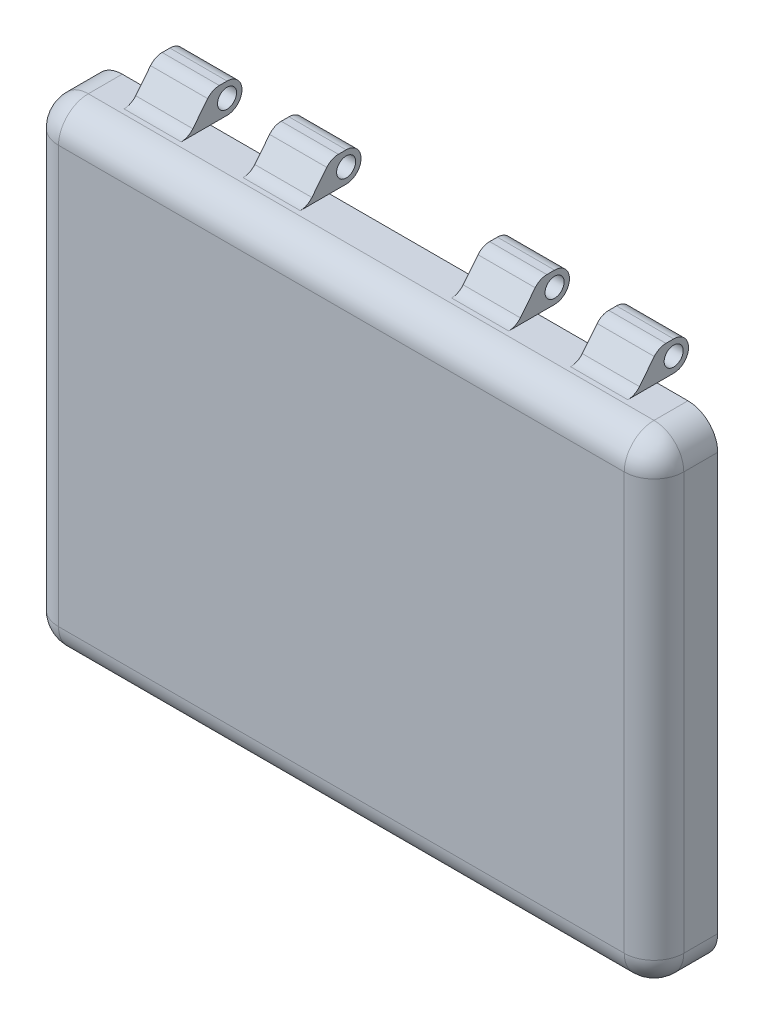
ISO-10303-21;
HEADER;
FILE_DESCRIPTION(('STEP AP214'),'2;1');
FILE_NAME('part.step','',(''),(''),'','','');
FILE_SCHEMA(('AUTOMOTIVE_DESIGN { 1 0 10303 214 1 1 1 1 }'));
ENDSEC;
DATA;
#1=APPLICATION_CONTEXT('core data for automotive mechanical design processes');
#2=APPLICATION_PROTOCOL_DEFINITION('international standard','automotive_design',2000,#1);
#3=PRODUCT_CONTEXT('',#1,'mechanical');
#4=PRODUCT('Part','Part','',(#3));
#5=PRODUCT_RELATED_PRODUCT_CATEGORY('part','',(#4));
#6=PRODUCT_DEFINITION_FORMATION('','',#4);
#7=PRODUCT_DEFINITION_CONTEXT('part definition',#1,'design');
#8=PRODUCT_DEFINITION('design','',#6,#7);
#9=PRODUCT_DEFINITION_SHAPE('','',#8);
#10=(LENGTH_UNIT() NAMED_UNIT(*) SI_UNIT(.MILLI.,.METRE.));
#11=(NAMED_UNIT(*) PLANE_ANGLE_UNIT() SI_UNIT($,.RADIAN.));
#12=(NAMED_UNIT(*) SI_UNIT($,.STERADIAN.) SOLID_ANGLE_UNIT());
#13=UNCERTAINTY_MEASURE_WITH_UNIT(LENGTH_MEASURE(1.E-05),#10,'distance_accuracy_value','');
#14=(GEOMETRIC_REPRESENTATION_CONTEXT(3) GLOBAL_UNCERTAINTY_ASSIGNED_CONTEXT((#13)) GLOBAL_UNIT_ASSIGNED_CONTEXT((#10,
#11,#12)) REPRESENTATION_CONTEXT('',''));
#15=CARTESIAN_POINT('',(0.,0.,0.));
#16=DIRECTION('',(0.,0.,1.));
#17=DIRECTION('',(1.,0.,0.));
#18=AXIS2_PLACEMENT_3D('',#15,#16,#17);
#19=CARTESIAN_POINT('',(-52.5,40.,11.));
#20=DIRECTION('',(0.,-1.,0.));
#21=DIRECTION('',(0.,0.,-1.));
#22=AXIS2_PLACEMENT_3D('',#19,#20,#21);
#23=PLANE('',#22);
#24=DIRECTION('',(1.,0.,0.));
#25=VECTOR('',#24,1.);
#26=CARTESIAN_POINT('',(-47.5,40.,0.3));
#27=LINE('',#26,#25);
#28=CARTESIAN_POINT('',(-47.5,40.,0.3));
#29=VERTEX_POINT('',#28);
#30=CARTESIAN_POINT('',(-42.3,40.,0.3));
#31=VERTEX_POINT('',#30);
#32=EDGE_CURVE('E1010',#29,#31,#27,.T.);
#33=ORIENTED_EDGE('',*,*,#32,.F.);
#34=DIRECTION('',(0.,0.,-1.));
#35=VECTOR('',#34,1.);
#36=CARTESIAN_POINT('',(-47.5,40.,11.));
#37=LINE('',#36,#35);
#38=CARTESIAN_POINT('',(-47.5,40.,6.));
#39=VERTEX_POINT('',#38);
#40=EDGE_CURVE('E975',#29,#39,#37,.F.);
#41=ORIENTED_EDGE('',*,*,#40,.T.);
#42=DIRECTION('',(-1.,0.,0.));
#43=VECTOR('',#42,1.);
#44=CARTESIAN_POINT('',(-52.5,40.,6.));
#45=LINE('',#44,#43);
#46=CARTESIAN_POINT('',(47.5,40.,6.));
#47=VERTEX_POINT('',#46);
#48=EDGE_CURVE('E639',#39,#47,#45,.F.);
#49=ORIENTED_EDGE('',*,*,#48,.T.);
#50=DIRECTION('',(0.,0.,-1.));
#51=VECTOR('',#50,1.);
#52=CARTESIAN_POINT('',(47.5,40.,11.));
#53=LINE('',#52,#51);
#54=CARTESIAN_POINT('',(47.5,40.,0.3));
#55=VERTEX_POINT('',#54);
#56=EDGE_CURVE('E632',#47,#55,#53,.T.);
#57=ORIENTED_EDGE('',*,*,#56,.T.);
#58=CARTESIAN_POINT('',(42.3,39.9999999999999,0.3));
#59=VERTEX_POINT('',#58);
#60=EDGE_CURVE('E611',#59,#55,#27,.T.);
#61=ORIENTED_EDGE('',*,*,#60,.F.);
#62=DIRECTION('',(0.,0.,1.));
#63=VECTOR('',#62,1.);
#64=CARTESIAN_POINT('',(42.3,40.,-5.));
#65=LINE('',#64,#63);
#66=CARTESIAN_POINT('',(42.3,40.,5.2015621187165));
#67=VERTEX_POINT('',#66);
#68=EDGE_CURVE('E1145',#59,#67,#65,.T.);
#69=ORIENTED_EDGE('',*,*,#68,.T.);
#70=DIRECTION('',(-1.,0.,0.));
#71=VECTOR('',#70,1.);
#72=CARTESIAN_POINT('',(-47.5,40.,5.2015621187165));
#73=LINE('',#72,#71);
#74=CARTESIAN_POINT('',(32.7,40.,5.2015621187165));
#75=VERTEX_POINT('',#74);
#76=EDGE_CURVE('E696',#67,#75,#73,.T.);
#77=ORIENTED_EDGE('',*,*,#76,.T.);
#78=DIRECTION('',(0.,0.,1.));
#79=VECTOR('',#78,1.);
#80=CARTESIAN_POINT('',(32.7,40.,-5.));
#81=LINE('',#80,#79);
#82=CARTESIAN_POINT('',(32.7,39.9999999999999,0.3));
#83=VERTEX_POINT('',#82);
#84=EDGE_CURVE('E1184',#83,#75,#81,.T.);
#85=ORIENTED_EDGE('',*,*,#84,.F.);
#86=CARTESIAN_POINT('',(22.3,39.9999999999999,0.3));
#87=VERTEX_POINT('',#86);
#88=EDGE_CURVE('E3260',#87,#83,#27,.T.);
#89=ORIENTED_EDGE('',*,*,#88,.F.);
#90=DIRECTION('',(0.,0.,1.));
#91=VECTOR('',#90,1.);
#92=CARTESIAN_POINT('',(22.3,40.,-5.));
#93=LINE('',#92,#91);
#94=CARTESIAN_POINT('',(22.3,40.,5.2015621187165));
#95=VERTEX_POINT('',#94);
#96=EDGE_CURVE('E1190',#87,#95,#93,.T.);
#97=ORIENTED_EDGE('',*,*,#96,.T.);
#98=CARTESIAN_POINT('',(12.7,40.,5.2015621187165));
#99=VERTEX_POINT('',#98);
#100=EDGE_CURVE('E3276',#95,#99,#73,.T.);
#101=ORIENTED_EDGE('',*,*,#100,.T.);
#102=DIRECTION('',(0.,0.,1.));
#103=VECTOR('',#102,1.);
#104=CARTESIAN_POINT('',(12.7,40.,-5.));
#105=LINE('',#104,#103);
#106=CARTESIAN_POINT('',(12.7,39.9999999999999,0.3));
#107=VERTEX_POINT('',#106);
#108=EDGE_CURVE('E1173',#107,#99,#105,.T.);
#109=ORIENTED_EDGE('',*,*,#108,.F.);
#110=CARTESIAN_POINT('',(-12.7,40.,0.3));
#111=VERTEX_POINT('',#110);
#112=EDGE_CURVE('E3251',#111,#107,#27,.T.);
#113=ORIENTED_EDGE('',*,*,#112,.F.);
#114=DIRECTION('',(0.,0.,1.));
#115=VECTOR('',#114,1.);
#116=CARTESIAN_POINT('',(-12.7,40.,-5.));
#117=LINE('',#116,#115);
#118=CARTESIAN_POINT('',(-12.7,40.,5.2015621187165));
#119=VERTEX_POINT('',#118);
#120=EDGE_CURVE('E1179',#111,#119,#117,.T.);
#121=ORIENTED_EDGE('',*,*,#120,.T.);
#122=CARTESIAN_POINT('',(-22.3,40.,5.2015621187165));
#123=VERTEX_POINT('',#122);
#124=EDGE_CURVE('E695',#119,#123,#73,.T.);
#125=ORIENTED_EDGE('',*,*,#124,.T.);
#126=DIRECTION('',(0.,0.,1.));
#127=VECTOR('',#126,1.);
#128=CARTESIAN_POINT('',(-22.3,40.,-5.));
#129=LINE('',#128,#127);
#130=CARTESIAN_POINT('',(-22.3,40.,0.3));
#131=VERTEX_POINT('',#130);
#132=EDGE_CURVE('E1155',#131,#123,#129,.T.);
#133=ORIENTED_EDGE('',*,*,#132,.F.);
#134=CARTESIAN_POINT('',(-32.7,40.,0.3));
#135=VERTEX_POINT('',#134);
#136=EDGE_CURVE('E3255',#135,#131,#27,.T.);
#137=ORIENTED_EDGE('',*,*,#136,.F.);
#138=DIRECTION('',(0.,0.,1.));
#139=VECTOR('',#138,1.);
#140=CARTESIAN_POINT('',(-32.7,40.,-5.));
#141=LINE('',#140,#139);
#142=CARTESIAN_POINT('',(-32.7,40.,5.2015621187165));
#143=VERTEX_POINT('',#142);
#144=EDGE_CURVE('E1160',#135,#143,#141,.T.);
#145=ORIENTED_EDGE('',*,*,#144,.T.);
#146=CARTESIAN_POINT('',(-42.3,40.,5.2015621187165));
#147=VERTEX_POINT('',#146);
#148=EDGE_CURVE('E645',#143,#147,#73,.T.);
#149=ORIENTED_EDGE('',*,*,#148,.T.);
#150=DIRECTION('',(0.,0.,1.));
#151=VECTOR('',#150,1.);
#152=CARTESIAN_POINT('',(-42.3,40.,-5.));
#153=LINE('',#152,#151);
#154=EDGE_CURVE('E1151',#31,#147,#153,.T.);
#155=ORIENTED_EDGE('',*,*,#154,.F.);
#156=EDGE_LOOP('',(#33,#41,#49,#57,#61,#69,#77,#85,#89,#97,#101,#109,#113,#121,#125,#133,#137,
#145,#149,#155));
#157=FACE_BOUND('',#156,.T.);
#158=ADVANCED_FACE('F45',(#157),#23,.F.);
#159=CARTESIAN_POINT('',(52.5,-40.,11.));
#160=DIRECTION('',(-1.,0.,0.));
#161=DIRECTION('',(0.,0.,1.));
#162=AXIS2_PLACEMENT_3D('',#159,#160,#161);
#163=PLANE('',#162);
#164=DIRECTION('',(0.,-1.,0.));
#165=VECTOR('',#164,1.);
#166=CARTESIAN_POINT('',(52.5,35.,0.3));
#167=LINE('',#166,#165);
#168=CARTESIAN_POINT('',(52.5,35.,0.3));
#169=VERTEX_POINT('',#168);
#170=CARTESIAN_POINT('',(52.5,-35.,0.3));
#171=VERTEX_POINT('',#170);
#172=EDGE_CURVE('E607',#169,#171,#167,.T.);
#173=ORIENTED_EDGE('',*,*,#172,.F.);
#174=DIRECTION('',(0.,0.,-1.));
#175=VECTOR('',#174,1.);
#176=CARTESIAN_POINT('',(52.5,35.,11.));
#177=LINE('',#176,#175);
#178=CARTESIAN_POINT('',(52.5,35.,6.));
#179=VERTEX_POINT('',#178);
#180=EDGE_CURVE('E620',#169,#179,#177,.F.);
#181=ORIENTED_EDGE('',*,*,#180,.T.);
#182=DIRECTION('',(0.,1.,0.));
#183=VECTOR('',#182,1.);
#184=CARTESIAN_POINT('',(52.5,-40.,6.));
#185=LINE('',#184,#183);
#186=CARTESIAN_POINT('',(52.5,-35.,6.));
#187=VERTEX_POINT('',#186);
#188=EDGE_CURVE('E631',#179,#187,#185,.F.);
#189=ORIENTED_EDGE('',*,*,#188,.T.);
#190=DIRECTION('',(0.,0.,-1.));
#191=VECTOR('',#190,1.);
#192=CARTESIAN_POINT('',(52.5,-35.,11.));
#193=LINE('',#192,#191);
#194=EDGE_CURVE('E623',#187,#171,#193,.T.);
#195=ORIENTED_EDGE('',*,*,#194,.T.);
#196=EDGE_LOOP('',(#173,#181,#189,#195));
#197=FACE_BOUND('',#196,.T.);
#198=ADVANCED_FACE('F619',(#197),#163,.F.);
#199=CARTESIAN_POINT('',(-52.5,-40.,11.));
#200=DIRECTION('',(1.,0.,0.));
#201=DIRECTION('',(0.,0.,-1.));
#202=AXIS2_PLACEMENT_3D('',#199,#200,#201);
#203=PLANE('',#202);
#204=DIRECTION('',(0.,1.,0.));
#205=VECTOR('',#204,1.);
#206=CARTESIAN_POINT('',(-52.5,-35.,0.3));
#207=LINE('',#206,#205);
#208=CARTESIAN_POINT('',(-52.5,-35.,0.3));
#209=VERTEX_POINT('',#208);
#210=CARTESIAN_POINT('',(-52.5,35.,0.3));
#211=VERTEX_POINT('',#210);
#212=EDGE_CURVE('E1006',#209,#211,#207,.T.);
#213=ORIENTED_EDGE('',*,*,#212,.F.);
#214=DIRECTION('',(0.,0.,-1.));
#215=VECTOR('',#214,1.);
#216=CARTESIAN_POINT('',(-52.5,-35.,11.));
#217=LINE('',#216,#215);
#218=CARTESIAN_POINT('',(-52.5,-35.,6.));
#219=VERTEX_POINT('',#218);
#220=EDGE_CURVE('E966',#209,#219,#217,.F.);
#221=ORIENTED_EDGE('',*,*,#220,.T.);
#222=DIRECTION('',(0.,-1.,0.));
#223=VECTOR('',#222,1.);
#224=CARTESIAN_POINT('',(-52.5,-40.,6.));
#225=LINE('',#224,#223);
#226=CARTESIAN_POINT('',(-52.5,35.,6.));
#227=VERTEX_POINT('',#226);
#228=EDGE_CURVE('E968',#219,#227,#225,.F.);
#229=ORIENTED_EDGE('',*,*,#228,.T.);
#230=DIRECTION('',(0.,0.,-1.));
#231=VECTOR('',#230,1.);
#232=CARTESIAN_POINT('',(-52.5,35.,11.));
#233=LINE('',#232,#231);
#234=EDGE_CURVE('E971',#227,#211,#233,.T.);
#235=ORIENTED_EDGE('',*,*,#234,.T.);
#236=EDGE_LOOP('',(#213,#221,#229,#235));
#237=FACE_BOUND('',#236,.T.);
#238=ADVANCED_FACE('F1558',(#237),#203,.F.);
#239=CARTESIAN_POINT('',(-52.5,-40.,11.));
#240=DIRECTION('',(0.,1.,0.));
#241=DIRECTION('',(0.,0.,1.));
#242=AXIS2_PLACEMENT_3D('',#239,#240,#241);
#243=PLANE('',#242);
#244=DIRECTION('',(-1.,0.,0.));
#245=VECTOR('',#244,1.);
#246=CARTESIAN_POINT('',(47.5,-40.,0.3));
#247=LINE('',#246,#245);
#248=CARTESIAN_POINT('',(47.5,-40.,0.3));
#249=VERTEX_POINT('',#248);
#250=CARTESIAN_POINT('',(-47.5,-40.,0.3));
#251=VERTEX_POINT('',#250);
#252=EDGE_CURVE('E1000',#249,#251,#247,.T.);
#253=ORIENTED_EDGE('',*,*,#252,.F.);
#254=DIRECTION('',(0.,0.,-1.));
#255=VECTOR('',#254,1.);
#256=CARTESIAN_POINT('',(47.5,-40.,11.));
#257=LINE('',#256,#255);
#258=CARTESIAN_POINT('',(47.5,-40.,6.));
#259=VERTEX_POINT('',#258);
#260=EDGE_CURVE('E963',#249,#259,#257,.F.);
#261=ORIENTED_EDGE('',*,*,#260,.T.);
#262=DIRECTION('',(1.,0.,0.));
#263=VECTOR('',#262,1.);
#264=CARTESIAN_POINT('',(-52.5,-40.,6.));
#265=LINE('',#264,#263);
#266=CARTESIAN_POINT('',(-47.5,-40.,6.));
#267=VERTEX_POINT('',#266);
#268=EDGE_CURVE('E959',#259,#267,#265,.F.);
#269=ORIENTED_EDGE('',*,*,#268,.T.);
#270=DIRECTION('',(0.,0.,-1.));
#271=VECTOR('',#270,1.);
#272=CARTESIAN_POINT('',(-47.5,-40.,11.));
#273=LINE('',#272,#271);
#274=EDGE_CURVE('E955',#267,#251,#273,.T.);
#275=ORIENTED_EDGE('',*,*,#274,.T.);
#276=EDGE_LOOP('',(#253,#261,#269,#275));
#277=FACE_BOUND('',#276,.T.);
#278=ADVANCED_FACE('F1603',(#277),#243,.F.);
#279=CARTESIAN_POINT('',(-47.5,35.,11.));
#280=DIRECTION('',(0.,0.,-1.));
#281=DIRECTION('',(-1.,0.,0.));
#282=AXIS2_PLACEMENT_3D('',#279,#280,#281);
#283=CYLINDRICAL_SURFACE('',#282,5.);
#284=ORIENTED_EDGE('',*,*,#40,.F.);
#285=CARTESIAN_POINT('',(-47.5,35.,0.3));
#286=DIRECTION('',(0.,0.,-1.));
#287=DIRECTION('',(-1.,0.,0.));
#288=AXIS2_PLACEMENT_3D('',#285,#286,#287);
#289=CIRCLE('',#288,5.);
#290=EDGE_CURVE('E1008',#211,#29,#289,.T.);
#291=ORIENTED_EDGE('',*,*,#290,.F.);
#292=ORIENTED_EDGE('',*,*,#234,.F.);
#293=CARTESIAN_POINT('',(-47.5,35.,6.));
#294=DIRECTION('',(0.,0.,1.));
#295=DIRECTION('',(1.,0.,0.));
#296=AXIS2_PLACEMENT_3D('',#293,#294,#295);
#297=CIRCLE('',#296,5.);
#298=EDGE_CURVE('E687',#39,#227,#297,.T.);
#299=ORIENTED_EDGE('',*,*,#298,.F.);
#300=EDGE_LOOP('',(#284,#291,#292,#299));
#301=FACE_BOUND('',#300,.T.);
#302=ADVANCED_FACE('F1597',(#301),#283,.T.);
#303=CARTESIAN_POINT('',(47.5,35.,11.));
#304=DIRECTION('',(0.,0.,-1.));
#305=DIRECTION('',(-1.,0.,0.));
#306=AXIS2_PLACEMENT_3D('',#303,#304,#305);
#307=CYLINDRICAL_SURFACE('',#306,5.);
#308=ORIENTED_EDGE('',*,*,#180,.F.);
#309=CARTESIAN_POINT('',(47.5,35.,0.3));
#310=DIRECTION('',(0.,0.,-1.));
#311=DIRECTION('',(-1.,0.,0.));
#312=AXIS2_PLACEMENT_3D('',#309,#310,#311);
#313=CIRCLE('',#312,4.99999999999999);
#314=EDGE_CURVE('E603',#55,#169,#313,.T.);
#315=ORIENTED_EDGE('',*,*,#314,.F.);
#316=ORIENTED_EDGE('',*,*,#56,.F.);
#317=CARTESIAN_POINT('',(47.5,35.,6.));
#318=DIRECTION('',(0.,0.,1.));
#319=DIRECTION('',(1.,0.,0.));
#320=AXIS2_PLACEMENT_3D('',#317,#318,#319);
#321=CIRCLE('',#320,5.);
#322=EDGE_CURVE('E628',#179,#47,#321,.T.);
#323=ORIENTED_EDGE('',*,*,#322,.F.);
#324=EDGE_LOOP('',(#308,#315,#316,#323));
#325=FACE_BOUND('',#324,.T.);
#326=ADVANCED_FACE('F626',(#325),#307,.T.);
#327=CARTESIAN_POINT('',(-47.5,-35.,11.));
#328=DIRECTION('',(0.,0.,-1.));
#329=DIRECTION('',(-1.,0.,0.));
#330=AXIS2_PLACEMENT_3D('',#327,#328,#329);
#331=CYLINDRICAL_SURFACE('',#330,5.);
#332=ORIENTED_EDGE('',*,*,#220,.F.);
#333=CARTESIAN_POINT('',(-47.5,-35.,0.3));
#334=DIRECTION('',(0.,0.,-1.));
#335=DIRECTION('',(-1.,0.,0.));
#336=AXIS2_PLACEMENT_3D('',#333,#334,#335);
#337=CIRCLE('',#336,5.);
#338=EDGE_CURVE('E1002',#251,#209,#337,.T.);
#339=ORIENTED_EDGE('',*,*,#338,.F.);
#340=ORIENTED_EDGE('',*,*,#274,.F.);
#341=CARTESIAN_POINT('',(-47.5,-35.,6.));
#342=DIRECTION('',(0.,0.,1.));
#343=DIRECTION('',(1.,0.,0.));
#344=AXIS2_PLACEMENT_3D('',#341,#342,#343);
#345=CIRCLE('',#344,5.);
#346=EDGE_CURVE('E665',#219,#267,#345,.T.);
#347=ORIENTED_EDGE('',*,*,#346,.F.);
#348=EDGE_LOOP('',(#332,#339,#340,#347));
#349=FACE_BOUND('',#348,.T.);
#350=ADVANCED_FACE('F1579',(#349),#331,.T.);
#351=CARTESIAN_POINT('',(47.5,-35.,11.));
#352=DIRECTION('',(0.,0.,-1.));
#353=DIRECTION('',(-1.,0.,0.));
#354=AXIS2_PLACEMENT_3D('',#351,#352,#353);
#355=CYLINDRICAL_SURFACE('',#354,5.);
#356=ORIENTED_EDGE('',*,*,#260,.F.);
#357=CARTESIAN_POINT('',(47.5,-35.,0.3));
#358=DIRECTION('',(0.,0.,-1.));
#359=DIRECTION('',(-1.,0.,0.));
#360=AXIS2_PLACEMENT_3D('',#357,#358,#359);
#361=CIRCLE('',#360,5.);
#362=EDGE_CURVE('E624',#171,#249,#361,.T.);
#363=ORIENTED_EDGE('',*,*,#362,.F.);
#364=ORIENTED_EDGE('',*,*,#194,.F.);
#365=CARTESIAN_POINT('',(47.5,-35.,6.));
#366=DIRECTION('',(0.,0.,1.));
#367=DIRECTION('',(1.,0.,0.));
#368=AXIS2_PLACEMENT_3D('',#365,#366,#367);
#369=CIRCLE('',#368,5.);
#370=EDGE_CURVE('E653',#259,#187,#369,.T.);
#371=ORIENTED_EDGE('',*,*,#370,.F.);
#372=EDGE_LOOP('',(#356,#363,#364,#371));
#373=FACE_BOUND('',#372,.T.);
#374=ADVANCED_FACE('F997',(#373),#355,.T.);
#375=CARTESIAN_POINT('',(0.,45.,0.));
#376=DIRECTION('',(0.,1.,0.));
#377=DIRECTION('',(0.,0.,1.));
#378=AXIS2_PLACEMENT_3D('',#375,#376,#377);
#379=PLANE('',#378);
#380=DIRECTION('',(1.,0.,0.));
#381=VECTOR('',#380,1.);
#382=CARTESIAN_POINT('',(0.,45.,-2.5));
#383=LINE('',#382,#381);
#384=CARTESIAN_POINT('',(-12.7,45.,-2.5));
#385=VERTEX_POINT('',#384);
#386=CARTESIAN_POINT('',(-22.3,45.,-2.5));
#387=VERTEX_POINT('',#386);
#388=EDGE_CURVE('E713',#385,#387,#383,.F.);
#389=ORIENTED_EDGE('',*,*,#388,.T.);
#390=DIRECTION('',(0.,0.,1.));
#391=VECTOR('',#390,1.);
#392=CARTESIAN_POINT('',(-22.3,45.,-5.));
#393=LINE('',#392,#391);
#394=CARTESIAN_POINT('',(-22.3,45.,-1.20156211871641));
#395=VERTEX_POINT('',#394);
#396=EDGE_CURVE('E1164',#387,#395,#393,.T.);
#397=ORIENTED_EDGE('',*,*,#396,.T.);
#398=DIRECTION('',(-1.,0.,0.));
#399=VECTOR('',#398,1.);
#400=CARTESIAN_POINT('',(47.5,45.,-1.20156211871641));
#401=LINE('',#400,#399);
#402=CARTESIAN_POINT('',(-12.7,45.,-1.20156211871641));
#403=VERTEX_POINT('',#402);
#404=EDGE_CURVE('E3168',#395,#403,#401,.F.);
#405=ORIENTED_EDGE('',*,*,#404,.T.);
#406=DIRECTION('',(0.,0.,1.));
#407=VECTOR('',#406,1.);
#408=CARTESIAN_POINT('',(-12.7,45.,-5.));
#409=LINE('',#408,#407);
#410=EDGE_CURVE('E1180',#385,#403,#409,.T.);
#411=ORIENTED_EDGE('',*,*,#410,.F.);
#412=EDGE_LOOP('',(#389,#397,#405,#411));
#413=FACE_BOUND('',#412,.T.);
#414=ADVANCED_FACE('F1578',(#413),#379,.T.);
#415=CARTESIAN_POINT('',(22.3,45.,-2.5));
#416=VERTEX_POINT('',#415);
#417=CARTESIAN_POINT('',(12.7,45.,-2.5));
#418=VERTEX_POINT('',#417);
#419=EDGE_CURVE('E3232',#416,#418,#383,.F.);
#420=ORIENTED_EDGE('',*,*,#419,.T.);
#421=DIRECTION('',(0.,0.,1.));
#422=VECTOR('',#421,1.);
#423=CARTESIAN_POINT('',(12.7,45.,-5.));
#424=LINE('',#423,#422);
#425=CARTESIAN_POINT('',(12.7,45.,-1.20156211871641));
#426=VERTEX_POINT('',#425);
#427=EDGE_CURVE('E1168',#418,#426,#424,.T.);
#428=ORIENTED_EDGE('',*,*,#427,.T.);
#429=CARTESIAN_POINT('',(22.3,45.,-1.20156211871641));
#430=VERTEX_POINT('',#429);
#431=EDGE_CURVE('E719',#426,#430,#401,.F.);
#432=ORIENTED_EDGE('',*,*,#431,.T.);
#433=DIRECTION('',(0.,0.,1.));
#434=VECTOR('',#433,1.);
#435=CARTESIAN_POINT('',(22.3,45.,-5.));
#436=LINE('',#435,#434);
#437=EDGE_CURVE('E1191',#416,#430,#436,.T.);
#438=ORIENTED_EDGE('',*,*,#437,.F.);
#439=EDGE_LOOP('',(#420,#428,#432,#438));
#440=FACE_BOUND('',#439,.T.);
#441=ADVANCED_FACE('F2938',(#440),#379,.T.);
#442=CARTESIAN_POINT('',(42.3,45.,-2.5));
#443=VERTEX_POINT('',#442);
#444=CARTESIAN_POINT('',(32.7,45.,-2.5));
#445=VERTEX_POINT('',#444);
#446=EDGE_CURVE('E714',#443,#445,#383,.F.);
#447=ORIENTED_EDGE('',*,*,#446,.T.);
#448=DIRECTION('',(0.,0.,1.));
#449=VECTOR('',#448,1.);
#450=CARTESIAN_POINT('',(32.7,45.,-5.));
#451=LINE('',#450,#449);
#452=CARTESIAN_POINT('',(32.7,45.,-1.20156211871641));
#453=VERTEX_POINT('',#452);
#454=EDGE_CURVE('E1194',#445,#453,#451,.T.);
#455=ORIENTED_EDGE('',*,*,#454,.T.);
#456=CARTESIAN_POINT('',(42.3,45.,-1.20156211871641));
#457=VERTEX_POINT('',#456);
#458=EDGE_CURVE('E715',#453,#457,#401,.F.);
#459=ORIENTED_EDGE('',*,*,#458,.T.);
#460=DIRECTION('',(0.,0.,1.));
#461=VECTOR('',#460,1.);
#462=CARTESIAN_POINT('',(42.3,45.,-5.));
#463=LINE('',#462,#461);
#464=EDGE_CURVE('E1198',#443,#457,#463,.T.);
#465=ORIENTED_EDGE('',*,*,#464,.F.);
#466=EDGE_LOOP('',(#447,#455,#459,#465));
#467=FACE_BOUND('',#466,.T.);
#468=ADVANCED_FACE('F2951',(#467),#379,.T.);
#469=DIRECTION('',(0.,0.,1.));
#470=VECTOR('',#469,1.);
#471=CARTESIAN_POINT('',(-42.3,45.,-5.));
#472=LINE('',#471,#470);
#473=CARTESIAN_POINT('',(-42.3,45.,-2.5));
#474=VERTEX_POINT('',#473);
#475=CARTESIAN_POINT('',(-42.3,45.,-1.20156211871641));
#476=VERTEX_POINT('',#475);
#477=EDGE_CURVE('E1146',#474,#476,#472,.T.);
#478=ORIENTED_EDGE('',*,*,#477,.T.);
#479=CARTESIAN_POINT('',(-32.7,45.,-1.20156211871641));
#480=VERTEX_POINT('',#479);
#481=EDGE_CURVE('E720',#476,#480,#401,.F.);
#482=ORIENTED_EDGE('',*,*,#481,.T.);
#483=DIRECTION('',(0.,0.,1.));
#484=VECTOR('',#483,1.);
#485=CARTESIAN_POINT('',(-32.7,45.,-5.));
#486=LINE('',#485,#484);
#487=CARTESIAN_POINT('',(-32.7,45.,-2.5));
#488=VERTEX_POINT('',#487);
#489=EDGE_CURVE('E1161',#488,#480,#486,.T.);
#490=ORIENTED_EDGE('',*,*,#489,.F.);
#491=EDGE_CURVE('E709',#488,#474,#383,.F.);
#492=ORIENTED_EDGE('',*,*,#491,.T.);
#493=EDGE_LOOP('',(#478,#482,#490,#492));
#494=FACE_BOUND('',#493,.T.);
#495=ADVANCED_FACE('F1950',(#494),#379,.T.);
#496=CARTESIAN_POINT('',(0.,40.,0.));
#497=DIRECTION('',(0.,1.,0.));
#498=DIRECTION('',(0.,0.,1.));
#499=AXIS2_PLACEMENT_3D('',#496,#497,#498);
#500=PLANE('',#499);
#501=CARTESIAN_POINT('',(-22.3,40.,-2.5));
#502=VERTEX_POINT('',#501);
#503=EDGE_CURVE('E1154',#502,#131,#129,.T.);
#504=ORIENTED_EDGE('',*,*,#503,.F.);
#505=DIRECTION('',(1.,0.,0.));
#506=VECTOR('',#505,1.);
#507=CARTESIAN_POINT('',(47.5,40.,-2.5));
#508=LINE('',#507,#506);
#509=CARTESIAN_POINT('',(-12.7,40.,-2.5));
#510=VERTEX_POINT('',#509);
#511=EDGE_CURVE('E3215',#502,#510,#508,.T.);
#512=ORIENTED_EDGE('',*,*,#511,.T.);
#513=EDGE_CURVE('E1176',#510,#111,#117,.T.);
#514=ORIENTED_EDGE('',*,*,#513,.T.);
#515=EDGE_CURVE('E3247',#131,#111,#27,.T.);
#516=ORIENTED_EDGE('',*,*,#515,.F.);
#517=EDGE_LOOP('',(#504,#512,#514,#516));
#518=FACE_BOUND('',#517,.T.);
#519=ADVANCED_FACE('F1921',(#518),#500,.F.);
#520=CARTESIAN_POINT('',(12.7,40.,-2.5));
#521=VERTEX_POINT('',#520);
#522=EDGE_CURVE('E1172',#521,#107,#105,.T.);
#523=ORIENTED_EDGE('',*,*,#522,.F.);
#524=CARTESIAN_POINT('',(22.3,40.,-2.5));
#525=VERTEX_POINT('',#524);
#526=EDGE_CURVE('E725',#521,#525,#508,.T.);
#527=ORIENTED_EDGE('',*,*,#526,.T.);
#528=EDGE_CURVE('E1187',#525,#87,#93,.T.);
#529=ORIENTED_EDGE('',*,*,#528,.T.);
#530=EDGE_CURVE('E3259',#107,#87,#27,.T.);
#531=ORIENTED_EDGE('',*,*,#530,.F.);
#532=EDGE_LOOP('',(#523,#527,#529,#531));
#533=FACE_BOUND('',#532,.T.);
#534=ADVANCED_FACE('F1930',(#533),#500,.F.);
#535=CARTESIAN_POINT('',(32.7,40.,-2.5));
#536=VERTEX_POINT('',#535);
#537=EDGE_CURVE('E1183',#536,#83,#81,.T.);
#538=ORIENTED_EDGE('',*,*,#537,.F.);
#539=CARTESIAN_POINT('',(42.3,40.,-2.5));
#540=VERTEX_POINT('',#539);
#541=EDGE_CURVE('E721',#536,#540,#508,.T.);
#542=ORIENTED_EDGE('',*,*,#541,.T.);
#543=EDGE_CURVE('E1201',#540,#59,#65,.T.);
#544=ORIENTED_EDGE('',*,*,#543,.T.);
#545=EDGE_CURVE('E3263',#83,#59,#27,.T.);
#546=ORIENTED_EDGE('',*,*,#545,.F.);
#547=EDGE_LOOP('',(#538,#542,#544,#546));
#548=FACE_BOUND('',#547,.T.);
#549=ADVANCED_FACE('F1918',(#548),#500,.F.);
#550=CARTESIAN_POINT('',(-42.3,40.,-2.5));
#551=VERTEX_POINT('',#550);
#552=CARTESIAN_POINT('',(-32.7,40.,-2.5));
#553=VERTEX_POINT('',#552);
#554=EDGE_CURVE('E726',#551,#553,#508,.T.);
#555=ORIENTED_EDGE('',*,*,#554,.T.);
#556=EDGE_CURVE('E1158',#553,#135,#141,.T.);
#557=ORIENTED_EDGE('',*,*,#556,.T.);
#558=EDGE_CURVE('E1012',#31,#135,#27,.T.);
#559=ORIENTED_EDGE('',*,*,#558,.F.);
#560=EDGE_CURVE('E62',#551,#31,#153,.T.);
#561=ORIENTED_EDGE('',*,*,#560,.F.);
#562=EDGE_LOOP('',(#555,#557,#559,#561));
#563=FACE_BOUND('',#562,.T.);
#564=ADVANCED_FACE('F1914',(#563),#500,.F.);
#565=CARTESIAN_POINT('',(52.5,17.5609756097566,21.9512195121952));
#566=DIRECTION('',(0.,-0.624695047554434,-0.780868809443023));
#567=DIRECTION('',(0.,0.780868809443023,-0.624695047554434));
#568=AXIS2_PLACEMENT_3D('',#565,#566,#567);
#569=PLANE('',#568);
#570=DIRECTION('',(0.,0.780868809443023,-0.624695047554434));
#571=VECTOR('',#570,1.);
#572=CARTESIAN_POINT('',(-22.3,17.5609756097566,21.9512195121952));
#573=LINE('',#572,#571);
#574=CARTESIAN_POINT('',(-22.3,40.9382623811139,3.24939009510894));
#575=VERTEX_POINT('',#574);
#576=CARTESIAN_POINT('',(-22.3,44.0617376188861,0.750609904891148));
#577=VERTEX_POINT('',#576);
#578=EDGE_CURVE('E1320',#575,#577,#573,.T.);
#579=ORIENTED_EDGE('',*,*,#578,.F.);
#580=DIRECTION('',(-1.,0.,0.));
#581=VECTOR('',#580,1.);
#582=CARTESIAN_POINT('',(47.5,40.9382623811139,3.24939009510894));
#583=LINE('',#582,#581);
#584=CARTESIAN_POINT('',(-12.7,40.9382623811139,3.24939009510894));
#585=VERTEX_POINT('',#584);
#586=EDGE_CURVE('E3191',#575,#585,#583,.F.);
#587=ORIENTED_EDGE('',*,*,#586,.T.);
#588=DIRECTION('',(0.,0.780868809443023,-0.624695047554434));
#589=VECTOR('',#588,1.);
#590=CARTESIAN_POINT('',(-12.7,17.5609756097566,21.9512195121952));
#591=LINE('',#590,#589);
#592=CARTESIAN_POINT('',(-12.7,44.0617376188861,0.750609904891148));
#593=VERTEX_POINT('',#592);
#594=EDGE_CURVE('E1264',#585,#593,#591,.T.);
#595=ORIENTED_EDGE('',*,*,#594,.T.);
#596=DIRECTION('',(-1.,0.,0.));
#597=VECTOR('',#596,1.);
#598=CARTESIAN_POINT('',(-47.5,44.0617376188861,0.750609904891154));
#599=LINE('',#598,#597);
#600=EDGE_CURVE('E701',#593,#577,#599,.T.);
#601=ORIENTED_EDGE('',*,*,#600,.T.);
#602=EDGE_LOOP('',(#579,#587,#595,#601));
#603=FACE_BOUND('',#602,.T.);
#604=ADVANCED_FACE('F1917',(#603),#569,.F.);
#605=DIRECTION('',(0.,0.780868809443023,-0.624695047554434));
#606=VECTOR('',#605,1.);
#607=CARTESIAN_POINT('',(12.7000000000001,17.5609756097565,21.9512195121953));
#608=LINE('',#607,#606);
#609=CARTESIAN_POINT('',(12.7,40.9382623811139,3.24939009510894));
#610=VERTEX_POINT('',#609);
#611=CARTESIAN_POINT('',(12.7,44.0617376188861,0.750609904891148));
#612=VERTEX_POINT('',#611);
#613=EDGE_CURVE('E1284',#610,#612,#608,.T.);
#614=ORIENTED_EDGE('',*,*,#613,.F.);
#615=CARTESIAN_POINT('',(22.3,40.9382623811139,3.24939009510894));
#616=VERTEX_POINT('',#615);
#617=EDGE_CURVE('E707',#610,#616,#583,.F.);
#618=ORIENTED_EDGE('',*,*,#617,.T.);
#619=DIRECTION('',(0.,0.780868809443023,-0.624695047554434));
#620=VECTOR('',#619,1.);
#621=CARTESIAN_POINT('',(22.3000000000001,17.5609756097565,21.9512195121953));
#622=LINE('',#621,#620);
#623=CARTESIAN_POINT('',(22.3,44.0617376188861,0.750609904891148));
#624=VERTEX_POINT('',#623);
#625=EDGE_CURVE('E1228',#616,#624,#622,.T.);
#626=ORIENTED_EDGE('',*,*,#625,.T.);
#627=EDGE_CURVE('E3183',#624,#612,#599,.T.);
#628=ORIENTED_EDGE('',*,*,#627,.T.);
#629=EDGE_LOOP('',(#614,#618,#626,#628));
#630=FACE_BOUND('',#629,.T.);
#631=ADVANCED_FACE('F2064',(#630),#569,.F.);
#632=DIRECTION('',(0.,0.780868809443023,-0.624695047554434));
#633=VECTOR('',#632,1.);
#634=CARTESIAN_POINT('',(32.7000000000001,17.5609756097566,21.9512195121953));
#635=LINE('',#634,#633);
#636=CARTESIAN_POINT('',(32.7,40.9382623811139,3.24939009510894));
#637=VERTEX_POINT('',#636);
#638=CARTESIAN_POINT('',(32.7,44.0617376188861,0.750609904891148));
#639=VERTEX_POINT('',#638);
#640=EDGE_CURVE('E1248',#637,#639,#635,.T.);
#641=ORIENTED_EDGE('',*,*,#640,.F.);
#642=CARTESIAN_POINT('',(42.3,40.9382623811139,3.24939009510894));
#643=VERTEX_POINT('',#642);
#644=EDGE_CURVE('E703',#637,#643,#583,.F.);
#645=ORIENTED_EDGE('',*,*,#644,.T.);
#646=DIRECTION('',(0.,-0.780868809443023,0.624695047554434));
#647=VECTOR('',#646,1.);
#648=CARTESIAN_POINT('',(42.3000000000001,17.5609756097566,21.9512195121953));
#649=LINE('',#648,#647);
#650=CARTESIAN_POINT('',(42.3,44.0617376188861,0.750609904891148));
#651=VERTEX_POINT('',#650);
#652=EDGE_CURVE('E1211',#651,#643,#649,.T.);
#653=ORIENTED_EDGE('',*,*,#652,.F.);
#654=EDGE_CURVE('E702',#651,#639,#599,.T.);
#655=ORIENTED_EDGE('',*,*,#654,.T.);
#656=EDGE_LOOP('',(#641,#645,#653,#655));
#657=FACE_BOUND('',#656,.T.);
#658=ADVANCED_FACE('F2072',(#657),#569,.F.);
#659=CARTESIAN_POINT('',(-32.7,44.0617376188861,0.750609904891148));
#660=VERTEX_POINT('',#659);
#661=CARTESIAN_POINT('',(-42.3,44.0617376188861,0.750609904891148));
#662=VERTEX_POINT('',#661);
#663=EDGE_CURVE('E697',#660,#662,#599,.T.);
#664=ORIENTED_EDGE('',*,*,#663,.T.);
#665=DIRECTION('',(0.,-0.780868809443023,0.624695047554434));
#666=VECTOR('',#665,1.);
#667=CARTESIAN_POINT('',(-42.3,17.5609756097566,21.9512195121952));
#668=LINE('',#667,#666);
#669=CARTESIAN_POINT('',(-42.3,40.9382623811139,3.24939009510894));
#670=VERTEX_POINT('',#669);
#671=EDGE_CURVE('E1336',#662,#670,#668,.T.);
#672=ORIENTED_EDGE('',*,*,#671,.T.);
#673=CARTESIAN_POINT('',(-32.7,40.9382623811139,3.24939009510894));
#674=VERTEX_POINT('',#673);
#675=EDGE_CURVE('E708',#670,#674,#583,.F.);
#676=ORIENTED_EDGE('',*,*,#675,.T.);
#677=DIRECTION('',(0.,0.780868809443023,-0.624695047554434));
#678=VECTOR('',#677,1.);
#679=CARTESIAN_POINT('',(-32.7,17.5609756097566,21.9512195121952));
#680=LINE('',#679,#678);
#681=EDGE_CURVE('E1300',#674,#660,#680,.T.);
#682=ORIENTED_EDGE('',*,*,#681,.T.);
#683=EDGE_LOOP('',(#664,#672,#676,#682));
#684=FACE_BOUND('',#683,.T.);
#685=ADVANCED_FACE('F1609',(#684),#569,.F.);
#686=CARTESIAN_POINT('',(-52.5,42.5,5.2015621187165));
#687=DIRECTION('',(1.,0.,0.));
#688=DIRECTION('',(0.,0.,-1.));
#689=AXIS2_PLACEMENT_3D('',#686,#687,#688);
#690=CYLINDRICAL_SURFACE('',#689,2.5);
#691=CARTESIAN_POINT('',(-22.3,42.5,5.2015621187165));
#692=DIRECTION('',(-1.,0.,0.));
#693=DIRECTION('',(0.,0.,1.));
#694=AXIS2_PLACEMENT_3D('',#691,#692,#693);
#695=CIRCLE('',#694,2.5);
#696=EDGE_CURVE('E1323',#123,#575,#695,.F.);
#697=ORIENTED_EDGE('',*,*,#696,.F.);
#698=ORIENTED_EDGE('',*,*,#124,.F.);
#699=CARTESIAN_POINT('',(-12.7,42.5,5.2015621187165));
#700=DIRECTION('',(-1.,0.,0.));
#701=DIRECTION('',(0.,0.,1.));
#702=AXIS2_PLACEMENT_3D('',#699,#700,#701);
#703=CIRCLE('',#702,2.5);
#704=EDGE_CURVE('E1268',#119,#585,#703,.F.);
#705=ORIENTED_EDGE('',*,*,#704,.T.);
#706=ORIENTED_EDGE('',*,*,#586,.F.);
#707=EDGE_LOOP('',(#697,#698,#705,#706));
#708=FACE_BOUND('',#707,.T.);
#709=ADVANCED_FACE('F1605',(#708),#690,.F.);
#710=CARTESIAN_POINT('',(12.7,42.5,5.2015621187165));
#711=DIRECTION('',(-1.,0.,0.));
#712=DIRECTION('',(0.,-1.,0.));
#713=AXIS2_PLACEMENT_3D('',#710,#711,#712);
#714=CIRCLE('',#713,2.5);
#715=EDGE_CURVE('E1287',#99,#610,#714,.F.);
#716=ORIENTED_EDGE('',*,*,#715,.F.);
#717=ORIENTED_EDGE('',*,*,#100,.F.);
#718=CARTESIAN_POINT('',(22.3,42.5,5.2015621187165));
#719=DIRECTION('',(-1.,0.,0.));
#720=DIRECTION('',(0.,-1.,0.));
#721=AXIS2_PLACEMENT_3D('',#718,#719,#720);
#722=CIRCLE('',#721,2.5);
#723=EDGE_CURVE('E1232',#95,#616,#722,.F.);
#724=ORIENTED_EDGE('',*,*,#723,.T.);
#725=ORIENTED_EDGE('',*,*,#617,.F.);
#726=EDGE_LOOP('',(#716,#717,#724,#725));
#727=FACE_BOUND('',#726,.T.);
#728=ADVANCED_FACE('F1608',(#727),#690,.F.);
#729=CARTESIAN_POINT('',(32.7,42.5,5.2015621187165));
#730=DIRECTION('',(-1.,0.,0.));
#731=DIRECTION('',(0.,-1.,0.));
#732=AXIS2_PLACEMENT_3D('',#729,#730,#731);
#733=CIRCLE('',#732,2.5);
#734=EDGE_CURVE('E1251',#75,#637,#733,.F.);
#735=ORIENTED_EDGE('',*,*,#734,.F.);
#736=ORIENTED_EDGE('',*,*,#76,.F.);
#737=CARTESIAN_POINT('',(42.3,42.5,5.2015621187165));
#738=DIRECTION('',(1.,0.,0.));
#739=DIRECTION('',(0.,1.,0.));
#740=AXIS2_PLACEMENT_3D('',#737,#738,#739);
#741=CIRCLE('',#740,2.5);
#742=EDGE_CURVE('E1214',#643,#67,#741,.F.);
#743=ORIENTED_EDGE('',*,*,#742,.F.);
#744=ORIENTED_EDGE('',*,*,#644,.F.);
#745=EDGE_LOOP('',(#735,#736,#743,#744));
#746=FACE_BOUND('',#745,.T.);
#747=ADVANCED_FACE('F2099',(#746),#690,.F.);
#748=ORIENTED_EDGE('',*,*,#675,.F.);
#749=CARTESIAN_POINT('',(-42.3,42.5,5.2015621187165));
#750=DIRECTION('',(1.,0.,0.));
#751=DIRECTION('',(0.,0.,-1.));
#752=AXIS2_PLACEMENT_3D('',#749,#750,#751);
#753=CIRCLE('',#752,2.5);
#754=EDGE_CURVE('E1340',#670,#147,#753,.F.);
#755=ORIENTED_EDGE('',*,*,#754,.T.);
#756=ORIENTED_EDGE('',*,*,#148,.F.);
#757=CARTESIAN_POINT('',(-32.7,42.5,5.2015621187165));
#758=DIRECTION('',(-1.,0.,0.));
#759=DIRECTION('',(0.,0.,1.));
#760=AXIS2_PLACEMENT_3D('',#757,#758,#759);
#761=CIRCLE('',#760,2.5);
#762=EDGE_CURVE('E1304',#143,#674,#761,.F.);
#763=ORIENTED_EDGE('',*,*,#762,.T.);
#764=EDGE_LOOP('',(#748,#755,#756,#763));
#765=FACE_BOUND('',#764,.T.);
#766=ADVANCED_FACE('F1611',(#765),#690,.F.);
#767=CARTESIAN_POINT('',(52.5,42.5,-1.20156211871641));
#768=DIRECTION('',(1.,0.,0.));
#769=DIRECTION('',(0.,0.,-1.));
#770=AXIS2_PLACEMENT_3D('',#767,#768,#769);
#771=CYLINDRICAL_SURFACE('',#770,2.5);
#772=ORIENTED_EDGE('',*,*,#404,.F.);
#773=CARTESIAN_POINT('',(-22.3,42.5,-1.20156211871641));
#774=DIRECTION('',(-1.,0.,0.));
#775=DIRECTION('',(0.,0.,1.));
#776=AXIS2_PLACEMENT_3D('',#773,#774,#775);
#777=CIRCLE('',#776,2.5);
#778=EDGE_CURVE('E1316',#395,#577,#777,.F.);
#779=ORIENTED_EDGE('',*,*,#778,.T.);
#780=ORIENTED_EDGE('',*,*,#600,.F.);
#781=CARTESIAN_POINT('',(-12.7,42.5,-1.20156211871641));
#782=DIRECTION('',(-1.,0.,0.));
#783=DIRECTION('',(0.,0.,1.));
#784=AXIS2_PLACEMENT_3D('',#781,#782,#783);
#785=CIRCLE('',#784,2.5);
#786=EDGE_CURVE('E1261',#403,#593,#785,.F.);
#787=ORIENTED_EDGE('',*,*,#786,.F.);
#788=EDGE_LOOP('',(#772,#779,#780,#787));
#789=FACE_BOUND('',#788,.T.);
#790=ADVANCED_FACE('F1612',(#789),#771,.T.);
#791=ORIENTED_EDGE('',*,*,#431,.F.);
#792=CARTESIAN_POINT('',(12.7,42.5,-1.20156211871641));
#793=DIRECTION('',(-1.,0.,0.));
#794=DIRECTION('',(0.,-1.,0.));
#795=AXIS2_PLACEMENT_3D('',#792,#793,#794);
#796=CIRCLE('',#795,2.5);
#797=EDGE_CURVE('E1280',#426,#612,#796,.F.);
#798=ORIENTED_EDGE('',*,*,#797,.T.);
#799=ORIENTED_EDGE('',*,*,#627,.F.);
#800=CARTESIAN_POINT('',(22.3,42.5,-1.20156211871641));
#801=DIRECTION('',(-1.,0.,0.));
#802=DIRECTION('',(0.,-1.,0.));
#803=AXIS2_PLACEMENT_3D('',#800,#801,#802);
#804=CIRCLE('',#803,2.5);
#805=EDGE_CURVE('E1225',#430,#624,#804,.F.);
#806=ORIENTED_EDGE('',*,*,#805,.F.);
#807=EDGE_LOOP('',(#791,#798,#799,#806));
#808=FACE_BOUND('',#807,.T.);
#809=ADVANCED_FACE('F1615',(#808),#771,.T.);
#810=ORIENTED_EDGE('',*,*,#458,.F.);
#811=CARTESIAN_POINT('',(32.7,42.5,-1.20156211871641));
#812=DIRECTION('',(-1.,0.,0.));
#813=DIRECTION('',(0.,-1.,0.));
#814=AXIS2_PLACEMENT_3D('',#811,#812,#813);
#815=CIRCLE('',#814,2.5);
#816=EDGE_CURVE('E1244',#453,#639,#815,.F.);
#817=ORIENTED_EDGE('',*,*,#816,.T.);
#818=ORIENTED_EDGE('',*,*,#654,.F.);
#819=CARTESIAN_POINT('',(42.3,42.5,-1.20156211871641));
#820=DIRECTION('',(1.,0.,0.));
#821=DIRECTION('',(0.,1.,0.));
#822=AXIS2_PLACEMENT_3D('',#819,#820,#821);
#823=CIRCLE('',#822,2.5);
#824=EDGE_CURVE('E1207',#651,#457,#823,.F.);
#825=ORIENTED_EDGE('',*,*,#824,.T.);
#826=EDGE_LOOP('',(#810,#817,#818,#825));
#827=FACE_BOUND('',#826,.T.);
#828=ADVANCED_FACE('F2126',(#827),#771,.T.);
#829=CARTESIAN_POINT('',(-42.3,42.5,-1.20156211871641));
#830=DIRECTION('',(1.,0.,0.));
#831=DIRECTION('',(0.,0.,-1.));
#832=AXIS2_PLACEMENT_3D('',#829,#830,#831);
#833=CIRCLE('',#832,2.5);
#834=EDGE_CURVE('E1333',#662,#476,#833,.F.);
#835=ORIENTED_EDGE('',*,*,#834,.F.);
#836=ORIENTED_EDGE('',*,*,#663,.F.);
#837=CARTESIAN_POINT('',(-32.7,42.5,-1.20156211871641));
#838=DIRECTION('',(-1.,0.,0.));
#839=DIRECTION('',(0.,0.,1.));
#840=AXIS2_PLACEMENT_3D('',#837,#838,#839);
#841=CIRCLE('',#840,2.5);
#842=EDGE_CURVE('E1297',#480,#660,#841,.F.);
#843=ORIENTED_EDGE('',*,*,#842,.F.);
#844=ORIENTED_EDGE('',*,*,#481,.F.);
#845=EDGE_LOOP('',(#835,#836,#843,#844));
#846=FACE_BOUND('',#845,.T.);
#847=ADVANCED_FACE('F1617',(#846),#771,.T.);
#848=CARTESIAN_POINT('',(0.,42.5,-2.5));
#849=DIRECTION('',(-1.,0.,0.));
#850=DIRECTION('',(0.,0.,1.));
#851=AXIS2_PLACEMENT_3D('',#848,#849,#850);
#852=CYLINDRICAL_SURFACE('',#851,2.5);
#853=ORIENTED_EDGE('',*,*,#511,.F.);
#854=CARTESIAN_POINT('',(-22.3,42.5,-2.5));
#855=DIRECTION('',(-1.,0.,0.));
#856=DIRECTION('',(0.,0.,1.));
#857=AXIS2_PLACEMENT_3D('',#854,#855,#856);
#858=CIRCLE('',#857,2.5);
#859=CARTESIAN_POINT('',(-22.3,42.5,-5.));
#860=VERTEX_POINT('',#859);
#861=EDGE_CURVE('E1312',#502,#860,#858,.F.);
#862=ORIENTED_EDGE('',*,*,#861,.T.);
#863=DIRECTION('',(1.,0.,0.));
#864=VECTOR('',#863,1.);
#865=CARTESIAN_POINT('',(-47.5,42.5,-5.));
#866=LINE('',#865,#864);
#867=CARTESIAN_POINT('',(-12.7,42.5,-5.));
#868=VERTEX_POINT('',#867);
#869=EDGE_CURVE('E731',#868,#860,#866,.F.);
#870=ORIENTED_EDGE('',*,*,#869,.F.);
#871=CARTESIAN_POINT('',(-12.7,42.5,-2.5));
#872=DIRECTION('',(-1.,0.,0.));
#873=DIRECTION('',(0.,0.,1.));
#874=AXIS2_PLACEMENT_3D('',#871,#872,#873);
#875=CIRCLE('',#874,2.5);
#876=EDGE_CURVE('E1258',#510,#868,#875,.F.);
#877=ORIENTED_EDGE('',*,*,#876,.F.);
#878=EDGE_LOOP('',(#853,#862,#870,#877));
#879=FACE_BOUND('',#878,.T.);
#880=ADVANCED_FACE('F1625',(#879),#852,.T.);
#881=ORIENTED_EDGE('',*,*,#526,.F.);
#882=CARTESIAN_POINT('',(12.7,42.5,-2.5));
#883=DIRECTION('',(-1.,0.,0.));
#884=DIRECTION('',(0.,-1.,0.));
#885=AXIS2_PLACEMENT_3D('',#882,#883,#884);
#886=CIRCLE('',#885,2.5);
#887=CARTESIAN_POINT('',(12.7,42.5,-5.));
#888=VERTEX_POINT('',#887);
#889=EDGE_CURVE('E1276',#521,#888,#886,.F.);
#890=ORIENTED_EDGE('',*,*,#889,.T.);
#891=CARTESIAN_POINT('',(22.3,42.5,-5.));
#892=VERTEX_POINT('',#891);
#893=EDGE_CURVE('E3229',#892,#888,#866,.F.);
#894=ORIENTED_EDGE('',*,*,#893,.F.);
#895=CARTESIAN_POINT('',(22.3,42.5,-2.5));
#896=DIRECTION('',(-1.,0.,0.));
#897=DIRECTION('',(0.,-1.,0.));
#898=AXIS2_PLACEMENT_3D('',#895,#896,#897);
#899=CIRCLE('',#898,2.5);
#900=EDGE_CURVE('E1222',#525,#892,#899,.F.);
#901=ORIENTED_EDGE('',*,*,#900,.F.);
#902=EDGE_LOOP('',(#881,#890,#894,#901));
#903=FACE_BOUND('',#902,.T.);
#904=ADVANCED_FACE('F1628',(#903),#852,.T.);
#905=ORIENTED_EDGE('',*,*,#541,.F.);
#906=CARTESIAN_POINT('',(32.7,42.5,-2.5));
#907=DIRECTION('',(-1.,0.,0.));
#908=DIRECTION('',(0.,-1.,0.));
#909=AXIS2_PLACEMENT_3D('',#906,#907,#908);
#910=CIRCLE('',#909,2.5);
#911=CARTESIAN_POINT('',(32.7,42.5,-5.));
#912=VERTEX_POINT('',#911);
#913=EDGE_CURVE('E1240',#536,#912,#910,.F.);
#914=ORIENTED_EDGE('',*,*,#913,.T.);
#915=CARTESIAN_POINT('',(42.3,42.5,-5.));
#916=VERTEX_POINT('',#915);
#917=EDGE_CURVE('E650',#916,#912,#866,.F.);
#918=ORIENTED_EDGE('',*,*,#917,.F.);
#919=CARTESIAN_POINT('',(42.3,42.5,-2.5));
#920=DIRECTION('',(1.,0.,0.));
#921=DIRECTION('',(0.,1.,0.));
#922=AXIS2_PLACEMENT_3D('',#919,#920,#921);
#923=CIRCLE('',#922,2.5);
#924=EDGE_CURVE('E1150',#916,#540,#923,.F.);
#925=ORIENTED_EDGE('',*,*,#924,.T.);
#926=EDGE_LOOP('',(#905,#914,#918,#925));
#927=FACE_BOUND('',#926,.T.);
#928=ADVANCED_FACE('F2153',(#927),#852,.T.);
#929=CARTESIAN_POINT('',(-42.3,42.5,-2.5));
#930=DIRECTION('',(1.,0.,0.));
#931=DIRECTION('',(0.,0.,-1.));
#932=AXIS2_PLACEMENT_3D('',#929,#930,#931);
#933=CIRCLE('',#932,2.5);
#934=CARTESIAN_POINT('',(-42.3,42.5,-5.));
#935=VERTEX_POINT('',#934);
#936=EDGE_CURVE('E1330',#935,#551,#933,.F.);
#937=ORIENTED_EDGE('',*,*,#936,.F.);
#938=CARTESIAN_POINT('',(-32.7,42.5,-5.));
#939=VERTEX_POINT('',#938);
#940=EDGE_CURVE('E727',#939,#935,#866,.F.);
#941=ORIENTED_EDGE('',*,*,#940,.F.);
#942=CARTESIAN_POINT('',(-32.7,42.5,-2.5));
#943=DIRECTION('',(-1.,0.,0.));
#944=DIRECTION('',(0.,0.,1.));
#945=AXIS2_PLACEMENT_3D('',#942,#943,#944);
#946=CIRCLE('',#945,2.5);
#947=EDGE_CURVE('E1294',#553,#939,#946,.F.);
#948=ORIENTED_EDGE('',*,*,#947,.F.);
#949=ORIENTED_EDGE('',*,*,#554,.F.);
#950=EDGE_LOOP('',(#937,#941,#948,#949));
#951=FACE_BOUND('',#950,.T.);
#952=ADVANCED_FACE('F1622',(#951),#852,.T.);
#953=CARTESIAN_POINT('',(0.,42.5,-2.5));
#954=DIRECTION('',(1.,0.,0.));
#955=DIRECTION('',(0.,0.,-1.));
#956=AXIS2_PLACEMENT_3D('',#953,#954,#955);
#957=CYLINDRICAL_SURFACE('',#956,2.5);
#958=ORIENTED_EDGE('',*,*,#869,.T.);
#959=CARTESIAN_POINT('',(-22.3,42.5,-2.5));
#960=DIRECTION('',(-1.,0.,0.));
#961=DIRECTION('',(0.,0.,1.));
#962=AXIS2_PLACEMENT_3D('',#959,#960,#961);
#963=CIRCLE('',#962,2.5);
#964=EDGE_CURVE('E754',#860,#387,#963,.F.);
#965=ORIENTED_EDGE('',*,*,#964,.T.);
#966=ORIENTED_EDGE('',*,*,#388,.F.);
#967=CARTESIAN_POINT('',(-12.7,42.5,-2.5));
#968=DIRECTION('',(-1.,0.,0.));
#969=DIRECTION('',(0.,0.,1.));
#970=AXIS2_PLACEMENT_3D('',#967,#968,#969);
#971=CIRCLE('',#970,2.5);
#972=EDGE_CURVE('E744',#868,#385,#971,.F.);
#973=ORIENTED_EDGE('',*,*,#972,.F.);
#974=EDGE_LOOP('',(#958,#965,#966,#973));
#975=FACE_BOUND('',#974,.T.);
#976=ADVANCED_FACE('F1618',(#975),#957,.T.);
#977=ORIENTED_EDGE('',*,*,#893,.T.);
#978=CARTESIAN_POINT('',(12.7,42.5,-2.5));
#979=DIRECTION('',(-1.,0.,0.));
#980=DIRECTION('',(0.,-1.,0.));
#981=AXIS2_PLACEMENT_3D('',#978,#979,#980);
#982=CIRCLE('',#981,2.5);
#983=EDGE_CURVE('E747',#888,#418,#982,.F.);
#984=ORIENTED_EDGE('',*,*,#983,.T.);
#985=ORIENTED_EDGE('',*,*,#419,.F.);
#986=CARTESIAN_POINT('',(22.3,42.5,-2.5));
#987=DIRECTION('',(-1.,0.,0.));
#988=DIRECTION('',(0.,-1.,0.));
#989=AXIS2_PLACEMENT_3D('',#986,#987,#988);
#990=CIRCLE('',#989,2.5);
#991=EDGE_CURVE('E737',#892,#416,#990,.F.);
#992=ORIENTED_EDGE('',*,*,#991,.F.);
#993=EDGE_LOOP('',(#977,#984,#985,#992));
#994=FACE_BOUND('',#993,.T.);
#995=ADVANCED_FACE('F1621',(#994),#957,.T.);
#996=ORIENTED_EDGE('',*,*,#917,.T.);
#997=CARTESIAN_POINT('',(32.7,42.5,-2.5));
#998=DIRECTION('',(-1.,0.,0.));
#999=DIRECTION('',(0.,-1.,0.));
#1000=AXIS2_PLACEMENT_3D('',#997,#998,#999);
#1001=CIRCLE('',#1000,2.5);
#1002=EDGE_CURVE('E740',#912,#445,#1001,.F.);
#1003=ORIENTED_EDGE('',*,*,#1002,.T.);
#1004=ORIENTED_EDGE('',*,*,#446,.F.);
#1005=CARTESIAN_POINT('',(42.3,42.5,-2.5));
#1006=DIRECTION('',(1.,0.,0.));
#1007=DIRECTION('',(0.,1.,0.));
#1008=AXIS2_PLACEMENT_3D('',#1005,#1006,#1007);
#1009=CIRCLE('',#1008,2.5);
#1010=EDGE_CURVE('E733',#443,#916,#1009,.F.);
#1011=ORIENTED_EDGE('',*,*,#1010,.T.);
#1012=EDGE_LOOP('',(#996,#1003,#1004,#1011));
#1013=FACE_BOUND('',#1012,.T.);
#1014=ADVANCED_FACE('F2180',(#1013),#957,.T.);
#1015=CARTESIAN_POINT('',(-42.3,42.5,-2.5));
#1016=DIRECTION('',(1.,0.,0.));
#1017=DIRECTION('',(0.,0.,-1.));
#1018=AXIS2_PLACEMENT_3D('',#1015,#1016,#1017);
#1019=CIRCLE('',#1018,2.5);
#1020=EDGE_CURVE('E758',#474,#935,#1019,.F.);
#1021=ORIENTED_EDGE('',*,*,#1020,.F.);
#1022=ORIENTED_EDGE('',*,*,#491,.F.);
#1023=CARTESIAN_POINT('',(-32.7,42.5,-2.5));
#1024=DIRECTION('',(-1.,0.,0.));
#1025=DIRECTION('',(0.,0.,1.));
#1026=AXIS2_PLACEMENT_3D('',#1023,#1024,#1025);
#1027=CIRCLE('',#1026,2.5);
#1028=EDGE_CURVE('E751',#939,#488,#1027,.F.);
#1029=ORIENTED_EDGE('',*,*,#1028,.F.);
#1030=ORIENTED_EDGE('',*,*,#940,.T.);
#1031=EDGE_LOOP('',(#1021,#1022,#1029,#1030));
#1032=FACE_BOUND('',#1031,.T.);
#1033=ADVANCED_FACE('F1624',(#1032),#957,.T.);
#1034=CARTESIAN_POINT('',(0.,0.,11.));
#1035=DIRECTION('',(0.,0.,-1.));
#1036=DIRECTION('',(-1.,0.,0.));
#1037=AXIS2_PLACEMENT_3D('',#1034,#1035,#1036);
#1038=PLANE('',#1037);
#1039=DIRECTION('',(0.,-1.,0.));
#1040=VECTOR('',#1039,1.);
#1041=CARTESIAN_POINT('',(-47.5,0.,11.));
#1042=LINE('',#1041,#1040);
#1043=CARTESIAN_POINT('',(-47.5,35.,11.));
#1044=VERTEX_POINT('',#1043);
#1045=CARTESIAN_POINT('',(-47.5,-35.,11.));
#1046=VERTEX_POINT('',#1045);
#1047=EDGE_CURVE('E948',#1044,#1046,#1042,.T.);
#1048=ORIENTED_EDGE('',*,*,#1047,.T.);
#1049=DIRECTION('',(1.,0.,0.));
#1050=VECTOR('',#1049,1.);
#1051=CARTESIAN_POINT('',(0.,-35.,11.));
#1052=LINE('',#1051,#1050);
#1053=CARTESIAN_POINT('',(47.5,-35.,11.));
#1054=VERTEX_POINT('',#1053);
#1055=EDGE_CURVE('E951',#1046,#1054,#1052,.T.);
#1056=ORIENTED_EDGE('',*,*,#1055,.T.);
#1057=DIRECTION('',(0.,1.,0.));
#1058=VECTOR('',#1057,1.);
#1059=CARTESIAN_POINT('',(47.5,0.,11.));
#1060=LINE('',#1059,#1058);
#1061=CARTESIAN_POINT('',(47.5,35.,11.));
#1062=VERTEX_POINT('',#1061);
#1063=EDGE_CURVE('E942',#1054,#1062,#1060,.T.);
#1064=ORIENTED_EDGE('',*,*,#1063,.T.);
#1065=DIRECTION('',(-1.,0.,0.));
#1066=VECTOR('',#1065,1.);
#1067=CARTESIAN_POINT('',(0.,35.,11.));
#1068=LINE('',#1067,#1066);
#1069=EDGE_CURVE('E945',#1062,#1044,#1068,.T.);
#1070=ORIENTED_EDGE('',*,*,#1069,.T.);
#1071=EDGE_LOOP('',(#1048,#1056,#1064,#1070));
#1072=FACE_BOUND('',#1071,.T.);
#1073=ADVANCED_FACE('F1600',(#1072),#1038,.F.);
#1074=CARTESIAN_POINT('',(0.,35.,6.));
#1075=DIRECTION('',(-1.,0.,0.));
#1076=DIRECTION('',(0.,0.,1.));
#1077=AXIS2_PLACEMENT_3D('',#1074,#1075,#1076);
#1078=CYLINDRICAL_SURFACE('',#1077,5.);
#1079=CARTESIAN_POINT('',(47.5,35.,6.));
#1080=DIRECTION('',(1.,0.,0.));
#1081=DIRECTION('',(0.,0.,-1.));
#1082=AXIS2_PLACEMENT_3D('',#1079,#1080,#1081);
#1083=CIRCLE('',#1082,5.);
#1084=EDGE_CURVE('E679',#47,#1062,#1083,.T.);
#1085=ORIENTED_EDGE('',*,*,#1084,.F.);
#1086=ORIENTED_EDGE('',*,*,#48,.F.);
#1087=CARTESIAN_POINT('',(-47.5,35.,6.));
#1088=DIRECTION('',(-1.,0.,0.));
#1089=DIRECTION('',(0.,0.,1.));
#1090=AXIS2_PLACEMENT_3D('',#1087,#1088,#1089);
#1091=CIRCLE('',#1090,5.);
#1092=EDGE_CURVE('E683',#1044,#39,#1091,.T.);
#1093=ORIENTED_EDGE('',*,*,#1092,.F.);
#1094=ORIENTED_EDGE('',*,*,#1069,.F.);
#1095=EDGE_LOOP('',(#1085,#1086,#1093,#1094));
#1096=FACE_BOUND('',#1095,.T.);
#1097=ADVANCED_FACE('F986',(#1096),#1078,.T.);
#1098=CARTESIAN_POINT('',(-47.5,35.,6.));
#1099=DIRECTION('',(0.,1.,0.));
#1100=DIRECTION('',(0.,0.,1.));
#1101=AXIS2_PLACEMENT_3D('',#1098,#1099,#1100);
#1102=SPHERICAL_SURFACE('',#1101,5.);
#1103=ORIENTED_EDGE('',*,*,#1092,.T.);
#1104=ORIENTED_EDGE('',*,*,#298,.T.);
#1105=CARTESIAN_POINT('',(-47.5,35.,6.));
#1106=DIRECTION('',(0.,1.,0.));
#1107=DIRECTION('',(0.,0.,1.));
#1108=AXIS2_PLACEMENT_3D('',#1105,#1106,#1107);
#1109=CIRCLE('',#1108,5.);
#1110=EDGE_CURVE('E673',#1044,#227,#1109,.F.);
#1111=ORIENTED_EDGE('',*,*,#1110,.F.);
#1112=EDGE_LOOP('',(#1103,#1104,#1111));
#1113=FACE_BOUND('',#1112,.T.);
#1114=ADVANCED_FACE('F1591',(#1113),#1102,.T.);
#1115=CARTESIAN_POINT('',(47.5,35.,6.));
#1116=DIRECTION('',(0.,1.,0.));
#1117=DIRECTION('',(-1.,0.,0.));
#1118=AXIS2_PLACEMENT_3D('',#1115,#1116,#1117);
#1119=SPHERICAL_SURFACE('',#1118,5.);
#1120=ORIENTED_EDGE('',*,*,#322,.T.);
#1121=ORIENTED_EDGE('',*,*,#1084,.T.);
#1122=CARTESIAN_POINT('',(47.5,35.,6.));
#1123=DIRECTION('',(0.,1.,0.));
#1124=DIRECTION('',(0.,0.,1.));
#1125=AXIS2_PLACEMENT_3D('',#1122,#1123,#1124);
#1126=CIRCLE('',#1125,5.);
#1127=EDGE_CURVE('E669',#179,#1062,#1126,.F.);
#1128=ORIENTED_EDGE('',*,*,#1127,.F.);
#1129=EDGE_LOOP('',(#1120,#1121,#1128));
#1130=FACE_BOUND('',#1129,.T.);
#1131=ADVANCED_FACE('F988',(#1130),#1119,.T.);
#1132=CARTESIAN_POINT('',(-47.5,0.,6.));
#1133=DIRECTION('',(0.,-1.,0.));
#1134=DIRECTION('',(0.,0.,-1.));
#1135=AXIS2_PLACEMENT_3D('',#1132,#1133,#1134);
#1136=CYLINDRICAL_SURFACE('',#1135,5.);
#1137=ORIENTED_EDGE('',*,*,#1110,.T.);
#1138=ORIENTED_EDGE('',*,*,#228,.F.);
#1139=CARTESIAN_POINT('',(-47.5,-35.,6.));
#1140=DIRECTION('',(0.,-1.,0.));
#1141=DIRECTION('',(0.,0.,-1.));
#1142=AXIS2_PLACEMENT_3D('',#1139,#1140,#1141);
#1143=CIRCLE('',#1142,5.);
#1144=EDGE_CURVE('E661',#1046,#219,#1143,.T.);
#1145=ORIENTED_EDGE('',*,*,#1144,.F.);
#1146=ORIENTED_EDGE('',*,*,#1047,.F.);
#1147=EDGE_LOOP('',(#1137,#1138,#1145,#1146));
#1148=FACE_BOUND('',#1147,.T.);
#1149=ADVANCED_FACE('F1582',(#1148),#1136,.T.);
#1150=CARTESIAN_POINT('',(47.5,0.,6.));
#1151=DIRECTION('',(0.,1.,0.));
#1152=DIRECTION('',(0.,0.,1.));
#1153=AXIS2_PLACEMENT_3D('',#1150,#1151,#1152);
#1154=CYLINDRICAL_SURFACE('',#1153,5.);
#1155=ORIENTED_EDGE('',*,*,#1127,.T.);
#1156=ORIENTED_EDGE('',*,*,#1063,.F.);
#1157=CARTESIAN_POINT('',(47.5,-35.,6.));
#1158=DIRECTION('',(0.,-1.,0.));
#1159=DIRECTION('',(0.,0.,-1.));
#1160=AXIS2_PLACEMENT_3D('',#1157,#1158,#1159);
#1161=CIRCLE('',#1160,5.);
#1162=EDGE_CURVE('E657',#187,#1054,#1161,.T.);
#1163=ORIENTED_EDGE('',*,*,#1162,.F.);
#1164=ORIENTED_EDGE('',*,*,#188,.F.);
#1165=EDGE_LOOP('',(#1155,#1156,#1163,#1164));
#1166=FACE_BOUND('',#1165,.T.);
#1167=ADVANCED_FACE('F993',(#1166),#1154,.T.);
#1168=CARTESIAN_POINT('',(-47.5,-35.,6.));
#1169=DIRECTION('',(-1.,0.,0.));
#1170=DIRECTION('',(0.,0.,1.));
#1171=AXIS2_PLACEMENT_3D('',#1168,#1169,#1170);
#1172=SPHERICAL_SURFACE('',#1171,5.);
#1173=ORIENTED_EDGE('',*,*,#1144,.T.);
#1174=ORIENTED_EDGE('',*,*,#346,.T.);
#1175=CARTESIAN_POINT('',(-47.5,-35.,6.));
#1176=DIRECTION('',(-1.,0.,0.));
#1177=DIRECTION('',(0.,0.,1.));
#1178=AXIS2_PLACEMENT_3D('',#1175,#1176,#1177);
#1179=CIRCLE('',#1178,5.);
#1180=EDGE_CURVE('E649',#1046,#267,#1179,.F.);
#1181=ORIENTED_EDGE('',*,*,#1180,.F.);
#1182=EDGE_LOOP('',(#1173,#1174,#1181));
#1183=FACE_BOUND('',#1182,.T.);
#1184=ADVANCED_FACE('F1571',(#1183),#1172,.T.);
#1185=CARTESIAN_POINT('',(47.5,-35.,6.));
#1186=DIRECTION('',(1.,0.,0.));
#1187=DIRECTION('',(0.,0.,-1.));
#1188=AXIS2_PLACEMENT_3D('',#1185,#1186,#1187);
#1189=SPHERICAL_SURFACE('',#1188,5.);
#1190=ORIENTED_EDGE('',*,*,#370,.T.);
#1191=ORIENTED_EDGE('',*,*,#1162,.T.);
#1192=CARTESIAN_POINT('',(47.5,-35.,6.));
#1193=DIRECTION('',(1.,0.,0.));
#1194=DIRECTION('',(0.,0.,-1.));
#1195=AXIS2_PLACEMENT_3D('',#1192,#1193,#1194);
#1196=CIRCLE('',#1195,5.);
#1197=EDGE_CURVE('E646',#259,#1054,#1196,.F.);
#1198=ORIENTED_EDGE('',*,*,#1197,.F.);
#1199=EDGE_LOOP('',(#1190,#1191,#1198));
#1200=FACE_BOUND('',#1199,.T.);
#1201=ADVANCED_FACE('F1567',(#1200),#1189,.T.);
#1202=CARTESIAN_POINT('',(0.,-35.,6.));
#1203=DIRECTION('',(1.,0.,0.));
#1204=DIRECTION('',(0.,0.,-1.));
#1205=AXIS2_PLACEMENT_3D('',#1202,#1203,#1204);
#1206=CYLINDRICAL_SURFACE('',#1205,5.);
#1207=ORIENTED_EDGE('',*,*,#1180,.T.);
#1208=ORIENTED_EDGE('',*,*,#268,.F.);
#1209=ORIENTED_EDGE('',*,*,#1197,.T.);
#1210=ORIENTED_EDGE('',*,*,#1055,.F.);
#1211=EDGE_LOOP('',(#1207,#1208,#1209,#1210));
#1212=FACE_BOUND('',#1211,.T.);
#1213=ADVANCED_FACE('F1563',(#1212),#1206,.T.);
#1214=CARTESIAN_POINT('',(42.3000000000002,2.34812169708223E-13,-5.));
#1215=DIRECTION('',(1.,0.,0.));
#1216=DIRECTION('',(0.,1.,0.));
#1217=AXIS2_PLACEMENT_3D('',#1214,#1215,#1216);
#1218=PLANE('',#1217);
#1219=ORIENTED_EDGE('',*,*,#742,.T.);
#1220=ORIENTED_EDGE('',*,*,#68,.F.);
#1221=ORIENTED_EDGE('',*,*,#543,.F.);
#1222=ORIENTED_EDGE('',*,*,#924,.F.);
#1223=ORIENTED_EDGE('',*,*,#1010,.F.);
#1224=ORIENTED_EDGE('',*,*,#464,.T.);
#1225=ORIENTED_EDGE('',*,*,#824,.F.);
#1226=ORIENTED_EDGE('',*,*,#652,.T.);
#1227=EDGE_LOOP('',(#1219,#1220,#1221,#1222,#1223,#1224,#1225,#1226));
#1228=FACE_BOUND('',#1227,.T.);
#1229=CARTESIAN_POINT('',(42.3,42.5,-2.5));
#1230=DIRECTION('',(1.,0.,0.));
#1231=DIRECTION('',(0.,1.,0.));
#1232=AXIS2_PLACEMENT_3D('',#1229,#1230,#1231);
#1233=CIRCLE('',#1232,1.6);
#1234=CARTESIAN_POINT('',(42.3,44.1,-2.5));
#1235=VERTEX_POINT('',#1234);
#1236=EDGE_CURVE('E1218',#1235,#1235,#1233,.F.);
#1237=ORIENTED_EDGE('',*,*,#1236,.T.);
#1238=EDGE_LOOP('',(#1237));
#1239=FACE_BOUND('',#1238,.T.);
#1240=ADVANCED_FACE('F1566',(#1228,#1239),#1218,.T.);
#1241=CARTESIAN_POINT('',(32.7000000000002,1.81521464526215E-13,-5.));
#1242=DIRECTION('',(-1.,0.,0.));
#1243=DIRECTION('',(0.,-1.,0.));
#1244=AXIS2_PLACEMENT_3D('',#1241,#1242,#1243);
#1245=PLANE('',#1244);
#1246=ORIENTED_EDGE('',*,*,#734,.T.);
#1247=ORIENTED_EDGE('',*,*,#640,.T.);
#1248=ORIENTED_EDGE('',*,*,#816,.F.);
#1249=ORIENTED_EDGE('',*,*,#454,.F.);
#1250=ORIENTED_EDGE('',*,*,#1002,.F.);
#1251=ORIENTED_EDGE('',*,*,#913,.F.);
#1252=ORIENTED_EDGE('',*,*,#537,.T.);
#1253=ORIENTED_EDGE('',*,*,#84,.T.);
#1254=EDGE_LOOP('',(#1246,#1247,#1248,#1249,#1250,#1251,#1252,#1253));
#1255=FACE_BOUND('',#1254,.T.);
#1256=CARTESIAN_POINT('',(32.7,42.5,-2.5));
#1257=DIRECTION('',(-1.,0.,0.));
#1258=DIRECTION('',(0.,-1.,0.));
#1259=AXIS2_PLACEMENT_3D('',#1256,#1257,#1258);
#1260=CIRCLE('',#1259,1.6);
#1261=CARTESIAN_POINT('',(32.7,40.9,-2.5));
#1262=VERTEX_POINT('',#1261);
#1263=EDGE_CURVE('E1254',#1262,#1262,#1260,.F.);
#1264=ORIENTED_EDGE('',*,*,#1263,.T.);
#1265=EDGE_LOOP('',(#1264));
#1266=FACE_BOUND('',#1265,.T.);
#1267=ADVANCED_FACE('F1895',(#1255,#1266),#1245,.T.);
#1268=CARTESIAN_POINT('',(22.3000000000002,1.23789867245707E-13,-5.));
#1269=DIRECTION('',(-1.,0.,0.));
#1270=DIRECTION('',(0.,-1.,0.));
#1271=AXIS2_PLACEMENT_3D('',#1268,#1269,#1270);
#1272=PLANE('',#1271);
#1273=ORIENTED_EDGE('',*,*,#528,.F.);
#1274=ORIENTED_EDGE('',*,*,#900,.T.);
#1275=ORIENTED_EDGE('',*,*,#991,.T.);
#1276=ORIENTED_EDGE('',*,*,#437,.T.);
#1277=ORIENTED_EDGE('',*,*,#805,.T.);
#1278=ORIENTED_EDGE('',*,*,#625,.F.);
#1279=ORIENTED_EDGE('',*,*,#723,.F.);
#1280=ORIENTED_EDGE('',*,*,#96,.F.);
#1281=EDGE_LOOP('',(#1273,#1274,#1275,#1276,#1277,#1278,#1279,#1280));
#1282=FACE_BOUND('',#1281,.T.);
#1283=CARTESIAN_POINT('',(22.3,42.5,-2.5));
#1284=DIRECTION('',(-1.,0.,0.));
#1285=DIRECTION('',(0.,-1.,0.));
#1286=AXIS2_PLACEMENT_3D('',#1283,#1284,#1285);
#1287=CIRCLE('',#1286,1.6);
#1288=CARTESIAN_POINT('',(22.3,40.9,-2.5));
#1289=VERTEX_POINT('',#1288);
#1290=EDGE_CURVE('E1236',#1289,#1289,#1287,.F.);
#1291=ORIENTED_EDGE('',*,*,#1290,.F.);
#1292=EDGE_LOOP('',(#1291));
#1293=FACE_BOUND('',#1292,.T.);
#1294=ADVANCED_FACE('F1887',(#1282,#1293),#1272,.F.);
#1295=CARTESIAN_POINT('',(12.7000000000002,0.,-5.));
#1296=DIRECTION('',(-1.,0.,0.));
#1297=DIRECTION('',(0.,-1.,0.));
#1298=AXIS2_PLACEMENT_3D('',#1295,#1296,#1297);
#1299=PLANE('',#1298);
#1300=ORIENTED_EDGE('',*,*,#715,.T.);
#1301=ORIENTED_EDGE('',*,*,#613,.T.);
#1302=ORIENTED_EDGE('',*,*,#797,.F.);
#1303=ORIENTED_EDGE('',*,*,#427,.F.);
#1304=ORIENTED_EDGE('',*,*,#983,.F.);
#1305=ORIENTED_EDGE('',*,*,#889,.F.);
#1306=ORIENTED_EDGE('',*,*,#522,.T.);
#1307=ORIENTED_EDGE('',*,*,#108,.T.);
#1308=EDGE_LOOP('',(#1300,#1301,#1302,#1303,#1304,#1305,#1306,#1307));
#1309=FACE_BOUND('',#1308,.T.);
#1310=CARTESIAN_POINT('',(12.7,42.5,-2.5));
#1311=DIRECTION('',(-1.,0.,0.));
#1312=DIRECTION('',(0.,-1.,0.));
#1313=AXIS2_PLACEMENT_3D('',#1310,#1311,#1312);
#1314=CIRCLE('',#1313,1.6);
#1315=CARTESIAN_POINT('',(12.7,40.9,-2.5));
#1316=VERTEX_POINT('',#1315);
#1317=EDGE_CURVE('E1290',#1316,#1316,#1314,.F.);
#1318=ORIENTED_EDGE('',*,*,#1317,.T.);
#1319=EDGE_LOOP('',(#1318));
#1320=FACE_BOUND('',#1319,.T.);
#1321=ADVANCED_FACE('F1879',(#1309,#1320),#1299,.T.);
#1322=CARTESIAN_POINT('',(-12.7,0.,-5.));
#1323=DIRECTION('',(-1.,0.,0.));
#1324=DIRECTION('',(0.,0.,1.));
#1325=AXIS2_PLACEMENT_3D('',#1322,#1323,#1324);
#1326=PLANE('',#1325);
#1327=ORIENTED_EDGE('',*,*,#513,.F.);
#1328=ORIENTED_EDGE('',*,*,#876,.T.);
#1329=ORIENTED_EDGE('',*,*,#972,.T.);
#1330=ORIENTED_EDGE('',*,*,#410,.T.);
#1331=ORIENTED_EDGE('',*,*,#786,.T.);
#1332=ORIENTED_EDGE('',*,*,#594,.F.);
#1333=ORIENTED_EDGE('',*,*,#704,.F.);
#1334=ORIENTED_EDGE('',*,*,#120,.F.);
#1335=EDGE_LOOP('',(#1327,#1328,#1329,#1330,#1331,#1332,#1333,#1334));
#1336=FACE_BOUND('',#1335,.T.);
#1337=CARTESIAN_POINT('',(-12.7,42.5,-2.5));
#1338=DIRECTION('',(-1.,0.,0.));
#1339=DIRECTION('',(0.,0.,1.));
#1340=AXIS2_PLACEMENT_3D('',#1337,#1338,#1339);
#1341=CIRCLE('',#1340,1.6);
#1342=CARTESIAN_POINT('',(-12.7,42.5,-0.9));
#1343=VERTEX_POINT('',#1342);
#1344=EDGE_CURVE('E1272',#1343,#1343,#1341,.F.);
#1345=ORIENTED_EDGE('',*,*,#1344,.F.);
#1346=EDGE_LOOP('',(#1345));
#1347=FACE_BOUND('',#1346,.T.);
#1348=ADVANCED_FACE('F1871',(#1336,#1347),#1326,.F.);
#1349=CARTESIAN_POINT('',(-22.3,0.,-5.));
#1350=DIRECTION('',(-1.,0.,0.));
#1351=DIRECTION('',(0.,0.,1.));
#1352=AXIS2_PLACEMENT_3D('',#1349,#1350,#1351);
#1353=PLANE('',#1352);
#1354=ORIENTED_EDGE('',*,*,#696,.T.);
#1355=ORIENTED_EDGE('',*,*,#578,.T.);
#1356=ORIENTED_EDGE('',*,*,#778,.F.);
#1357=ORIENTED_EDGE('',*,*,#396,.F.);
#1358=ORIENTED_EDGE('',*,*,#964,.F.);
#1359=ORIENTED_EDGE('',*,*,#861,.F.);
#1360=ORIENTED_EDGE('',*,*,#503,.T.);
#1361=ORIENTED_EDGE('',*,*,#132,.T.);
#1362=EDGE_LOOP('',(#1354,#1355,#1356,#1357,#1358,#1359,#1360,#1361));
#1363=FACE_BOUND('',#1362,.T.);
#1364=CARTESIAN_POINT('',(-22.3,42.5,-2.5));
#1365=DIRECTION('',(-1.,0.,0.));
#1366=DIRECTION('',(0.,0.,1.));
#1367=AXIS2_PLACEMENT_3D('',#1364,#1365,#1366);
#1368=CIRCLE('',#1367,1.6);
#1369=CARTESIAN_POINT('',(-22.3,42.5,-0.9));
#1370=VERTEX_POINT('',#1369);
#1371=EDGE_CURVE('E1326',#1370,#1370,#1368,.F.);
#1372=ORIENTED_EDGE('',*,*,#1371,.T.);
#1373=EDGE_LOOP('',(#1372));
#1374=FACE_BOUND('',#1373,.T.);
#1375=ADVANCED_FACE('F1863',(#1363,#1374),#1353,.T.);
#1376=CARTESIAN_POINT('',(-32.7,0.,-5.));
#1377=DIRECTION('',(-1.,0.,0.));
#1378=DIRECTION('',(0.,0.,1.));
#1379=AXIS2_PLACEMENT_3D('',#1376,#1377,#1378);
#1380=PLANE('',#1379);
#1381=ORIENTED_EDGE('',*,*,#556,.F.);
#1382=ORIENTED_EDGE('',*,*,#947,.T.);
#1383=ORIENTED_EDGE('',*,*,#1028,.T.);
#1384=ORIENTED_EDGE('',*,*,#489,.T.);
#1385=ORIENTED_EDGE('',*,*,#842,.T.);
#1386=ORIENTED_EDGE('',*,*,#681,.F.);
#1387=ORIENTED_EDGE('',*,*,#762,.F.);
#1388=ORIENTED_EDGE('',*,*,#144,.F.);
#1389=EDGE_LOOP('',(#1381,#1382,#1383,#1384,#1385,#1386,#1387,#1388));
#1390=FACE_BOUND('',#1389,.T.);
#1391=CARTESIAN_POINT('',(-32.7,42.5,-2.5));
#1392=DIRECTION('',(-1.,0.,0.));
#1393=DIRECTION('',(0.,0.,1.));
#1394=AXIS2_PLACEMENT_3D('',#1391,#1392,#1393);
#1395=CIRCLE('',#1394,1.6);
#1396=CARTESIAN_POINT('',(-32.7,42.5,-0.9));
#1397=VERTEX_POINT('',#1396);
#1398=EDGE_CURVE('E1308',#1397,#1397,#1395,.F.);
#1399=ORIENTED_EDGE('',*,*,#1398,.F.);
#1400=EDGE_LOOP('',(#1399));
#1401=FACE_BOUND('',#1400,.T.);
#1402=ADVANCED_FACE('F1855',(#1390,#1401),#1380,.F.);
#1403=CARTESIAN_POINT('',(-42.3,0.,-5.));
#1404=DIRECTION('',(1.,0.,0.));
#1405=DIRECTION('',(0.,0.,-1.));
#1406=AXIS2_PLACEMENT_3D('',#1403,#1404,#1405);
#1407=PLANE('',#1406);
#1408=ORIENTED_EDGE('',*,*,#671,.F.);
#1409=ORIENTED_EDGE('',*,*,#834,.T.);
#1410=ORIENTED_EDGE('',*,*,#477,.F.);
#1411=ORIENTED_EDGE('',*,*,#1020,.T.);
#1412=ORIENTED_EDGE('',*,*,#936,.T.);
#1413=ORIENTED_EDGE('',*,*,#560,.T.);
#1414=ORIENTED_EDGE('',*,*,#154,.T.);
#1415=ORIENTED_EDGE('',*,*,#754,.F.);
#1416=EDGE_LOOP('',(#1408,#1409,#1410,#1411,#1412,#1413,#1414,#1415));
#1417=FACE_BOUND('',#1416,.T.);
#1418=CARTESIAN_POINT('',(-42.3,42.5,-2.5));
#1419=DIRECTION('',(1.,0.,0.));
#1420=DIRECTION('',(0.,0.,-1.));
#1421=AXIS2_PLACEMENT_3D('',#1418,#1419,#1420);
#1422=CIRCLE('',#1421,1.6);
#1423=CARTESIAN_POINT('',(-42.3,42.5,-4.1));
#1424=VERTEX_POINT('',#1423);
#1425=EDGE_CURVE('E732',#1424,#1424,#1422,.F.);
#1426=ORIENTED_EDGE('',*,*,#1425,.F.);
#1427=EDGE_LOOP('',(#1426));
#1428=FACE_BOUND('',#1427,.T.);
#1429=ADVANCED_FACE('F1850',(#1417,#1428),#1407,.F.);
#1430=CARTESIAN_POINT('',(52.5,42.5,-2.5));
#1431=DIRECTION('',(-1.,0.,0.));
#1432=DIRECTION('',(0.,0.,1.));
#1433=AXIS2_PLACEMENT_3D('',#1430,#1431,#1432);
#1434=CYLINDRICAL_SURFACE('',#1433,1.6);
#1435=ORIENTED_EDGE('',*,*,#1236,.F.);
#1436=EDGE_LOOP('',(#1435));
#1437=FACE_BOUND('',#1436,.T.);
#1438=ORIENTED_EDGE('',*,*,#1263,.F.);
#1439=EDGE_LOOP('',(#1438));
#1440=FACE_BOUND('',#1439,.T.);
#1441=ADVANCED_FACE('F1854',(#1437,#1440),#1434,.F.);
#1442=ORIENTED_EDGE('',*,*,#1290,.T.);
#1443=EDGE_LOOP('',(#1442));
#1444=FACE_BOUND('',#1443,.T.);
#1445=ORIENTED_EDGE('',*,*,#1317,.F.);
#1446=EDGE_LOOP('',(#1445));
#1447=FACE_BOUND('',#1446,.T.);
#1448=ADVANCED_FACE('F2423',(#1444,#1447),#1434,.F.);
#1449=ORIENTED_EDGE('',*,*,#1344,.T.);
#1450=EDGE_LOOP('',(#1449));
#1451=FACE_BOUND('',#1450,.T.);
#1452=ORIENTED_EDGE('',*,*,#1371,.F.);
#1453=EDGE_LOOP('',(#1452));
#1454=FACE_BOUND('',#1453,.T.);
#1455=ADVANCED_FACE('F2432',(#1451,#1454),#1434,.F.);
#1456=ORIENTED_EDGE('',*,*,#1425,.T.);
#1457=EDGE_LOOP('',(#1456));
#1458=FACE_BOUND('',#1457,.T.);
#1459=ORIENTED_EDGE('',*,*,#1398,.T.);
#1460=EDGE_LOOP('',(#1459));
#1461=FACE_BOUND('',#1460,.T.);
#1462=ADVANCED_FACE('F1842',(#1458,#1461),#1434,.F.);
#1463=CARTESIAN_POINT('',(47.5,35.,0.3));
#1464=DIRECTION('',(0.,0.,-1.));
#1465=DIRECTION('',(-1.,0.,0.));
#1466=AXIS2_PLACEMENT_3D('',#1463,#1464,#1465);
#1467=PLANE('',#1466);
#1468=DIRECTION('',(0.,-1.,0.));
#1469=VECTOR('',#1468,1.);
#1470=CARTESIAN_POINT('',(19.5,0.,0.3));
#1471=LINE('',#1470,#1469);
#1472=CARTESIAN_POINT('',(19.5,37.3477033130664,0.3));
#1473=VERTEX_POINT('',#1472);
#1474=CARTESIAN_POINT('',(19.5,-5.34770331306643,0.3));
#1475=VERTEX_POINT('',#1474);
#1476=EDGE_CURVE('E70',#1473,#1475,#1471,.T.);
#1477=ORIENTED_EDGE('',*,*,#1476,.F.);
#1478=DIRECTION('',(-1.,0.,0.));
#1479=VECTOR('',#1478,1.);
#1480=CARTESIAN_POINT('',(0.,37.3477033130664,0.3));
#1481=LINE('',#1480,#1479);
#1482=CARTESIAN_POINT('',(0.499999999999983,37.3477033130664,0.3));
#1483=VERTEX_POINT('',#1482);
#1484=EDGE_CURVE('E1124',#1483,#1473,#1481,.F.);
#1485=ORIENTED_EDGE('',*,*,#1484,.F.);
#1486=DIRECTION('',(0.,1.,0.));
#1487=VECTOR('',#1486,1.);
#1488=CARTESIAN_POINT('',(0.499999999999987,0.,0.3));
#1489=LINE('',#1488,#1487);
#1490=CARTESIAN_POINT('',(0.499999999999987,-5.34770331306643,0.3));
#1491=VERTEX_POINT('',#1490);
#1492=EDGE_CURVE('E1126',#1491,#1483,#1489,.T.);
#1493=ORIENTED_EDGE('',*,*,#1492,.F.);
#1494=DIRECTION('',(1.,0.,0.));
#1495=VECTOR('',#1494,1.);
#1496=CARTESIAN_POINT('',(0.,-5.34770331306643,0.3));
#1497=LINE('',#1496,#1495);
#1498=EDGE_CURVE('E1130',#1475,#1491,#1497,.F.);
#1499=ORIENTED_EDGE('',*,*,#1498,.F.);
#1500=EDGE_LOOP('',(#1477,#1485,#1493,#1499));
#1501=FACE_BOUND('',#1500,.T.);
#1502=DIRECTION('',(0.,1.,0.));
#1503=VECTOR('',#1502,1.);
#1504=CARTESIAN_POINT('',(35.9,0.,0.3));
#1505=LINE('',#1504,#1503);
#1506=CARTESIAN_POINT('',(35.9,-7.34770331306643,0.3));
#1507=VERTEX_POINT('',#1506);
#1508=CARTESIAN_POINT('',(35.9,37.3477033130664,0.3));
#1509=VERTEX_POINT('',#1508);
#1510=EDGE_CURVE('E1115',#1507,#1509,#1505,.T.);
#1511=ORIENTED_EDGE('',*,*,#1510,.F.);
#1512=DIRECTION('',(1.,0.,0.));
#1513=VECTOR('',#1512,1.);
#1514=CARTESIAN_POINT('',(0.,-7.34770331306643,0.3));
#1515=LINE('',#1514,#1513);
#1516=CARTESIAN_POINT('',(44.3,-7.34770331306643,0.3));
#1517=VERTEX_POINT('',#1516);
#1518=EDGE_CURVE('E1112',#1517,#1507,#1515,.F.);
#1519=ORIENTED_EDGE('',*,*,#1518,.F.);
#1520=DIRECTION('',(0.,-1.,0.));
#1521=VECTOR('',#1520,1.);
#1522=CARTESIAN_POINT('',(44.3,0.,0.3));
#1523=LINE('',#1522,#1521);
#1524=CARTESIAN_POINT('',(44.3,37.3477033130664,0.3));
#1525=VERTEX_POINT('',#1524);
#1526=EDGE_CURVE('E1118',#1525,#1517,#1523,.T.);
#1527=ORIENTED_EDGE('',*,*,#1526,.F.);
#1528=DIRECTION('',(-1.,0.,0.));
#1529=VECTOR('',#1528,1.);
#1530=CARTESIAN_POINT('',(0.,37.3477033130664,0.3));
#1531=LINE('',#1530,#1529);
#1532=EDGE_CURVE('E1121',#1509,#1525,#1531,.F.);
#1533=ORIENTED_EDGE('',*,*,#1532,.F.);
#1534=EDGE_LOOP('',(#1511,#1519,#1527,#1533));
#1535=FACE_BOUND('',#1534,.T.);
#1536=DIRECTION('',(0.,1.,0.));
#1537=VECTOR('',#1536,1.);
#1538=CARTESIAN_POINT('',(23.5,0.,0.3));
#1539=LINE('',#1538,#1537);
#1540=CARTESIAN_POINT('',(23.5,-7.34770331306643,0.3));
#1541=VERTEX_POINT('',#1540);
#1542=CARTESIAN_POINT('',(23.5,37.3477033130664,0.3));
#1543=VERTEX_POINT('',#1542);
#1544=EDGE_CURVE('E1103',#1541,#1543,#1539,.T.);
#1545=ORIENTED_EDGE('',*,*,#1544,.F.);
#1546=DIRECTION('',(1.,0.,0.));
#1547=VECTOR('',#1546,1.);
#1548=CARTESIAN_POINT('',(0.,-7.34770331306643,0.3));
#1549=LINE('',#1548,#1547);
#1550=CARTESIAN_POINT('',(31.9,-7.34770331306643,0.3));
#1551=VERTEX_POINT('',#1550);
#1552=EDGE_CURVE('E1100',#1551,#1541,#1549,.F.);
#1553=ORIENTED_EDGE('',*,*,#1552,.F.);
#1554=DIRECTION('',(0.,-1.,0.));
#1555=VECTOR('',#1554,1.);
#1556=CARTESIAN_POINT('',(31.9,0.,0.3));
#1557=LINE('',#1556,#1555);
#1558=CARTESIAN_POINT('',(31.9,37.3477033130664,0.3));
#1559=VERTEX_POINT('',#1558);
#1560=EDGE_CURVE('E1106',#1559,#1551,#1557,.T.);
#1561=ORIENTED_EDGE('',*,*,#1560,.F.);
#1562=DIRECTION('',(-1.,0.,0.));
#1563=VECTOR('',#1562,1.);
#1564=CARTESIAN_POINT('',(0.,37.3477033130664,0.3));
#1565=LINE('',#1564,#1563);
#1566=EDGE_CURVE('E1109',#1543,#1559,#1565,.F.);
#1567=ORIENTED_EDGE('',*,*,#1566,.F.);
#1568=EDGE_LOOP('',(#1545,#1553,#1561,#1567));
#1569=FACE_BOUND('',#1568,.T.);
#1570=DIRECTION('',(0.,1.,0.));
#1571=VECTOR('',#1570,1.);
#1572=CARTESIAN_POINT('',(19.5000000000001,0.,0.3));
#1573=LINE('',#1572,#1571);
#1574=CARTESIAN_POINT('',(19.5000000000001,-36.8477033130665,0.300000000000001));
#1575=VERTEX_POINT('',#1574);
#1576=CARTESIAN_POINT('',(19.5000000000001,-22.6522966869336,0.3));
#1577=VERTEX_POINT('',#1576);
#1578=EDGE_CURVE('E1091',#1575,#1577,#1573,.T.);
#1579=ORIENTED_EDGE('',*,*,#1578,.F.);
#1580=DIRECTION('',(1.,0.,0.));
#1581=VECTOR('',#1580,1.);
#1582=CARTESIAN_POINT('',(0.,-36.8477033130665,0.3));
#1583=LINE('',#1582,#1581);
#1584=CARTESIAN_POINT('',(49.5000000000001,-36.8477033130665,0.3));
#1585=VERTEX_POINT('',#1584);
#1586=EDGE_CURVE('E1088',#1585,#1575,#1583,.F.);
#1587=ORIENTED_EDGE('',*,*,#1586,.F.);
#1588=DIRECTION('',(0.,-1.,0.));
#1589=VECTOR('',#1588,1.);
#1590=CARTESIAN_POINT('',(49.5000000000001,0.,0.3));
#1591=LINE('',#1590,#1589);
#1592=CARTESIAN_POINT('',(49.5000000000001,-22.6522966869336,0.3));
#1593=VERTEX_POINT('',#1592);
#1594=EDGE_CURVE('E1094',#1593,#1585,#1591,.T.);
#1595=ORIENTED_EDGE('',*,*,#1594,.F.);
#1596=DIRECTION('',(-1.,0.,0.));
#1597=VECTOR('',#1596,1.);
#1598=CARTESIAN_POINT('',(0.,-22.6522966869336,0.3));
#1599=LINE('',#1598,#1597);
#1600=EDGE_CURVE('E1097',#1577,#1593,#1599,.F.);
#1601=ORIENTED_EDGE('',*,*,#1600,.F.);
#1602=EDGE_LOOP('',(#1579,#1587,#1595,#1601));
#1603=FACE_BOUND('',#1602,.T.);
#1604=DIRECTION('',(0.,-1.,0.));
#1605=VECTOR('',#1604,1.);
#1606=CARTESIAN_POINT('',(49.5,0.,0.3));
#1607=LINE('',#1606,#1605);
#1608=CARTESIAN_POINT('',(49.5,-7.65229668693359,0.3));
#1609=VERTEX_POINT('',#1608);
#1610=CARTESIAN_POINT('',(49.5,-21.8477033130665,0.3));
#1611=VERTEX_POINT('',#1610);
#1612=EDGE_CURVE('E1082',#1609,#1611,#1607,.T.);
#1613=ORIENTED_EDGE('',*,*,#1612,.F.);
#1614=DIRECTION('',(-1.,0.,0.));
#1615=VECTOR('',#1614,1.);
#1616=CARTESIAN_POINT('',(0.,-7.65229668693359,0.3));
#1617=LINE('',#1616,#1615);
#1618=CARTESIAN_POINT('',(19.5,-7.65229668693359,0.3));
#1619=VERTEX_POINT('',#1618);
#1620=EDGE_CURVE('E1076',#1619,#1609,#1617,.F.);
#1621=ORIENTED_EDGE('',*,*,#1620,.F.);
#1622=DIRECTION('',(0.,1.,0.));
#1623=VECTOR('',#1622,1.);
#1624=CARTESIAN_POINT('',(19.5,0.,0.3));
#1625=LINE('',#1624,#1623);
#1626=CARTESIAN_POINT('',(19.5,-21.8477033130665,0.3));
#1627=VERTEX_POINT('',#1626);
#1628=EDGE_CURVE('E1079',#1627,#1619,#1625,.T.);
#1629=ORIENTED_EDGE('',*,*,#1628,.F.);
#1630=DIRECTION('',(1.,0.,0.));
#1631=VECTOR('',#1630,1.);
#1632=CARTESIAN_POINT('',(0.,-21.8477033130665,0.3));
#1633=LINE('',#1632,#1631);
#1634=EDGE_CURVE('E1085',#1611,#1627,#1633,.F.);
#1635=ORIENTED_EDGE('',*,*,#1634,.F.);
#1636=EDGE_LOOP('',(#1613,#1621,#1629,#1635));
#1637=FACE_BOUND('',#1636,.T.);
#1638=DIRECTION('',(0.,-1.,0.));
#1639=VECTOR('',#1638,1.);
#1640=CARTESIAN_POINT('',(17.5000000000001,0.,0.3));
#1641=LINE('',#1640,#1639);
#1642=CARTESIAN_POINT('',(17.5000000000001,-22.6522966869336,0.3));
#1643=VERTEX_POINT('',#1642);
#1644=CARTESIAN_POINT('',(17.5000000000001,-36.8477033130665,0.299999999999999));
#1645=VERTEX_POINT('',#1644);
#1646=EDGE_CURVE('E1067',#1643,#1645,#1641,.T.);
#1647=ORIENTED_EDGE('',*,*,#1646,.F.);
#1648=DIRECTION('',(-1.,0.,0.));
#1649=VECTOR('',#1648,1.);
#1650=CARTESIAN_POINT('',(0.,-22.6522966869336,0.3));
#1651=LINE('',#1650,#1649);
#1652=CARTESIAN_POINT('',(-12.4999999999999,-22.6522966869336,0.3));
#1653=VERTEX_POINT('',#1652);
#1654=EDGE_CURVE('E1064',#1653,#1643,#1651,.F.);
#1655=ORIENTED_EDGE('',*,*,#1654,.F.);
#1656=DIRECTION('',(0.,1.,0.));
#1657=VECTOR('',#1656,1.);
#1658=CARTESIAN_POINT('',(-12.4999999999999,0.,0.3));
#1659=LINE('',#1658,#1657);
#1660=CARTESIAN_POINT('',(-12.4999999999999,-36.8477033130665,0.3));
#1661=VERTEX_POINT('',#1660);
#1662=EDGE_CURVE('E1070',#1661,#1653,#1659,.T.);
#1663=ORIENTED_EDGE('',*,*,#1662,.F.);
#1664=DIRECTION('',(1.,0.,0.));
#1665=VECTOR('',#1664,1.);
#1666=CARTESIAN_POINT('',(0.,-36.8477033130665,0.3));
#1667=LINE('',#1666,#1665);
#1668=EDGE_CURVE('E1073',#1645,#1661,#1667,.F.);
#1669=ORIENTED_EDGE('',*,*,#1668,.F.);
#1670=EDGE_LOOP('',(#1647,#1655,#1663,#1669));
#1671=FACE_BOUND('',#1670,.T.);
#1672=DIRECTION('',(0.,-1.,0.));
#1673=VECTOR('',#1672,1.);
#1674=CARTESIAN_POINT('',(17.5,0.,0.3));
#1675=LINE('',#1674,#1673);
#1676=CARTESIAN_POINT('',(17.5,-7.65229668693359,0.3));
#1677=VERTEX_POINT('',#1676);
#1678=CARTESIAN_POINT('',(17.5,-21.8477033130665,0.3));
#1679=VERTEX_POINT('',#1678);
#1680=EDGE_CURVE('E1058',#1677,#1679,#1675,.T.);
#1681=ORIENTED_EDGE('',*,*,#1680,.F.);
#1682=DIRECTION('',(-1.,0.,0.));
#1683=VECTOR('',#1682,1.);
#1684=CARTESIAN_POINT('',(0.,-7.65229668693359,0.3));
#1685=LINE('',#1684,#1683);
#1686=CARTESIAN_POINT('',(-12.5,-7.65229668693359,0.3));
#1687=VERTEX_POINT('',#1686);
#1688=EDGE_CURVE('E1052',#1687,#1677,#1685,.F.);
#1689=ORIENTED_EDGE('',*,*,#1688,.F.);
#1690=DIRECTION('',(0.,1.,0.));
#1691=VECTOR('',#1690,1.);
#1692=CARTESIAN_POINT('',(-12.5,0.,0.3));
#1693=LINE('',#1692,#1691);
#1694=CARTESIAN_POINT('',(-12.5,-21.8477033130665,0.3));
#1695=VERTEX_POINT('',#1694);
#1696=EDGE_CURVE('E1055',#1695,#1687,#1693,.T.);
#1697=ORIENTED_EDGE('',*,*,#1696,.F.);
#1698=DIRECTION('',(1.,0.,0.));
#1699=VECTOR('',#1698,1.);
#1700=CARTESIAN_POINT('',(0.,-21.8477033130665,0.3));
#1701=LINE('',#1700,#1699);
#1702=EDGE_CURVE('E1061',#1679,#1695,#1701,.F.);
#1703=ORIENTED_EDGE('',*,*,#1702,.F.);
#1704=EDGE_LOOP('',(#1681,#1689,#1697,#1703));
#1705=FACE_BOUND('',#1704,.T.);
#1706=DIRECTION('',(-1.,0.,0.));
#1707=VECTOR('',#1706,1.);
#1708=CARTESIAN_POINT('',(-14.5,-2.65000000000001,0.3));
#1709=LINE('',#1708,#1707);
#1710=CARTESIAN_POINT('',(-4.50000000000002,-2.65000000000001,0.3));
#1711=VERTEX_POINT('',#1710);
#1712=CARTESIAN_POINT('',(-14.5,-2.65000000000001,0.3));
#1713=VERTEX_POINT('',#1712);
#1714=EDGE_CURVE('E1046',#1711,#1713,#1709,.T.);
#1715=ORIENTED_EDGE('',*,*,#1714,.F.);
#1716=DIRECTION('',(0.,-1.,0.));
#1717=VECTOR('',#1716,1.);
#1718=CARTESIAN_POINT('',(-4.50000000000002,-2.65000000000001,0.3));
#1719=LINE('',#1718,#1717);
#1720=CARTESIAN_POINT('',(-4.50000000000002,31.35,0.3));
#1721=VERTEX_POINT('',#1720);
#1722=EDGE_CURVE('E1043',#1721,#1711,#1719,.T.);
#1723=ORIENTED_EDGE('',*,*,#1722,.F.);
#1724=DIRECTION('',(1.,0.,0.));
#1725=VECTOR('',#1724,1.);
#1726=CARTESIAN_POINT('',(-4.50000000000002,31.35,0.3));
#1727=LINE('',#1726,#1725);
#1728=CARTESIAN_POINT('',(-14.5,31.35,0.3));
#1729=VERTEX_POINT('',#1728);
#1730=EDGE_CURVE('E1040',#1729,#1721,#1727,.T.);
#1731=ORIENTED_EDGE('',*,*,#1730,.F.);
#1732=DIRECTION('',(0.,-1.,0.));
#1733=VECTOR('',#1732,1.);
#1734=CARTESIAN_POINT('',(-14.5,31.35,0.3));
#1735=LINE('',#1734,#1733);
#1736=CARTESIAN_POINT('',(-14.5,37.,0.3));
#1737=VERTEX_POINT('',#1736);
#1738=EDGE_CURVE('E1037',#1737,#1729,#1735,.T.);
#1739=ORIENTED_EDGE('',*,*,#1738,.F.);
#1740=DIRECTION('',(1.,0.,0.));
#1741=VECTOR('',#1740,1.);
#1742=CARTESIAN_POINT('',(-14.5,37.,0.3));
#1743=LINE('',#1742,#1741);
#1744=CARTESIAN_POINT('',(-15.5,37.,0.3));
#1745=VERTEX_POINT('',#1744);
#1746=EDGE_CURVE('E1034',#1745,#1737,#1743,.T.);
#1747=ORIENTED_EDGE('',*,*,#1746,.F.);
#1748=DIRECTION('',(0.,1.,0.));
#1749=VECTOR('',#1748,1.);
#1750=CARTESIAN_POINT('',(-15.5,37.,0.3));
#1751=LINE('',#1750,#1749);
#1752=CARTESIAN_POINT('',(-15.5,36.8574374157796,0.3));
#1753=VERTEX_POINT('',#1752);
#1754=EDGE_CURVE('E905',#1753,#1745,#1751,.T.);
#1755=ORIENTED_EDGE('',*,*,#1754,.F.);
#1756=DIRECTION('',(-1.,0.,0.));
#1757=VECTOR('',#1756,1.);
#1758=CARTESIAN_POINT('',(0.,36.8574374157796,0.3));
#1759=LINE('',#1758,#1757);
#1760=CARTESIAN_POINT('',(-47.5,36.8574374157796,0.3));
#1761=VERTEX_POINT('',#1760);
#1762=EDGE_CURVE('E900',#1761,#1753,#1759,.F.);
#1763=ORIENTED_EDGE('',*,*,#1762,.F.);
#1764=DIRECTION('',(0.,1.,0.));
#1765=VECTOR('',#1764,1.);
#1766=CARTESIAN_POINT('',(-47.5,36.,0.3));
#1767=LINE('',#1766,#1765);
#1768=CARTESIAN_POINT('',(-47.5,-36.8574374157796,0.299999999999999));
#1769=VERTEX_POINT('',#1768);
#1770=EDGE_CURVE('E884',#1769,#1761,#1767,.T.);
#1771=ORIENTED_EDGE('',*,*,#1770,.F.);
#1772=DIRECTION('',(1.,0.,0.));
#1773=VECTOR('',#1772,1.);
#1774=CARTESIAN_POINT('',(0.,-36.8574374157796,0.3));
#1775=LINE('',#1774,#1773);
#1776=CARTESIAN_POINT('',(-15.5,-36.8574374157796,0.3));
#1777=VERTEX_POINT('',#1776);
#1778=EDGE_CURVE('E1022',#1777,#1769,#1775,.F.);
#1779=ORIENTED_EDGE('',*,*,#1778,.F.);
#1780=DIRECTION('',(0.,1.,0.));
#1781=VECTOR('',#1780,1.);
#1782=CARTESIAN_POINT('',(-15.5,-36.,0.3));
#1783=LINE('',#1782,#1781);
#1784=CARTESIAN_POINT('',(-15.5,-37.,0.3));
#1785=VERTEX_POINT('',#1784);
#1786=EDGE_CURVE('E1025',#1785,#1777,#1783,.T.);
#1787=ORIENTED_EDGE('',*,*,#1786,.F.);
#1788=DIRECTION('',(-1.,0.,0.));
#1789=VECTOR('',#1788,1.);
#1790=CARTESIAN_POINT('',(-15.5,-37.,0.3));
#1791=LINE('',#1790,#1789);
#1792=CARTESIAN_POINT('',(-14.5,-37.,0.3));
#1793=VERTEX_POINT('',#1792);
#1794=EDGE_CURVE('E1029',#1793,#1785,#1791,.T.);
#1795=ORIENTED_EDGE('',*,*,#1794,.F.);
#1796=DIRECTION('',(0.,-1.,0.));
#1797=VECTOR('',#1796,1.);
#1798=CARTESIAN_POINT('',(-14.5,-37.,0.3));
#1799=LINE('',#1798,#1797);
#1800=EDGE_CURVE('E1049',#1713,#1793,#1799,.T.);
#1801=ORIENTED_EDGE('',*,*,#1800,.F.);
#1802=EDGE_LOOP('',(#1715,#1723,#1731,#1739,#1747,#1755,#1763,#1771,#1779,#1787,#1795,#1801));
#1803=FACE_BOUND('',#1802,.T.);
#1804=ORIENTED_EDGE('',*,*,#314,.T.);
#1805=ORIENTED_EDGE('',*,*,#172,.T.);
#1806=ORIENTED_EDGE('',*,*,#362,.T.);
#1807=ORIENTED_EDGE('',*,*,#252,.T.);
#1808=ORIENTED_EDGE('',*,*,#338,.T.);
#1809=ORIENTED_EDGE('',*,*,#212,.T.);
#1810=ORIENTED_EDGE('',*,*,#290,.T.);
#1811=ORIENTED_EDGE('',*,*,#32,.T.);
#1812=ORIENTED_EDGE('',*,*,#558,.T.);
#1813=ORIENTED_EDGE('',*,*,#136,.T.);
#1814=ORIENTED_EDGE('',*,*,#515,.T.);
#1815=ORIENTED_EDGE('',*,*,#112,.T.);
#1816=ORIENTED_EDGE('',*,*,#530,.T.);
#1817=ORIENTED_EDGE('',*,*,#88,.T.);
#1818=ORIENTED_EDGE('',*,*,#545,.T.);
#1819=ORIENTED_EDGE('',*,*,#60,.T.);
#1820=EDGE_LOOP('',(#1804,#1805,#1806,#1807,#1808,#1809,#1810,#1811,#1812,#1813,#1814,#1815,
#1816,#1817,#1818,#1819));
#1821=FACE_BOUND('',#1820,.T.);
#1822=CARTESIAN_POINT('',(48.4,21.1146981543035,0.3));
#1823=DIRECTION('',(0.,0.,-1.));
#1824=DIRECTION('',(-1.,0.,0.));
#1825=AXIS2_PLACEMENT_3D('',#1822,#1823,#1824);
#1826=CIRCLE('',#1825,3.1);
#1827=CARTESIAN_POINT('',(45.3,21.1146981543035,0.3));
#1828=VERTEX_POINT('',#1827);
#1829=EDGE_CURVE('E50',#1828,#1828,#1826,.F.);
#1830=ORIENTED_EDGE('',*,*,#1829,.T.);
#1831=EDGE_LOOP('',(#1830));
#1832=FACE_BOUND('',#1831,.T.);
#1833=CARTESIAN_POINT('',(-50.,-30.,0.3));
#1834=DIRECTION('',(0.,0.,-1.));
#1835=DIRECTION('',(-1.,0.,0.));
#1836=AXIS2_PLACEMENT_3D('',#1833,#1834,#1835);
#1837=CIRCLE('',#1836,2.1);
#1838=CARTESIAN_POINT('',(-52.1,-30.,0.3));
#1839=VERTEX_POINT('',#1838);
#1840=EDGE_CURVE('E1013',#1839,#1839,#1837,.F.);
#1841=ORIENTED_EDGE('',*,*,#1840,.T.);
#1842=EDGE_LOOP('',(#1841));
#1843=FACE_BOUND('',#1842,.T.);
#1844=CARTESIAN_POINT('',(-50.,0.,0.3));
#1845=DIRECTION('',(0.,0.,-1.));
#1846=DIRECTION('',(-1.,0.,0.));
#1847=AXIS2_PLACEMENT_3D('',#1844,#1845,#1846);
#1848=CIRCLE('',#1847,2.1);
#1849=CARTESIAN_POINT('',(-52.1,0.,0.3));
#1850=VERTEX_POINT('',#1849);
#1851=EDGE_CURVE('E1016',#1850,#1850,#1848,.F.);
#1852=ORIENTED_EDGE('',*,*,#1851,.T.);
#1853=EDGE_LOOP('',(#1852));
#1854=FACE_BOUND('',#1853,.T.);
#1855=CARTESIAN_POINT('',(48.4,1.1146981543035,0.3));
#1856=DIRECTION('',(0.,0.,-1.));
#1857=DIRECTION('',(-1.,0.,0.));
#1858=AXIS2_PLACEMENT_3D('',#1855,#1856,#1857);
#1859=CIRCLE('',#1858,3.1);
#1860=CARTESIAN_POINT('',(45.3,1.1146981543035,0.3));
#1861=VERTEX_POINT('',#1860);
#1862=EDGE_CURVE('E1019',#1861,#1861,#1859,.F.);
#1863=ORIENTED_EDGE('',*,*,#1862,.T.);
#1864=EDGE_LOOP('',(#1863));
#1865=FACE_BOUND('',#1864,.T.);
#1866=ADVANCED_FACE('F605',(#1501,#1535,#1569,#1603,#1637,#1671,#1705,#1803,#1821,#1832,#1843,
#1854,#1865),#1467,.T.);
#1867=CARTESIAN_POINT('',(-50.,-30.,3.));
#1868=DIRECTION('',(0.,0.,-1.));
#1869=DIRECTION('',(-1.,0.,0.));
#1870=AXIS2_PLACEMENT_3D('',#1867,#1868,#1869);
#1871=PLANE('',#1870);
#1872=CARTESIAN_POINT('',(-50.,-30.,3.));
#1873=DIRECTION('',(0.,0.,-1.));
#1874=DIRECTION('',(-1.,0.,0.));
#1875=AXIS2_PLACEMENT_3D('',#1872,#1873,#1874);
#1876=CIRCLE('',#1875,2.1);
#1877=CARTESIAN_POINT('',(-52.1,-30.,3.));
#1878=VERTEX_POINT('',#1877);
#1879=EDGE_CURVE('E1136',#1878,#1878,#1876,.T.);
#1880=ORIENTED_EDGE('',*,*,#1879,.T.);
#1881=EDGE_LOOP('',(#1880));
#1882=FACE_BOUND('',#1881,.T.);
#1883=ADVANCED_FACE('F1832',(#1882),#1871,.T.);
#1884=CARTESIAN_POINT('',(-50.,-30.,3.));
#1885=DIRECTION('',(0.,0.,-1.));
#1886=DIRECTION('',(-1.,0.,0.));
#1887=AXIS2_PLACEMENT_3D('',#1884,#1885,#1886);
#1888=CYLINDRICAL_SURFACE('',#1887,2.1);
#1889=ORIENTED_EDGE('',*,*,#1879,.F.);
#1890=EDGE_LOOP('',(#1889));
#1891=FACE_BOUND('',#1890,.T.);
#1892=ORIENTED_EDGE('',*,*,#1840,.F.);
#1893=EDGE_LOOP('',(#1892));
#1894=FACE_BOUND('',#1893,.T.);
#1895=ADVANCED_FACE('F1829',(#1891,#1894),#1888,.F.);
#1896=CARTESIAN_POINT('',(-50.,0.,3.));
#1897=DIRECTION('',(0.,0.,-1.));
#1898=DIRECTION('',(-1.,0.,0.));
#1899=AXIS2_PLACEMENT_3D('',#1896,#1897,#1898);
#1900=PLANE('',#1899);
#1901=CARTESIAN_POINT('',(-50.,0.,3.));
#1902=DIRECTION('',(0.,0.,-1.));
#1903=DIRECTION('',(-1.,0.,0.));
#1904=AXIS2_PLACEMENT_3D('',#1901,#1902,#1903);
#1905=CIRCLE('',#1904,2.1);
#1906=CARTESIAN_POINT('',(-52.1,0.,3.));
#1907=VERTEX_POINT('',#1906);
#1908=EDGE_CURVE('E1133',#1907,#1907,#1905,.T.);
#1909=ORIENTED_EDGE('',*,*,#1908,.T.);
#1910=EDGE_LOOP('',(#1909));
#1911=FACE_BOUND('',#1910,.T.);
#1912=ADVANCED_FACE('F1823',(#1911),#1900,.T.);
#1913=CARTESIAN_POINT('',(-50.,0.,3.));
#1914=DIRECTION('',(0.,0.,-1.));
#1915=DIRECTION('',(-1.,0.,0.));
#1916=AXIS2_PLACEMENT_3D('',#1913,#1914,#1915);
#1917=CYLINDRICAL_SURFACE('',#1916,2.1);
#1918=ORIENTED_EDGE('',*,*,#1908,.F.);
#1919=EDGE_LOOP('',(#1918));
#1920=FACE_BOUND('',#1919,.T.);
#1921=ORIENTED_EDGE('',*,*,#1851,.F.);
#1922=EDGE_LOOP('',(#1921));
#1923=FACE_BOUND('',#1922,.T.);
#1924=ADVANCED_FACE('F1820',(#1920,#1923),#1917,.F.);
#1925=CARTESIAN_POINT('',(48.4,1.1146981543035,3.));
#1926=DIRECTION('',(0.,0.,-1.));
#1927=DIRECTION('',(-1.,0.,0.));
#1928=AXIS2_PLACEMENT_3D('',#1925,#1926,#1927);
#1929=PLANE('',#1928);
#1930=CARTESIAN_POINT('',(48.4,1.1146981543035,3.));
#1931=DIRECTION('',(0.,0.,-1.));
#1932=DIRECTION('',(-1.,0.,0.));
#1933=AXIS2_PLACEMENT_3D('',#1930,#1931,#1932);
#1934=CIRCLE('',#1933,3.1);
#1935=CARTESIAN_POINT('',(45.3,1.1146981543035,3.));
#1936=VERTEX_POINT('',#1935);
#1937=EDGE_CURVE('E1140',#1936,#1936,#1934,.T.);
#1938=ORIENTED_EDGE('',*,*,#1937,.T.);
#1939=EDGE_LOOP('',(#1938));
#1940=FACE_BOUND('',#1939,.T.);
#1941=ADVANCED_FACE('F1814',(#1940),#1929,.T.);
#1942=CARTESIAN_POINT('',(48.4,1.1146981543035,3.));
#1943=DIRECTION('',(0.,0.,-1.));
#1944=DIRECTION('',(-1.,0.,0.));
#1945=AXIS2_PLACEMENT_3D('',#1942,#1943,#1944);
#1946=CYLINDRICAL_SURFACE('',#1945,3.1);
#1947=ORIENTED_EDGE('',*,*,#1937,.F.);
#1948=EDGE_LOOP('',(#1947));
#1949=FACE_BOUND('',#1948,.T.);
#1950=ORIENTED_EDGE('',*,*,#1862,.F.);
#1951=EDGE_LOOP('',(#1950));
#1952=FACE_BOUND('',#1951,.T.);
#1953=ADVANCED_FACE('F1796',(#1949,#1952),#1946,.F.);
#1954=CARTESIAN_POINT('',(0.,0.,7.));
#1955=DIRECTION('',(0.,0.,1.));
#1956=DIRECTION('',(1.,0.,0.));
#1957=AXIS2_PLACEMENT_3D('',#1954,#1955,#1956);
#1958=PLANE('',#1957);
#1959=DIRECTION('',(1.,0.,0.));
#1960=VECTOR('',#1959,1.);
#1961=CARTESIAN_POINT('',(-15.5,-37.,7.));
#1962=LINE('',#1961,#1960);
#1963=CARTESIAN_POINT('',(-15.5,-37.,7.));
#1964=VERTEX_POINT('',#1963);
#1965=CARTESIAN_POINT('',(-14.5,-37.,7.));
#1966=VERTEX_POINT('',#1965);
#1967=EDGE_CURVE('E1457',#1964,#1966,#1962,.T.);
#1968=ORIENTED_EDGE('',*,*,#1967,.F.);
#1969=DIRECTION('',(0.,-1.,0.));
#1970=VECTOR('',#1969,1.);
#1971=CARTESIAN_POINT('',(-15.5,-36.,7.));
#1972=LINE('',#1971,#1970);
#1973=CARTESIAN_POINT('',(-15.5,-36.,7.));
#1974=VERTEX_POINT('',#1973);
#1975=EDGE_CURVE('E1489',#1974,#1964,#1972,.T.);
#1976=ORIENTED_EDGE('',*,*,#1975,.F.);
#1977=DIRECTION('',(1.,0.,0.));
#1978=VECTOR('',#1977,1.);
#1979=CARTESIAN_POINT('',(-47.5,-36.,7.));
#1980=LINE('',#1979,#1978);
#1981=CARTESIAN_POINT('',(-47.5,-36.,7.));
#1982=VERTEX_POINT('',#1981);
#1983=EDGE_CURVE('E1486',#1982,#1974,#1980,.T.);
#1984=ORIENTED_EDGE('',*,*,#1983,.F.);
#1985=DIRECTION('',(0.,-1.,0.));
#1986=VECTOR('',#1985,1.);
#1987=CARTESIAN_POINT('',(-47.5,36.,7.));
#1988=LINE('',#1987,#1986);
#1989=CARTESIAN_POINT('',(-47.5,36.,7.));
#1990=VERTEX_POINT('',#1989);
#1991=EDGE_CURVE('E1483',#1990,#1982,#1988,.T.);
#1992=ORIENTED_EDGE('',*,*,#1991,.F.);
#1993=DIRECTION('',(-1.,0.,0.));
#1994=VECTOR('',#1993,1.);
#1995=CARTESIAN_POINT('',(-15.5,36.,7.));
#1996=LINE('',#1995,#1994);
#1997=CARTESIAN_POINT('',(-15.5,36.,7.));
#1998=VERTEX_POINT('',#1997);
#1999=EDGE_CURVE('E893',#1998,#1990,#1996,.T.);
#2000=ORIENTED_EDGE('',*,*,#1999,.F.);
#2001=DIRECTION('',(0.,-1.,0.));
#2002=VECTOR('',#2001,1.);
#2003=CARTESIAN_POINT('',(-15.5,37.,7.));
#2004=LINE('',#2003,#2002);
#2005=CARTESIAN_POINT('',(-15.5,37.,7.));
#2006=VERTEX_POINT('',#2005);
#2007=EDGE_CURVE('E908',#2006,#1998,#2004,.T.);
#2008=ORIENTED_EDGE('',*,*,#2007,.F.);
#2009=DIRECTION('',(-1.,0.,0.));
#2010=VECTOR('',#2009,1.);
#2011=CARTESIAN_POINT('',(-14.5,37.,7.));
#2012=LINE('',#2011,#2010);
#2013=CARTESIAN_POINT('',(-14.5,37.,7.));
#2014=VERTEX_POINT('',#2013);
#2015=EDGE_CURVE('E1476',#2014,#2006,#2012,.T.);
#2016=ORIENTED_EDGE('',*,*,#2015,.F.);
#2017=DIRECTION('',(0.,1.,0.));
#2018=VECTOR('',#2017,1.);
#2019=CARTESIAN_POINT('',(-14.5,31.35,7.));
#2020=LINE('',#2019,#2018);
#2021=CARTESIAN_POINT('',(-14.5,31.35,7.));
#2022=VERTEX_POINT('',#2021);
#2023=EDGE_CURVE('E1473',#2022,#2014,#2020,.T.);
#2024=ORIENTED_EDGE('',*,*,#2023,.F.);
#2025=DIRECTION('',(-1.,0.,0.));
#2026=VECTOR('',#2025,1.);
#2027=CARTESIAN_POINT('',(-4.50000000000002,31.35,7.));
#2028=LINE('',#2027,#2026);
#2029=CARTESIAN_POINT('',(-4.50000000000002,31.35,7.));
#2030=VERTEX_POINT('',#2029);
#2031=EDGE_CURVE('E1470',#2030,#2022,#2028,.T.);
#2032=ORIENTED_EDGE('',*,*,#2031,.F.);
#2033=DIRECTION('',(0.,1.,0.));
#2034=VECTOR('',#2033,1.);
#2035=CARTESIAN_POINT('',(-4.50000000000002,-2.65000000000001,7.));
#2036=LINE('',#2035,#2034);
#2037=CARTESIAN_POINT('',(-4.50000000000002,-2.65000000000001,7.));
#2038=VERTEX_POINT('',#2037);
#2039=EDGE_CURVE('E1467',#2038,#2030,#2036,.T.);
#2040=ORIENTED_EDGE('',*,*,#2039,.F.);
#2041=DIRECTION('',(1.,0.,0.));
#2042=VECTOR('',#2041,1.);
#2043=CARTESIAN_POINT('',(-14.5,-2.65000000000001,7.));
#2044=LINE('',#2043,#2042);
#2045=CARTESIAN_POINT('',(-14.5,-2.65000000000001,7.));
#2046=VERTEX_POINT('',#2045);
#2047=EDGE_CURVE('E1464',#2046,#2038,#2044,.T.);
#2048=ORIENTED_EDGE('',*,*,#2047,.F.);
#2049=DIRECTION('',(0.,1.,0.));
#2050=VECTOR('',#2049,1.);
#2051=CARTESIAN_POINT('',(-14.5,-37.,7.));
#2052=LINE('',#2051,#2050);
#2053=EDGE_CURVE('E1461',#1966,#2046,#2052,.T.);
#2054=ORIENTED_EDGE('',*,*,#2053,.F.);
#2055=EDGE_LOOP('',(#1968,#1976,#1984,#1992,#2000,#2008,#2016,#2024,#2032,#2040,#2048,#2054));
#2056=FACE_BOUND('',#2055,.T.);
#2057=ADVANCED_FACE('F1518',(#2056),#1958,.F.);
#2058=CARTESIAN_POINT('',(-15.5,36.,7.));
#2059=DIRECTION('',(0.,-1.,0.));
#2060=DIRECTION('',(1.,0.,0.));
#2061=AXIS2_PLACEMENT_3D('',#2058,#2059,#2060);
#2062=PLANE('',#2061);
#2063=DIRECTION('',(0.,0.,-1.));
#2064=VECTOR('',#2063,1.);
#2065=CARTESIAN_POINT('',(-47.5,36.,7.));
#2066=LINE('',#2065,#2064);
#2067=CARTESIAN_POINT('',(-47.5,36.,3.50000000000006));
#2068=VERTEX_POINT('',#2067);
#2069=EDGE_CURVE('E882',#1990,#2068,#2066,.T.);
#2070=ORIENTED_EDGE('',*,*,#2069,.T.);
#2071=DIRECTION('',(1.,0.,0.));
#2072=VECTOR('',#2071,1.);
#2073=CARTESIAN_POINT('',(-15.5,36.,3.50000000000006));
#2074=LINE('',#2073,#2072);
#2075=CARTESIAN_POINT('',(-15.5,36.,3.50000000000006));
#2076=VERTEX_POINT('',#2075);
#2077=EDGE_CURVE('E867',#2068,#2076,#2074,.T.);
#2078=ORIENTED_EDGE('',*,*,#2077,.T.);
#2079=DIRECTION('',(0.,0.,-1.));
#2080=VECTOR('',#2079,1.);
#2081=CARTESIAN_POINT('',(-15.5,36.,7.));
#2082=LINE('',#2081,#2080);
#2083=EDGE_CURVE('E895',#1998,#2076,#2082,.T.);
#2084=ORIENTED_EDGE('',*,*,#2083,.F.);
#2085=ORIENTED_EDGE('',*,*,#1999,.T.);
#2086=EDGE_LOOP('',(#2070,#2078,#2084,#2085));
#2087=FACE_BOUND('',#2086,.T.);
#2088=ADVANCED_FACE('F889',(#2087),#2062,.T.);
#2089=CARTESIAN_POINT('',(-47.5,-36.,7.));
#2090=DIRECTION('',(0.,1.,0.));
#2091=DIRECTION('',(0.,0.,1.));
#2092=AXIS2_PLACEMENT_3D('',#2089,#2090,#2091);
#2093=PLANE('',#2092);
#2094=DIRECTION('',(0.,0.,-1.));
#2095=VECTOR('',#2094,1.);
#2096=CARTESIAN_POINT('',(-15.5,-36.,7.));
#2097=LINE('',#2096,#2095);
#2098=CARTESIAN_POINT('',(-15.5,-36.,3.50000000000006));
#2099=VERTEX_POINT('',#2098);
#2100=EDGE_CURVE('E1495',#1974,#2099,#2097,.T.);
#2101=ORIENTED_EDGE('',*,*,#2100,.T.);
#2102=DIRECTION('',(-1.,0.,0.));
#2103=VECTOR('',#2102,1.);
#2104=CARTESIAN_POINT('',(-47.5,-36.,3.50000000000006));
#2105=LINE('',#2104,#2103);
#2106=CARTESIAN_POINT('',(-47.5,-36.,3.50000000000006));
#2107=VERTEX_POINT('',#2106);
#2108=EDGE_CURVE('E874',#2099,#2107,#2105,.T.);
#2109=ORIENTED_EDGE('',*,*,#2108,.T.);
#2110=DIRECTION('',(0.,0.,-1.));
#2111=VECTOR('',#2110,1.);
#2112=CARTESIAN_POINT('',(-47.5,-36.,7.));
#2113=LINE('',#2112,#2111);
#2114=EDGE_CURVE('E896',#1982,#2107,#2113,.T.);
#2115=ORIENTED_EDGE('',*,*,#2114,.F.);
#2116=ORIENTED_EDGE('',*,*,#1983,.T.);
#2117=EDGE_LOOP('',(#2101,#2109,#2115,#2116));
#2118=FACE_BOUND('',#2117,.T.);
#2119=ADVANCED_FACE('F1541',(#2118),#2093,.T.);
#2120=CARTESIAN_POINT('',(0.,36.9378221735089,0.));
#2121=DIRECTION('',(0.,0.965925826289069,0.258819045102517));
#2122=DIRECTION('',(-1.,0.,0.));
#2123=AXIS2_PLACEMENT_3D('',#2120,#2121,#2122);
#2124=PLANE('',#2123);
#2125=DIRECTION('',(0.,0.258819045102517,-0.965925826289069));
#2126=VECTOR('',#2125,1.);
#2127=CARTESIAN_POINT('',(-47.5,36.9378221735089,0.));
#2128=LINE('',#2127,#2126);
#2129=EDGE_CURVE('E55',#1761,#2068,#2128,.F.);
#2130=ORIENTED_EDGE('',*,*,#2129,.F.);
#2131=ORIENTED_EDGE('',*,*,#1762,.T.);
#2132=DIRECTION('',(0.,-0.258819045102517,0.965925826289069));
#2133=VECTOR('',#2132,1.);
#2134=CARTESIAN_POINT('',(-15.5,35.1919872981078,6.51554445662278));
#2135=LINE('',#2134,#2133);
#2136=EDGE_CURVE('E869',#2076,#1753,#2135,.F.);
#2137=ORIENTED_EDGE('',*,*,#2136,.F.);
#2138=ORIENTED_EDGE('',*,*,#2077,.F.);
#2139=EDGE_LOOP('',(#2130,#2131,#2137,#2138));
#2140=FACE_BOUND('',#2139,.T.);
#2141=ADVANCED_FACE('F899',(#2140),#2124,.F.);
#2142=CARTESIAN_POINT('',(0.,-36.9378221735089,0.));
#2143=DIRECTION('',(0.,-0.965925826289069,0.258819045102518));
#2144=DIRECTION('',(1.,0.,0.));
#2145=AXIS2_PLACEMENT_3D('',#2142,#2143,#2144);
#2146=PLANE('',#2145);
#2147=DIRECTION('',(0.,-0.258819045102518,-0.965925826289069));
#2148=VECTOR('',#2147,1.);
#2149=CARTESIAN_POINT('',(-15.5,-35.125,6.76554445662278));
#2150=LINE('',#2149,#2148);
#2151=EDGE_CURVE('E872',#1777,#2099,#2150,.F.);
#2152=ORIENTED_EDGE('',*,*,#2151,.F.);
#2153=ORIENTED_EDGE('',*,*,#1778,.T.);
#2154=DIRECTION('',(0.,0.258819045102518,0.965925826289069));
#2155=VECTOR('',#2154,1.);
#2156=CARTESIAN_POINT('',(-47.5,-36.9378221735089,0.));
#2157=LINE('',#2156,#2155);
#2158=EDGE_CURVE('E11',#2107,#1769,#2157,.F.);
#2159=ORIENTED_EDGE('',*,*,#2158,.F.);
#2160=ORIENTED_EDGE('',*,*,#2108,.F.);
#2161=EDGE_LOOP('',(#2152,#2153,#2159,#2160));
#2162=FACE_BOUND('',#2161,.T.);
#2163=ADVANCED_FACE('F48',(#2162),#2146,.F.);
#2164=CARTESIAN_POINT('',(-15.5,-36.,7.));
#2165=DIRECTION('',(1.,0.,0.));
#2166=DIRECTION('',(0.,0.,-1.));
#2167=AXIS2_PLACEMENT_3D('',#2164,#2165,#2166);
#2168=PLANE('',#2167);
#2169=DIRECTION('',(0.,0.,-1.));
#2170=VECTOR('',#2169,1.);
#2171=CARTESIAN_POINT('',(-15.5,-37.,7.));
#2172=LINE('',#2171,#2170);
#2173=EDGE_CURVE('E1491',#1964,#1785,#2172,.T.);
#2174=ORIENTED_EDGE('',*,*,#2173,.T.);
#2175=ORIENTED_EDGE('',*,*,#1786,.T.);
#2176=ORIENTED_EDGE('',*,*,#2151,.T.);
#2177=ORIENTED_EDGE('',*,*,#2100,.F.);
#2178=ORIENTED_EDGE('',*,*,#1975,.T.);
#2179=EDGE_LOOP('',(#2174,#2175,#2176,#2177,#2178));
#2180=FACE_BOUND('',#2179,.T.);
#2181=ADVANCED_FACE('F1509',(#2180),#2168,.T.);
#2182=CARTESIAN_POINT('',(-47.5,36.,7.));
#2183=DIRECTION('',(1.,0.,0.));
#2184=DIRECTION('',(0.,0.,-1.));
#2185=AXIS2_PLACEMENT_3D('',#2182,#2183,#2184);
#2186=PLANE('',#2185);
#2187=ORIENTED_EDGE('',*,*,#2158,.T.);
#2188=ORIENTED_EDGE('',*,*,#1770,.T.);
#2189=ORIENTED_EDGE('',*,*,#2129,.T.);
#2190=ORIENTED_EDGE('',*,*,#2069,.F.);
#2191=ORIENTED_EDGE('',*,*,#1991,.T.);
#2192=ORIENTED_EDGE('',*,*,#2114,.T.);
#2193=EDGE_LOOP('',(#2187,#2188,#2189,#2190,#2191,#2192));
#2194=FACE_BOUND('',#2193,.T.);
#2195=ADVANCED_FACE('F881',(#2194),#2186,.T.);
#2196=CARTESIAN_POINT('',(-15.5,37.,7.));
#2197=DIRECTION('',(1.,0.,0.));
#2198=DIRECTION('',(0.,0.,-1.));
#2199=AXIS2_PLACEMENT_3D('',#2196,#2197,#2198);
#2200=PLANE('',#2199);
#2201=ORIENTED_EDGE('',*,*,#2136,.T.);
#2202=ORIENTED_EDGE('',*,*,#1754,.T.);
#2203=DIRECTION('',(0.,0.,-1.));
#2204=VECTOR('',#2203,1.);
#2205=CARTESIAN_POINT('',(-15.5,37.,7.));
#2206=LINE('',#2205,#2204);
#2207=EDGE_CURVE('E910',#2006,#1745,#2206,.T.);
#2208=ORIENTED_EDGE('',*,*,#2207,.F.);
#2209=ORIENTED_EDGE('',*,*,#2007,.T.);
#2210=ORIENTED_EDGE('',*,*,#2083,.T.);
#2211=EDGE_LOOP('',(#2201,#2202,#2208,#2209,#2210));
#2212=FACE_BOUND('',#2211,.T.);
#2213=ADVANCED_FACE('F903',(#2212),#2200,.T.);
#2214=CARTESIAN_POINT('',(-14.5,37.,7.));
#2215=DIRECTION('',(0.,-1.,0.));
#2216=DIRECTION('',(0.,0.,-1.));
#2217=AXIS2_PLACEMENT_3D('',#2214,#2215,#2216);
#2218=PLANE('',#2217);
#2219=ORIENTED_EDGE('',*,*,#2207,.T.);
#2220=ORIENTED_EDGE('',*,*,#1746,.T.);
#2221=DIRECTION('',(0.,0.,-1.));
#2222=VECTOR('',#2221,1.);
#2223=CARTESIAN_POINT('',(-14.5,37.,7.));
#2224=LINE('',#2223,#2222);
#2225=EDGE_CURVE('E915',#2014,#1737,#2224,.T.);
#2226=ORIENTED_EDGE('',*,*,#2225,.F.);
#2227=ORIENTED_EDGE('',*,*,#2015,.T.);
#2228=EDGE_LOOP('',(#2219,#2220,#2226,#2227));
#2229=FACE_BOUND('',#2228,.T.);
#2230=ADVANCED_FACE('F1540',(#2229),#2218,.T.);
#2231=CARTESIAN_POINT('',(-14.5,31.35,7.));
#2232=DIRECTION('',(-1.,0.,0.));
#2233=DIRECTION('',(0.,-1.,0.));
#2234=AXIS2_PLACEMENT_3D('',#2231,#2232,#2233);
#2235=PLANE('',#2234);
#2236=ORIENTED_EDGE('',*,*,#2225,.T.);
#2237=ORIENTED_EDGE('',*,*,#1738,.T.);
#2238=DIRECTION('',(0.,0.,-1.));
#2239=VECTOR('',#2238,1.);
#2240=CARTESIAN_POINT('',(-14.5,31.35,7.));
#2241=LINE('',#2240,#2239);
#2242=EDGE_CURVE('E922',#2022,#1729,#2241,.T.);
#2243=ORIENTED_EDGE('',*,*,#2242,.F.);
#2244=ORIENTED_EDGE('',*,*,#2023,.T.);
#2245=EDGE_LOOP('',(#2236,#2237,#2243,#2244));
#2246=FACE_BOUND('',#2245,.T.);
#2247=ADVANCED_FACE('F1538',(#2246),#2235,.T.);
#2248=CARTESIAN_POINT('',(-4.50000000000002,31.35,7.));
#2249=DIRECTION('',(0.,-1.,0.));
#2250=DIRECTION('',(0.,0.,-1.));
#2251=AXIS2_PLACEMENT_3D('',#2248,#2249,#2250);
#2252=PLANE('',#2251);
#2253=ORIENTED_EDGE('',*,*,#2242,.T.);
#2254=ORIENTED_EDGE('',*,*,#1730,.T.);
#2255=DIRECTION('',(0.,0.,-1.));
#2256=VECTOR('',#2255,1.);
#2257=CARTESIAN_POINT('',(-4.50000000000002,31.35,7.));
#2258=LINE('',#2257,#2256);
#2259=EDGE_CURVE('E926',#2030,#1721,#2258,.T.);
#2260=ORIENTED_EDGE('',*,*,#2259,.F.);
#2261=ORIENTED_EDGE('',*,*,#2031,.T.);
#2262=EDGE_LOOP('',(#2253,#2254,#2260,#2261));
#2263=FACE_BOUND('',#2262,.T.);
#2264=ADVANCED_FACE('F1532',(#2263),#2252,.T.);
#2265=CARTESIAN_POINT('',(-4.50000000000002,-2.65000000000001,7.));
#2266=DIRECTION('',(-1.,0.,0.));
#2267=DIRECTION('',(0.,0.,1.));
#2268=AXIS2_PLACEMENT_3D('',#2265,#2266,#2267);
#2269=PLANE('',#2268);
#2270=ORIENTED_EDGE('',*,*,#2259,.T.);
#2271=ORIENTED_EDGE('',*,*,#1722,.T.);
#2272=DIRECTION('',(0.,0.,-1.));
#2273=VECTOR('',#2272,1.);
#2274=CARTESIAN_POINT('',(-4.50000000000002,-2.65000000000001,7.));
#2275=LINE('',#2274,#2273);
#2276=EDGE_CURVE('E930',#2038,#1711,#2275,.T.);
#2277=ORIENTED_EDGE('',*,*,#2276,.F.);
#2278=ORIENTED_EDGE('',*,*,#2039,.T.);
#2279=EDGE_LOOP('',(#2270,#2271,#2277,#2278));
#2280=FACE_BOUND('',#2279,.T.);
#2281=ADVANCED_FACE('F1528',(#2280),#2269,.T.);
#2282=CARTESIAN_POINT('',(-14.5,-2.65000000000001,7.));
#2283=DIRECTION('',(0.,1.,0.));
#2284=DIRECTION('',(-1.,0.,0.));
#2285=AXIS2_PLACEMENT_3D('',#2282,#2283,#2284);
#2286=PLANE('',#2285);
#2287=ORIENTED_EDGE('',*,*,#2276,.T.);
#2288=ORIENTED_EDGE('',*,*,#1714,.T.);
#2289=DIRECTION('',(0.,0.,-1.));
#2290=VECTOR('',#2289,1.);
#2291=CARTESIAN_POINT('',(-14.5,-2.65000000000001,7.));
#2292=LINE('',#2291,#2290);
#2293=EDGE_CURVE('E934',#2046,#1713,#2292,.T.);
#2294=ORIENTED_EDGE('',*,*,#2293,.F.);
#2295=ORIENTED_EDGE('',*,*,#2047,.T.);
#2296=EDGE_LOOP('',(#2287,#2288,#2294,#2295));
#2297=FACE_BOUND('',#2296,.T.);
#2298=ADVANCED_FACE('F1525',(#2297),#2286,.T.);
#2299=CARTESIAN_POINT('',(-14.5,-37.,7.));
#2300=DIRECTION('',(-1.,0.,0.));
#2301=DIRECTION('',(0.,-1.,0.));
#2302=AXIS2_PLACEMENT_3D('',#2299,#2300,#2301);
#2303=PLANE('',#2302);
#2304=ORIENTED_EDGE('',*,*,#2293,.T.);
#2305=ORIENTED_EDGE('',*,*,#1800,.T.);
#2306=DIRECTION('',(0.,0.,-1.));
#2307=VECTOR('',#2306,1.);
#2308=CARTESIAN_POINT('',(-14.5,-37.,7.));
#2309=LINE('',#2308,#2307);
#2310=EDGE_CURVE('E938',#1966,#1793,#2309,.T.);
#2311=ORIENTED_EDGE('',*,*,#2310,.F.);
#2312=ORIENTED_EDGE('',*,*,#2053,.T.);
#2313=EDGE_LOOP('',(#2304,#2305,#2311,#2312));
#2314=FACE_BOUND('',#2313,.T.);
#2315=ADVANCED_FACE('F1523',(#2314),#2303,.T.);
#2316=CARTESIAN_POINT('',(-15.5,-37.,7.));
#2317=DIRECTION('',(0.,1.,0.));
#2318=DIRECTION('',(0.,0.,1.));
#2319=AXIS2_PLACEMENT_3D('',#2316,#2317,#2318);
#2320=PLANE('',#2319);
#2321=ORIENTED_EDGE('',*,*,#2310,.T.);
#2322=ORIENTED_EDGE('',*,*,#1794,.T.);
#2323=ORIENTED_EDGE('',*,*,#2173,.F.);
#2324=ORIENTED_EDGE('',*,*,#1967,.T.);
#2325=EDGE_LOOP('',(#2321,#2322,#2323,#2324));
#2326=FACE_BOUND('',#2325,.T.);
#2327=ADVANCED_FACE('F1515',(#2326),#2320,.T.);
#2328=CARTESIAN_POINT('',(0.,0.,4.6));
#2329=DIRECTION('',(0.,0.,1.));
#2330=DIRECTION('',(1.,0.,0.));
#2331=AXIS2_PLACEMENT_3D('',#2328,#2329,#2330);
#2332=PLANE('',#2331);
#2333=DIRECTION('',(0.,1.,0.));
#2334=VECTOR('',#2333,1.);
#2335=CARTESIAN_POINT('',(17.5,0.,4.6));
#2336=LINE('',#2335,#2334);
#2337=CARTESIAN_POINT('',(17.5,-20.6146981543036,4.6));
#2338=VERTEX_POINT('',#2337);
#2339=CARTESIAN_POINT('',(17.5,-8.8853018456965,4.6));
#2340=VERTEX_POINT('',#2339);
#2341=EDGE_CURVE('E1440',#2338,#2340,#2336,.T.);
#2342=ORIENTED_EDGE('',*,*,#2341,.F.);
#2343=DIRECTION('',(1.,0.,0.));
#2344=VECTOR('',#2343,1.);
#2345=CARTESIAN_POINT('',(0.,-20.6146981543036,4.6));
#2346=LINE('',#2345,#2344);
#2347=CARTESIAN_POINT('',(-12.5,-20.6146981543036,4.6));
#2348=VERTEX_POINT('',#2347);
#2349=EDGE_CURVE('E853',#2338,#2348,#2346,.F.);
#2350=ORIENTED_EDGE('',*,*,#2349,.T.);
#2351=DIRECTION('',(0.,-1.,0.));
#2352=VECTOR('',#2351,1.);
#2353=CARTESIAN_POINT('',(-12.5,0.,4.6));
#2354=LINE('',#2353,#2352);
#2355=CARTESIAN_POINT('',(-12.5,-8.8853018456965,4.6));
#2356=VERTEX_POINT('',#2355);
#2357=EDGE_CURVE('E1443',#2356,#2348,#2354,.T.);
#2358=ORIENTED_EDGE('',*,*,#2357,.F.);
#2359=DIRECTION('',(-1.,0.,0.));
#2360=VECTOR('',#2359,1.);
#2361=CARTESIAN_POINT('',(0.,-8.8853018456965,4.6));
#2362=LINE('',#2361,#2360);
#2363=EDGE_CURVE('E861',#2356,#2340,#2362,.F.);
#2364=ORIENTED_EDGE('',*,*,#2363,.T.);
#2365=EDGE_LOOP('',(#2342,#2350,#2358,#2364));
#2366=FACE_BOUND('',#2365,.T.);
#2367=ADVANCED_FACE('F1740',(#2366),#2332,.F.);
#2368=CARTESIAN_POINT('',(0.,-7.56627307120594,0.));
#2369=DIRECTION('',(0.,0.961261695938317,0.275637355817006));
#2370=DIRECTION('',(-1.,0.,0.));
#2371=AXIS2_PLACEMENT_3D('',#2368,#2369,#2370);
#2372=PLANE('',#2371);
#2373=DIRECTION('',(0.,0.275637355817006,-0.961261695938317));
#2374=VECTOR('',#2373,1.);
#2375=CARTESIAN_POINT('',(-12.5,-7.56627307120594,0.));
#2376=LINE('',#2375,#2374);
#2377=EDGE_CURVE('E859',#1687,#2356,#2376,.F.);
#2378=ORIENTED_EDGE('',*,*,#2377,.F.);
#2379=ORIENTED_EDGE('',*,*,#1688,.T.);
#2380=DIRECTION('',(0.,-0.275637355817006,0.961261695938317));
#2381=VECTOR('',#2380,1.);
#2382=CARTESIAN_POINT('',(17.5,-7.56627307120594,0.));
#2383=LINE('',#2382,#2381);
#2384=EDGE_CURVE('E864',#2340,#1677,#2383,.F.);
#2385=ORIENTED_EDGE('',*,*,#2384,.F.);
#2386=ORIENTED_EDGE('',*,*,#2363,.F.);
#2387=EDGE_LOOP('',(#2378,#2379,#2385,#2386));
#2388=FACE_BOUND('',#2387,.T.);
#2389=ADVANCED_FACE('F1734',(#2388),#2372,.F.);
#2390=CARTESIAN_POINT('',(0.,-21.9337269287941,0.));
#2391=DIRECTION('',(0.,-0.961261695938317,0.275637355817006));
#2392=DIRECTION('',(1.,0.,0.));
#2393=AXIS2_PLACEMENT_3D('',#2390,#2391,#2392);
#2394=PLANE('',#2393);
#2395=DIRECTION('',(0.,-0.275637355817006,-0.961261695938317));
#2396=VECTOR('',#2395,1.);
#2397=CARTESIAN_POINT('',(17.5,-21.9337269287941,0.));
#2398=LINE('',#2397,#2396);
#2399=EDGE_CURVE('E851',#1679,#2338,#2398,.F.);
#2400=ORIENTED_EDGE('',*,*,#2399,.F.);
#2401=ORIENTED_EDGE('',*,*,#1702,.T.);
#2402=DIRECTION('',(0.,0.275637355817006,0.961261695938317));
#2403=VECTOR('',#2402,1.);
#2404=CARTESIAN_POINT('',(-12.5,-21.9337269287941,0.));
#2405=LINE('',#2404,#2403);
#2406=EDGE_CURVE('E856',#2348,#1695,#2405,.F.);
#2407=ORIENTED_EDGE('',*,*,#2406,.F.);
#2408=ORIENTED_EDGE('',*,*,#2349,.F.);
#2409=EDGE_LOOP('',(#2400,#2401,#2407,#2408));
#2410=FACE_BOUND('',#2409,.T.);
#2411=ADVANCED_FACE('F1727',(#2410),#2394,.F.);
#2412=CARTESIAN_POINT('',(-12.5,0.,4.6));
#2413=DIRECTION('',(1.,0.,0.));
#2414=DIRECTION('',(0.,1.,0.));
#2415=AXIS2_PLACEMENT_3D('',#2412,#2413,#2414);
#2416=PLANE('',#2415);
#2417=ORIENTED_EDGE('',*,*,#2406,.T.);
#2418=ORIENTED_EDGE('',*,*,#1696,.T.);
#2419=ORIENTED_EDGE('',*,*,#2377,.T.);
#2420=ORIENTED_EDGE('',*,*,#2357,.T.);
#2421=EDGE_LOOP('',(#2417,#2418,#2419,#2420));
#2422=FACE_BOUND('',#2421,.T.);
#2423=ADVANCED_FACE('F1733',(#2422),#2416,.T.);
#2424=CARTESIAN_POINT('',(17.5,0.,4.6));
#2425=DIRECTION('',(-1.,0.,0.));
#2426=DIRECTION('',(0.,-1.,0.));
#2427=AXIS2_PLACEMENT_3D('',#2424,#2425,#2426);
#2428=PLANE('',#2427);
#2429=ORIENTED_EDGE('',*,*,#2384,.T.);
#2430=ORIENTED_EDGE('',*,*,#1680,.T.);
#2431=ORIENTED_EDGE('',*,*,#2399,.T.);
#2432=ORIENTED_EDGE('',*,*,#2341,.T.);
#2433=EDGE_LOOP('',(#2429,#2430,#2431,#2432));
#2434=FACE_BOUND('',#2433,.T.);
#2435=ADVANCED_FACE('F1763',(#2434),#2428,.T.);
#2436=CARTESIAN_POINT('',(0.,0.,4.6));
#2437=DIRECTION('',(0.,0.,1.));
#2438=DIRECTION('',(1.,0.,0.));
#2439=AXIS2_PLACEMENT_3D('',#2436,#2437,#2438);
#2440=PLANE('',#2439);
#2441=DIRECTION('',(0.,-1.,0.));
#2442=VECTOR('',#2441,1.);
#2443=CARTESIAN_POINT('',(-12.4999999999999,0.,4.6));
#2444=LINE('',#2443,#2442);
#2445=CARTESIAN_POINT('',(-12.4999999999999,-23.8853018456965,4.6));
#2446=VERTEX_POINT('',#2445);
#2447=CARTESIAN_POINT('',(-12.4999999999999,-35.6146981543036,4.6));
#2448=VERTEX_POINT('',#2447);
#2449=EDGE_CURVE('E1433',#2446,#2448,#2444,.T.);
#2450=ORIENTED_EDGE('',*,*,#2449,.F.);
#2451=DIRECTION('',(-1.,0.,0.));
#2452=VECTOR('',#2451,1.);
#2453=CARTESIAN_POINT('',(0.,-23.8853018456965,4.6));
#2454=LINE('',#2453,#2452);
#2455=CARTESIAN_POINT('',(17.5000000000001,-23.8853018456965,4.6));
#2456=VERTEX_POINT('',#2455);
#2457=EDGE_CURVE('E845',#2446,#2456,#2454,.F.);
#2458=ORIENTED_EDGE('',*,*,#2457,.T.);
#2459=DIRECTION('',(0.,1.,0.));
#2460=VECTOR('',#2459,1.);
#2461=CARTESIAN_POINT('',(17.5000000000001,0.,4.6));
#2462=LINE('',#2461,#2460);
#2463=CARTESIAN_POINT('',(17.5000000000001,-35.6146981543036,4.6));
#2464=VERTEX_POINT('',#2463);
#2465=EDGE_CURVE('E1436',#2464,#2456,#2462,.T.);
#2466=ORIENTED_EDGE('',*,*,#2465,.F.);
#2467=DIRECTION('',(1.,0.,0.));
#2468=VECTOR('',#2467,1.);
#2469=CARTESIAN_POINT('',(0.,-35.6146981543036,4.6));
#2470=LINE('',#2469,#2468);
#2471=EDGE_CURVE('E837',#2464,#2448,#2470,.F.);
#2472=ORIENTED_EDGE('',*,*,#2471,.T.);
#2473=EDGE_LOOP('',(#2450,#2458,#2466,#2472));
#2474=FACE_BOUND('',#2473,.T.);
#2475=ADVANCED_FACE('F1718',(#2474),#2440,.F.);
#2476=CARTESIAN_POINT('',(0.,-36.9337269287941,0.));
#2477=DIRECTION('',(0.,-0.961261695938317,0.275637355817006));
#2478=DIRECTION('',(1.,0.,0.));
#2479=AXIS2_PLACEMENT_3D('',#2476,#2477,#2478);
#2480=PLANE('',#2479);
#2481=DIRECTION('',(0.,-0.275637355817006,-0.961261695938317));
#2482=VECTOR('',#2481,1.);
#2483=CARTESIAN_POINT('',(17.5000000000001,-36.9337269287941,0.));
#2484=LINE('',#2483,#2482);
#2485=EDGE_CURVE('E835',#1645,#2464,#2484,.F.);
#2486=ORIENTED_EDGE('',*,*,#2485,.F.);
#2487=ORIENTED_EDGE('',*,*,#1668,.T.);
#2488=DIRECTION('',(0.,0.275637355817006,0.961261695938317));
#2489=VECTOR('',#2488,1.);
#2490=CARTESIAN_POINT('',(-12.4999999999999,-36.9337269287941,0.));
#2491=LINE('',#2490,#2489);
#2492=EDGE_CURVE('E840',#2448,#1661,#2491,.F.);
#2493=ORIENTED_EDGE('',*,*,#2492,.F.);
#2494=ORIENTED_EDGE('',*,*,#2471,.F.);
#2495=EDGE_LOOP('',(#2486,#2487,#2493,#2494));
#2496=FACE_BOUND('',#2495,.T.);
#2497=ADVANCED_FACE('F1711',(#2496),#2480,.F.);
#2498=CARTESIAN_POINT('',(0.,-22.5662730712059,0.));
#2499=DIRECTION('',(0.,0.961261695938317,0.275637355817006));
#2500=DIRECTION('',(-1.,0.,0.));
#2501=AXIS2_PLACEMENT_3D('',#2498,#2499,#2500);
#2502=PLANE('',#2501);
#2503=DIRECTION('',(0.,0.275637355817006,-0.961261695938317));
#2504=VECTOR('',#2503,1.);
#2505=CARTESIAN_POINT('',(-12.4999999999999,-22.5662730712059,0.));
#2506=LINE('',#2505,#2504);
#2507=EDGE_CURVE('E843',#1653,#2446,#2506,.F.);
#2508=ORIENTED_EDGE('',*,*,#2507,.F.);
#2509=ORIENTED_EDGE('',*,*,#1654,.T.);
#2510=DIRECTION('',(0.,-0.275637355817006,0.961261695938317));
#2511=VECTOR('',#2510,1.);
#2512=CARTESIAN_POINT('',(17.5000000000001,-22.5662730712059,0.));
#2513=LINE('',#2512,#2511);
#2514=EDGE_CURVE('E848',#2456,#1643,#2513,.F.);
#2515=ORIENTED_EDGE('',*,*,#2514,.F.);
#2516=ORIENTED_EDGE('',*,*,#2457,.F.);
#2517=EDGE_LOOP('',(#2508,#2509,#2515,#2516));
#2518=FACE_BOUND('',#2517,.T.);
#2519=ADVANCED_FACE('F1717',(#2518),#2502,.F.);
#2520=CARTESIAN_POINT('',(17.5000000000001,0.,4.6));
#2521=DIRECTION('',(-1.,0.,0.));
#2522=DIRECTION('',(0.,-1.,0.));
#2523=AXIS2_PLACEMENT_3D('',#2520,#2521,#2522);
#2524=PLANE('',#2523);
#2525=ORIENTED_EDGE('',*,*,#2514,.T.);
#2526=ORIENTED_EDGE('',*,*,#1646,.T.);
#2527=ORIENTED_EDGE('',*,*,#2485,.T.);
#2528=ORIENTED_EDGE('',*,*,#2465,.T.);
#2529=EDGE_LOOP('',(#2525,#2526,#2527,#2528));
#2530=FACE_BOUND('',#2529,.T.);
#2531=ADVANCED_FACE('F1725',(#2530),#2524,.T.);
#2532=CARTESIAN_POINT('',(-12.4999999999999,0.,4.6));
#2533=DIRECTION('',(1.,0.,0.));
#2534=DIRECTION('',(0.,1.,0.));
#2535=AXIS2_PLACEMENT_3D('',#2532,#2533,#2534);
#2536=PLANE('',#2535);
#2537=ORIENTED_EDGE('',*,*,#2492,.T.);
#2538=ORIENTED_EDGE('',*,*,#1662,.T.);
#2539=ORIENTED_EDGE('',*,*,#2507,.T.);
#2540=ORIENTED_EDGE('',*,*,#2449,.T.);
#2541=EDGE_LOOP('',(#2537,#2538,#2539,#2540));
#2542=FACE_BOUND('',#2541,.T.);
#2543=ADVANCED_FACE('F1788',(#2542),#2536,.T.);
#2544=CARTESIAN_POINT('',(0.,0.,4.6));
#2545=DIRECTION('',(0.,0.,1.));
#2546=DIRECTION('',(1.,0.,0.));
#2547=AXIS2_PLACEMENT_3D('',#2544,#2545,#2546);
#2548=PLANE('',#2547);
#2549=DIRECTION('',(0.,1.,0.));
#2550=VECTOR('',#2549,1.);
#2551=CARTESIAN_POINT('',(49.5,0.,4.6));
#2552=LINE('',#2551,#2550);
#2553=CARTESIAN_POINT('',(49.5,-20.6146981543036,4.6));
#2554=VERTEX_POINT('',#2553);
#2555=CARTESIAN_POINT('',(49.5,-8.8853018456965,4.6));
#2556=VERTEX_POINT('',#2555);
#2557=EDGE_CURVE('E1447',#2554,#2556,#2552,.T.);
#2558=ORIENTED_EDGE('',*,*,#2557,.F.);
#2559=DIRECTION('',(1.,0.,0.));
#2560=VECTOR('',#2559,1.);
#2561=CARTESIAN_POINT('',(0.,-20.6146981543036,4.6));
#2562=LINE('',#2561,#2560);
#2563=CARTESIAN_POINT('',(19.5,-20.6146981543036,4.6));
#2564=VERTEX_POINT('',#2563);
#2565=EDGE_CURVE('E821',#2554,#2564,#2562,.F.);
#2566=ORIENTED_EDGE('',*,*,#2565,.T.);
#2567=DIRECTION('',(0.,-1.,0.));
#2568=VECTOR('',#2567,1.);
#2569=CARTESIAN_POINT('',(19.5,0.,4.6));
#2570=LINE('',#2569,#2568);
#2571=CARTESIAN_POINT('',(19.5,-8.8853018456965,4.6));
#2572=VERTEX_POINT('',#2571);
#2573=EDGE_CURVE('E1454',#2572,#2564,#2570,.T.);
#2574=ORIENTED_EDGE('',*,*,#2573,.F.);
#2575=DIRECTION('',(-1.,0.,0.));
#2576=VECTOR('',#2575,1.);
#2577=CARTESIAN_POINT('',(0.,-8.8853018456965,4.6));
#2578=LINE('',#2577,#2576);
#2579=EDGE_CURVE('E829',#2572,#2556,#2578,.F.);
#2580=ORIENTED_EDGE('',*,*,#2579,.T.);
#2581=EDGE_LOOP('',(#2558,#2566,#2574,#2580));
#2582=FACE_BOUND('',#2581,.T.);
#2583=ADVANCED_FACE('F1709',(#2582),#2548,.F.);
#2584=CARTESIAN_POINT('',(0.,-7.56627307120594,0.));
#2585=DIRECTION('',(0.,0.961261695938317,0.275637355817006));
#2586=DIRECTION('',(-1.,0.,0.));
#2587=AXIS2_PLACEMENT_3D('',#2584,#2585,#2586);
#2588=PLANE('',#2587);
#2589=DIRECTION('',(0.,0.275637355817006,-0.961261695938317));
#2590=VECTOR('',#2589,1.);
#2591=CARTESIAN_POINT('',(19.5,-7.56627307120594,0.));
#2592=LINE('',#2591,#2590);
#2593=EDGE_CURVE('E827',#1619,#2572,#2592,.F.);
#2594=ORIENTED_EDGE('',*,*,#2593,.F.);
#2595=ORIENTED_EDGE('',*,*,#1620,.T.);
#2596=DIRECTION('',(0.,-0.275637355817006,0.961261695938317));
#2597=VECTOR('',#2596,1.);
#2598=CARTESIAN_POINT('',(49.5,-7.56627307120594,0.));
#2599=LINE('',#2598,#2597);
#2600=EDGE_CURVE('E832',#2556,#1609,#2599,.F.);
#2601=ORIENTED_EDGE('',*,*,#2600,.F.);
#2602=ORIENTED_EDGE('',*,*,#2579,.F.);
#2603=EDGE_LOOP('',(#2594,#2595,#2601,#2602));
#2604=FACE_BOUND('',#2603,.T.);
#2605=ADVANCED_FACE('F1702',(#2604),#2588,.F.);
#2606=CARTESIAN_POINT('',(0.,-21.9337269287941,0.));
#2607=DIRECTION('',(0.,-0.961261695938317,0.275637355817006));
#2608=DIRECTION('',(1.,0.,0.));
#2609=AXIS2_PLACEMENT_3D('',#2606,#2607,#2608);
#2610=PLANE('',#2609);
#2611=DIRECTION('',(0.,-0.275637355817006,-0.961261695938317));
#2612=VECTOR('',#2611,1.);
#2613=CARTESIAN_POINT('',(49.5,-21.9337269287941,0.));
#2614=LINE('',#2613,#2612);
#2615=EDGE_CURVE('E819',#1611,#2554,#2614,.F.);
#2616=ORIENTED_EDGE('',*,*,#2615,.F.);
#2617=ORIENTED_EDGE('',*,*,#1634,.T.);
#2618=DIRECTION('',(0.,0.275637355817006,0.961261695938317));
#2619=VECTOR('',#2618,1.);
#2620=CARTESIAN_POINT('',(19.5,-21.9337269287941,0.));
#2621=LINE('',#2620,#2619);
#2622=EDGE_CURVE('E824',#2564,#1627,#2621,.F.);
#2623=ORIENTED_EDGE('',*,*,#2622,.F.);
#2624=ORIENTED_EDGE('',*,*,#2565,.F.);
#2625=EDGE_LOOP('',(#2616,#2617,#2623,#2624));
#2626=FACE_BOUND('',#2625,.T.);
#2627=ADVANCED_FACE('F1695',(#2626),#2610,.F.);
#2628=CARTESIAN_POINT('',(19.5,0.,4.6));
#2629=DIRECTION('',(1.,0.,0.));
#2630=DIRECTION('',(0.,0.,-1.));
#2631=AXIS2_PLACEMENT_3D('',#2628,#2629,#2630);
#2632=PLANE('',#2631);
#2633=ORIENTED_EDGE('',*,*,#2622,.T.);
#2634=ORIENTED_EDGE('',*,*,#1628,.T.);
#2635=ORIENTED_EDGE('',*,*,#2593,.T.);
#2636=ORIENTED_EDGE('',*,*,#2573,.T.);
#2637=EDGE_LOOP('',(#2633,#2634,#2635,#2636));
#2638=FACE_BOUND('',#2637,.T.);
#2639=ADVANCED_FACE('F1701',(#2638),#2632,.T.);
#2640=CARTESIAN_POINT('',(49.5,0.,4.6));
#2641=DIRECTION('',(-1.,0.,0.));
#2642=DIRECTION('',(0.,0.,1.));
#2643=AXIS2_PLACEMENT_3D('',#2640,#2641,#2642);
#2644=PLANE('',#2643);
#2645=ORIENTED_EDGE('',*,*,#2600,.T.);
#2646=ORIENTED_EDGE('',*,*,#1612,.T.);
#2647=ORIENTED_EDGE('',*,*,#2615,.T.);
#2648=ORIENTED_EDGE('',*,*,#2557,.T.);
#2649=EDGE_LOOP('',(#2645,#2646,#2647,#2648));
#2650=FACE_BOUND('',#2649,.T.);
#2651=ADVANCED_FACE('F1776',(#2650),#2644,.T.);
#2652=CARTESIAN_POINT('',(0.,0.,4.6));
#2653=DIRECTION('',(0.,0.,1.));
#2654=DIRECTION('',(1.,0.,0.));
#2655=AXIS2_PLACEMENT_3D('',#2652,#2653,#2654);
#2656=PLANE('',#2655);
#2657=DIRECTION('',(0.,1.,0.));
#2658=VECTOR('',#2657,1.);
#2659=CARTESIAN_POINT('',(49.5000000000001,0.,4.6));
#2660=LINE('',#2659,#2658);
#2661=CARTESIAN_POINT('',(49.5000000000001,-35.6146981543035,4.6));
#2662=VERTEX_POINT('',#2661);
#2663=CARTESIAN_POINT('',(49.5000000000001,-23.8853018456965,4.6));
#2664=VERTEX_POINT('',#2663);
#2665=EDGE_CURVE('E1439',#2662,#2664,#2660,.T.);
#2666=ORIENTED_EDGE('',*,*,#2665,.F.);
#2667=DIRECTION('',(1.,0.,0.));
#2668=VECTOR('',#2667,1.);
#2669=CARTESIAN_POINT('',(0.,-35.6146981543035,4.6));
#2670=LINE('',#2669,#2668);
#2671=CARTESIAN_POINT('',(19.5000000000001,-35.6146981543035,4.6));
#2672=VERTEX_POINT('',#2671);
#2673=EDGE_CURVE('E813',#2662,#2672,#2670,.F.);
#2674=ORIENTED_EDGE('',*,*,#2673,.T.);
#2675=DIRECTION('',(0.,-1.,0.));
#2676=VECTOR('',#2675,1.);
#2677=CARTESIAN_POINT('',(19.5000000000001,0.,4.6));
#2678=LINE('',#2677,#2676);
#2679=CARTESIAN_POINT('',(19.5000000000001,-23.8853018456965,4.6));
#2680=VERTEX_POINT('',#2679);
#2681=EDGE_CURVE('E1444',#2680,#2672,#2678,.T.);
#2682=ORIENTED_EDGE('',*,*,#2681,.F.);
#2683=DIRECTION('',(-1.,0.,0.));
#2684=VECTOR('',#2683,1.);
#2685=CARTESIAN_POINT('',(0.,-23.8853018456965,4.6));
#2686=LINE('',#2685,#2684);
#2687=EDGE_CURVE('E805',#2680,#2664,#2686,.F.);
#2688=ORIENTED_EDGE('',*,*,#2687,.T.);
#2689=EDGE_LOOP('',(#2666,#2674,#2682,#2688));
#2690=FACE_BOUND('',#2689,.T.);
#2691=ADVANCED_FACE('F1686',(#2690),#2656,.F.);
#2692=CARTESIAN_POINT('',(0.,-22.5662730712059,0.));
#2693=DIRECTION('',(0.,0.961261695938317,0.275637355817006));
#2694=DIRECTION('',(-1.,0.,0.));
#2695=AXIS2_PLACEMENT_3D('',#2692,#2693,#2694);
#2696=PLANE('',#2695);
#2697=DIRECTION('',(0.,0.275637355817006,-0.961261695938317));
#2698=VECTOR('',#2697,1.);
#2699=CARTESIAN_POINT('',(19.5000000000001,-22.5662730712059,0.));
#2700=LINE('',#2699,#2698);
#2701=EDGE_CURVE('E803',#1577,#2680,#2700,.F.);
#2702=ORIENTED_EDGE('',*,*,#2701,.F.);
#2703=ORIENTED_EDGE('',*,*,#1600,.T.);
#2704=DIRECTION('',(0.,-0.275637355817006,0.961261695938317));
#2705=VECTOR('',#2704,1.);
#2706=CARTESIAN_POINT('',(49.5000000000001,-22.5662730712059,0.));
#2707=LINE('',#2706,#2705);
#2708=EDGE_CURVE('E808',#2664,#1593,#2707,.F.);
#2709=ORIENTED_EDGE('',*,*,#2708,.F.);
#2710=ORIENTED_EDGE('',*,*,#2687,.F.);
#2711=EDGE_LOOP('',(#2702,#2703,#2709,#2710));
#2712=FACE_BOUND('',#2711,.T.);
#2713=ADVANCED_FACE('F1679',(#2712),#2696,.F.);
#2714=CARTESIAN_POINT('',(0.,-36.9337269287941,0.));
#2715=DIRECTION('',(0.,-0.961261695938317,0.275637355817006));
#2716=DIRECTION('',(1.,0.,0.));
#2717=AXIS2_PLACEMENT_3D('',#2714,#2715,#2716);
#2718=PLANE('',#2717);
#2719=DIRECTION('',(0.,-0.275637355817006,-0.961261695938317));
#2720=VECTOR('',#2719,1.);
#2721=CARTESIAN_POINT('',(49.5000000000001,-36.9337269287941,0.));
#2722=LINE('',#2721,#2720);
#2723=EDGE_CURVE('E811',#1585,#2662,#2722,.F.);
#2724=ORIENTED_EDGE('',*,*,#2723,.F.);
#2725=ORIENTED_EDGE('',*,*,#1586,.T.);
#2726=DIRECTION('',(0.,0.275637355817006,0.961261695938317));
#2727=VECTOR('',#2726,1.);
#2728=CARTESIAN_POINT('',(19.5000000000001,-36.9337269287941,0.));
#2729=LINE('',#2728,#2727);
#2730=EDGE_CURVE('E816',#2672,#1575,#2729,.F.);
#2731=ORIENTED_EDGE('',*,*,#2730,.F.);
#2732=ORIENTED_EDGE('',*,*,#2673,.F.);
#2733=EDGE_LOOP('',(#2724,#2725,#2731,#2732));
#2734=FACE_BOUND('',#2733,.T.);
#2735=ADVANCED_FACE('F1685',(#2734),#2718,.F.);
#2736=CARTESIAN_POINT('',(19.5000000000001,0.,4.6));
#2737=DIRECTION('',(1.,0.,0.));
#2738=DIRECTION('',(0.,0.,-1.));
#2739=AXIS2_PLACEMENT_3D('',#2736,#2737,#2738);
#2740=PLANE('',#2739);
#2741=ORIENTED_EDGE('',*,*,#2730,.T.);
#2742=ORIENTED_EDGE('',*,*,#1578,.T.);
#2743=ORIENTED_EDGE('',*,*,#2701,.T.);
#2744=ORIENTED_EDGE('',*,*,#2681,.T.);
#2745=EDGE_LOOP('',(#2741,#2742,#2743,#2744));
#2746=FACE_BOUND('',#2745,.T.);
#2747=ADVANCED_FACE('F1693',(#2746),#2740,.T.);
#2748=CARTESIAN_POINT('',(49.5000000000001,0.,4.6));
#2749=DIRECTION('',(-1.,0.,0.));
#2750=DIRECTION('',(0.,0.,1.));
#2751=AXIS2_PLACEMENT_3D('',#2748,#2749,#2750);
#2752=PLANE('',#2751);
#2753=ORIENTED_EDGE('',*,*,#2708,.T.);
#2754=ORIENTED_EDGE('',*,*,#1594,.T.);
#2755=ORIENTED_EDGE('',*,*,#2723,.T.);
#2756=ORIENTED_EDGE('',*,*,#2665,.T.);
#2757=EDGE_LOOP('',(#2753,#2754,#2755,#2756));
#2758=FACE_BOUND('',#2757,.T.);
#2759=ADVANCED_FACE('F1780',(#2758),#2752,.T.);
#2760=CARTESIAN_POINT('',(0.,0.,7.5));
#2761=DIRECTION('',(0.,0.,1.));
#2762=DIRECTION('',(1.,0.,0.));
#2763=AXIS2_PLACEMENT_3D('',#2760,#2761,#2762);
#2764=PLANE('',#2763);
#2765=DIRECTION('',(1.,0.,0.));
#2766=VECTOR('',#2765,1.);
#2767=CARTESIAN_POINT('',(0.,-6.00000000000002,7.5));
#2768=LINE('',#2767,#2766);
#2769=CARTESIAN_POINT('',(23.5,-6.00000000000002,7.5));
#2770=VERTEX_POINT('',#2769);
#2771=CARTESIAN_POINT('',(31.9,-6.00000000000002,7.5));
#2772=VERTEX_POINT('',#2771);
#2773=EDGE_CURVE('E691',#2770,#2772,#2768,.T.);
#2774=ORIENTED_EDGE('',*,*,#2773,.F.);
#2775=DIRECTION('',(0.,-1.,0.));
#2776=VECTOR('',#2775,1.);
#2777=CARTESIAN_POINT('',(23.5,0.,7.5));
#2778=LINE('',#2777,#2776);
#2779=CARTESIAN_POINT('',(23.5,36.,7.5));
#2780=VERTEX_POINT('',#2779);
#2781=EDGE_CURVE('E1387',#2780,#2770,#2778,.T.);
#2782=ORIENTED_EDGE('',*,*,#2781,.F.);
#2783=DIRECTION('',(-1.,0.,0.));
#2784=VECTOR('',#2783,1.);
#2785=CARTESIAN_POINT('',(0.,36.,7.5));
#2786=LINE('',#2785,#2784);
#2787=CARTESIAN_POINT('',(31.9,36.,7.5));
#2788=VERTEX_POINT('',#2787);
#2789=EDGE_CURVE('E1384',#2788,#2780,#2786,.T.);
#2790=ORIENTED_EDGE('',*,*,#2789,.F.);
#2791=DIRECTION('',(0.,1.,0.));
#2792=VECTOR('',#2791,1.);
#2793=CARTESIAN_POINT('',(31.9,0.,7.5));
#2794=LINE('',#2793,#2792);
#2795=EDGE_CURVE('E1381',#2772,#2788,#2794,.T.);
#2796=ORIENTED_EDGE('',*,*,#2795,.F.);
#2797=EDGE_LOOP('',(#2774,#2782,#2790,#2796));
#2798=FACE_BOUND('',#2797,.T.);
#2799=ADVANCED_FACE('F1784',(#2798),#2764,.F.);
#2800=CARTESIAN_POINT('',(0.,36.,7.5));
#2801=DIRECTION('',(0.,-1.,0.));
#2802=DIRECTION('',(0.,0.,-1.));
#2803=AXIS2_PLACEMENT_3D('',#2800,#2801,#2802);
#2804=PLANE('',#2803);
#2805=DIRECTION('',(0.,0.,-1.));
#2806=VECTOR('',#2805,1.);
#2807=CARTESIAN_POINT('',(23.5,36.,7.5));
#2808=LINE('',#2807,#2806);
#2809=CARTESIAN_POINT('',(23.5,36.,5.00000000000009));
#2810=VERTEX_POINT('',#2809);
#2811=EDGE_CURVE('E1394',#2780,#2810,#2808,.T.);
#2812=ORIENTED_EDGE('',*,*,#2811,.T.);
#2813=DIRECTION('',(1.,0.,0.));
#2814=VECTOR('',#2813,1.);
#2815=CARTESIAN_POINT('',(0.,36.,5.00000000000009));
#2816=LINE('',#2815,#2814);
#2817=CARTESIAN_POINT('',(31.9,36.,5.00000000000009));
#2818=VERTEX_POINT('',#2817);
#2819=EDGE_CURVE('E765',#2810,#2818,#2816,.T.);
#2820=ORIENTED_EDGE('',*,*,#2819,.T.);
#2821=DIRECTION('',(0.,0.,-1.));
#2822=VECTOR('',#2821,1.);
#2823=CARTESIAN_POINT('',(31.9,36.,7.5));
#2824=LINE('',#2823,#2822);
#2825=EDGE_CURVE('E1398',#2788,#2818,#2824,.T.);
#2826=ORIENTED_EDGE('',*,*,#2825,.F.);
#2827=ORIENTED_EDGE('',*,*,#2789,.T.);
#2828=EDGE_LOOP('',(#2812,#2820,#2826,#2827));
#2829=FACE_BOUND('',#2828,.T.);
#2830=ADVANCED_FACE('F2295',(#2829),#2804,.T.);
#2831=CARTESIAN_POINT('',(0.,-6.00000000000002,7.5));
#2832=DIRECTION('',(0.,1.,0.));
#2833=DIRECTION('',(0.,0.,1.));
#2834=AXIS2_PLACEMENT_3D('',#2831,#2832,#2833);
#2835=PLANE('',#2834);
#2836=DIRECTION('',(0.,0.,-1.));
#2837=VECTOR('',#2836,1.);
#2838=CARTESIAN_POINT('',(31.9,-6.00000000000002,7.5));
#2839=LINE('',#2838,#2837);
#2840=CARTESIAN_POINT('',(31.9,-6.00000000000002,5.00000000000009));
#2841=VERTEX_POINT('',#2840);
#2842=EDGE_CURVE('E1352',#2772,#2841,#2839,.T.);
#2843=ORIENTED_EDGE('',*,*,#2842,.T.);
#2844=DIRECTION('',(-1.,0.,0.));
#2845=VECTOR('',#2844,1.);
#2846=CARTESIAN_POINT('',(0.,-6.00000000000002,5.00000000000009));
#2847=LINE('',#2846,#2845);
#2848=CARTESIAN_POINT('',(23.5,-6.00000000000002,5.00000000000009));
#2849=VERTEX_POINT('',#2848);
#2850=EDGE_CURVE('E771',#2841,#2849,#2847,.T.);
#2851=ORIENTED_EDGE('',*,*,#2850,.T.);
#2852=DIRECTION('',(0.,0.,-1.));
#2853=VECTOR('',#2852,1.);
#2854=CARTESIAN_POINT('',(23.5,-6.00000000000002,7.5));
#2855=LINE('',#2854,#2853);
#2856=EDGE_CURVE('E1390',#2770,#2849,#2855,.T.);
#2857=ORIENTED_EDGE('',*,*,#2856,.F.);
#2858=ORIENTED_EDGE('',*,*,#2773,.T.);
#2859=EDGE_LOOP('',(#2843,#2851,#2857,#2858));
#2860=FACE_BOUND('',#2859,.T.);
#2861=ADVANCED_FACE('F1654',(#2860),#2835,.T.);
#2862=CARTESIAN_POINT('',(0.,37.433726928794,0.));
#2863=DIRECTION('',(0.,0.96126169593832,0.275637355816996));
#2864=DIRECTION('',(-1.,0.,0.));
#2865=AXIS2_PLACEMENT_3D('',#2862,#2863,#2864);
#2866=PLANE('',#2865);
#2867=DIRECTION('',(0.,0.275637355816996,-0.96126169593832));
#2868=VECTOR('',#2867,1.);
#2869=CARTESIAN_POINT('',(23.5,37.433726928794,0.));
#2870=LINE('',#2869,#2868);
#2871=EDGE_CURVE('E783',#1543,#2810,#2870,.F.);
#2872=ORIENTED_EDGE('',*,*,#2871,.F.);
#2873=ORIENTED_EDGE('',*,*,#1566,.T.);
#2874=DIRECTION('',(0.,-0.275637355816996,0.96126169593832));
#2875=VECTOR('',#2874,1.);
#2876=CARTESIAN_POINT('',(31.9,37.433726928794,0.));
#2877=LINE('',#2876,#2875);
#2878=EDGE_CURVE('E785',#2818,#1559,#2877,.F.);
#2879=ORIENTED_EDGE('',*,*,#2878,.F.);
#2880=ORIENTED_EDGE('',*,*,#2819,.F.);
#2881=EDGE_LOOP('',(#2872,#2873,#2879,#2880));
#2882=FACE_BOUND('',#2881,.T.);
#2883=ADVANCED_FACE('F1647',(#2882),#2866,.F.);
#2884=CARTESIAN_POINT('',(0.,-7.43372692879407,0.));
#2885=DIRECTION('',(0.,-0.96126169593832,0.275637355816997));
#2886=DIRECTION('',(1.,0.,0.));
#2887=AXIS2_PLACEMENT_3D('',#2884,#2885,#2886);
#2888=PLANE('',#2887);
#2889=DIRECTION('',(0.,-0.275637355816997,-0.96126169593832));
#2890=VECTOR('',#2889,1.);
#2891=CARTESIAN_POINT('',(31.9,-7.43372692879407,0.));
#2892=LINE('',#2891,#2890);
#2893=EDGE_CURVE('E798',#1551,#2841,#2892,.F.);
#2894=ORIENTED_EDGE('',*,*,#2893,.F.);
#2895=ORIENTED_EDGE('',*,*,#1552,.T.);
#2896=DIRECTION('',(0.,0.275637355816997,0.96126169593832));
#2897=VECTOR('',#2896,1.);
#2898=CARTESIAN_POINT('',(23.5,-7.43372692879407,0.));
#2899=LINE('',#2898,#2897);
#2900=EDGE_CURVE('E800',#2849,#1541,#2899,.F.);
#2901=ORIENTED_EDGE('',*,*,#2900,.F.);
#2902=ORIENTED_EDGE('',*,*,#2850,.F.);
#2903=EDGE_LOOP('',(#2894,#2895,#2901,#2902));
#2904=FACE_BOUND('',#2903,.T.);
#2905=ADVANCED_FACE('F1653',(#2904),#2888,.F.);
#2906=CARTESIAN_POINT('',(23.5,0.,7.5));
#2907=DIRECTION('',(1.,0.,0.));
#2908=DIRECTION('',(0.,1.,0.));
#2909=AXIS2_PLACEMENT_3D('',#2906,#2907,#2908);
#2910=PLANE('',#2909);
#2911=ORIENTED_EDGE('',*,*,#2900,.T.);
#2912=ORIENTED_EDGE('',*,*,#1544,.T.);
#2913=ORIENTED_EDGE('',*,*,#2871,.T.);
#2914=ORIENTED_EDGE('',*,*,#2811,.F.);
#2915=ORIENTED_EDGE('',*,*,#2781,.T.);
#2916=ORIENTED_EDGE('',*,*,#2856,.T.);
#2917=EDGE_LOOP('',(#2911,#2912,#2913,#2914,#2915,#2916));
#2918=FACE_BOUND('',#2917,.T.);
#2919=ADVANCED_FACE('F1677',(#2918),#2910,.T.);
#2920=CARTESIAN_POINT('',(31.9,0.,7.5));
#2921=DIRECTION('',(-1.,0.,0.));
#2922=DIRECTION('',(0.,0.,1.));
#2923=AXIS2_PLACEMENT_3D('',#2920,#2921,#2922);
#2924=PLANE('',#2923);
#2925=ORIENTED_EDGE('',*,*,#2878,.T.);
#2926=ORIENTED_EDGE('',*,*,#1560,.T.);
#2927=ORIENTED_EDGE('',*,*,#2893,.T.);
#2928=ORIENTED_EDGE('',*,*,#2842,.F.);
#2929=ORIENTED_EDGE('',*,*,#2795,.T.);
#2930=ORIENTED_EDGE('',*,*,#2825,.T.);
#2931=EDGE_LOOP('',(#2925,#2926,#2927,#2928,#2929,#2930));
#2932=FACE_BOUND('',#2931,.T.);
#2933=ADVANCED_FACE('F2343',(#2932),#2924,.T.);
#2934=CARTESIAN_POINT('',(0.,0.,7.5));
#2935=DIRECTION('',(0.,0.,1.));
#2936=DIRECTION('',(1.,0.,0.));
#2937=AXIS2_PLACEMENT_3D('',#2934,#2935,#2936);
#2938=PLANE('',#2937);
#2939=DIRECTION('',(1.,0.,0.));
#2940=VECTOR('',#2939,1.);
#2941=CARTESIAN_POINT('',(0.,-6.00000000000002,7.5));
#2942=LINE('',#2941,#2940);
#2943=CARTESIAN_POINT('',(35.9,-6.00000000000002,7.5));
#2944=VERTEX_POINT('',#2943);
#2945=CARTESIAN_POINT('',(44.3,-6.00000000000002,7.5));
#2946=VERTEX_POINT('',#2945);
#2947=EDGE_CURVE('E1347',#2944,#2946,#2942,.T.);
#2948=ORIENTED_EDGE('',*,*,#2947,.F.);
#2949=DIRECTION('',(0.,-1.,0.));
#2950=VECTOR('',#2949,1.);
#2951=CARTESIAN_POINT('',(35.9,0.,7.5));
#2952=LINE('',#2951,#2950);
#2953=CARTESIAN_POINT('',(35.9,36.,7.5));
#2954=VERTEX_POINT('',#2953);
#2955=EDGE_CURVE('E1358',#2954,#2944,#2952,.T.);
#2956=ORIENTED_EDGE('',*,*,#2955,.F.);
#2957=DIRECTION('',(-1.,0.,0.));
#2958=VECTOR('',#2957,1.);
#2959=CARTESIAN_POINT('',(0.,36.,7.5));
#2960=LINE('',#2959,#2958);
#2961=CARTESIAN_POINT('',(44.3,36.,7.5));
#2962=VERTEX_POINT('',#2961);
#2963=EDGE_CURVE('E1355',#2962,#2954,#2960,.T.);
#2964=ORIENTED_EDGE('',*,*,#2963,.F.);
#2965=DIRECTION('',(0.,1.,0.));
#2966=VECTOR('',#2965,1.);
#2967=CARTESIAN_POINT('',(44.3,0.,7.5));
#2968=LINE('',#2967,#2966);
#2969=EDGE_CURVE('E1351',#2946,#2962,#2968,.T.);
#2970=ORIENTED_EDGE('',*,*,#2969,.F.);
#2971=EDGE_LOOP('',(#2948,#2956,#2964,#2970));
#2972=FACE_BOUND('',#2971,.T.);
#2973=ADVANCED_FACE('F2333',(#2972),#2938,.F.);
#2974=CARTESIAN_POINT('',(0.,36.,7.5));
#2975=DIRECTION('',(0.,-1.,0.));
#2976=DIRECTION('',(0.,0.,-1.));
#2977=AXIS2_PLACEMENT_3D('',#2974,#2975,#2976);
#2978=PLANE('',#2977);
#2979=DIRECTION('',(0.,0.,-1.));
#2980=VECTOR('',#2979,1.);
#2981=CARTESIAN_POINT('',(35.9,36.,7.5));
#2982=LINE('',#2981,#2980);
#2983=CARTESIAN_POINT('',(35.9,36.,5.00000000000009));
#2984=VERTEX_POINT('',#2983);
#2985=EDGE_CURVE('E1365',#2954,#2984,#2982,.T.);
#2986=ORIENTED_EDGE('',*,*,#2985,.T.);
#2987=DIRECTION('',(1.,0.,0.));
#2988=VECTOR('',#2987,1.);
#2989=CARTESIAN_POINT('',(0.,36.,5.00000000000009));
#2990=LINE('',#2989,#2988);
#2991=CARTESIAN_POINT('',(44.3,36.,5.00000000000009));
#2992=VERTEX_POINT('',#2991);
#2993=EDGE_CURVE('E767',#2984,#2992,#2990,.T.);
#2994=ORIENTED_EDGE('',*,*,#2993,.T.);
#2995=DIRECTION('',(0.,0.,-1.));
#2996=VECTOR('',#2995,1.);
#2997=CARTESIAN_POINT('',(44.3,36.,7.5));
#2998=LINE('',#2997,#2996);
#2999=EDGE_CURVE('E1369',#2962,#2992,#2998,.T.);
#3000=ORIENTED_EDGE('',*,*,#2999,.F.);
#3001=ORIENTED_EDGE('',*,*,#2963,.T.);
#3002=EDGE_LOOP('',(#2986,#2994,#3000,#3001));
#3003=FACE_BOUND('',#3002,.T.);
#3004=ADVANCED_FACE('F2323',(#3003),#2978,.T.);
#3005=CARTESIAN_POINT('',(0.,-6.00000000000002,7.5));
#3006=DIRECTION('',(0.,1.,0.));
#3007=DIRECTION('',(0.,0.,1.));
#3008=AXIS2_PLACEMENT_3D('',#3005,#3006,#3007);
#3009=PLANE('',#3008);
#3010=DIRECTION('',(0.,0.,-1.));
#3011=VECTOR('',#3010,1.);
#3012=CARTESIAN_POINT('',(44.3,-6.00000000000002,7.5));
#3013=LINE('',#3012,#3011);
#3014=CARTESIAN_POINT('',(44.3,-6.00000000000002,5.00000000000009));
#3015=VERTEX_POINT('',#3014);
#3016=EDGE_CURVE('E1373',#2946,#3015,#3013,.T.);
#3017=ORIENTED_EDGE('',*,*,#3016,.T.);
#3018=DIRECTION('',(-1.,0.,0.));
#3019=VECTOR('',#3018,1.);
#3020=CARTESIAN_POINT('',(0.,-6.00000000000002,5.00000000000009));
#3021=LINE('',#3020,#3019);
#3022=CARTESIAN_POINT('',(35.9,-6.00000000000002,5.00000000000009));
#3023=VERTEX_POINT('',#3022);
#3024=EDGE_CURVE('E769',#3015,#3023,#3021,.T.);
#3025=ORIENTED_EDGE('',*,*,#3024,.T.);
#3026=DIRECTION('',(0.,0.,-1.));
#3027=VECTOR('',#3026,1.);
#3028=CARTESIAN_POINT('',(35.9,-6.00000000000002,7.5));
#3029=LINE('',#3028,#3027);
#3030=EDGE_CURVE('E1361',#2944,#3023,#3029,.T.);
#3031=ORIENTED_EDGE('',*,*,#3030,.F.);
#3032=ORIENTED_EDGE('',*,*,#2947,.T.);
#3033=EDGE_LOOP('',(#3017,#3025,#3031,#3032));
#3034=FACE_BOUND('',#3033,.T.);
#3035=ADVANCED_FACE('F1663',(#3034),#3009,.T.);
#3036=CARTESIAN_POINT('',(0.,37.433726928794,0.));
#3037=DIRECTION('',(0.,0.96126169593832,0.275637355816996));
#3038=DIRECTION('',(-1.,0.,0.));
#3039=AXIS2_PLACEMENT_3D('',#3036,#3037,#3038);
#3040=PLANE('',#3039);
#3041=DIRECTION('',(0.,0.275637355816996,-0.96126169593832));
#3042=VECTOR('',#3041,1.);
#3043=CARTESIAN_POINT('',(35.9,37.433726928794,0.));
#3044=LINE('',#3043,#3042);
#3045=EDGE_CURVE('E788',#1509,#2984,#3044,.F.);
#3046=ORIENTED_EDGE('',*,*,#3045,.F.);
#3047=ORIENTED_EDGE('',*,*,#1532,.T.);
#3048=DIRECTION('',(0.,-0.275637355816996,0.96126169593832));
#3049=VECTOR('',#3048,1.);
#3050=CARTESIAN_POINT('',(44.3,37.433726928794,0.));
#3051=LINE('',#3050,#3049);
#3052=EDGE_CURVE('E790',#2992,#1525,#3051,.F.);
#3053=ORIENTED_EDGE('',*,*,#3052,.F.);
#3054=ORIENTED_EDGE('',*,*,#2993,.F.);
#3055=EDGE_LOOP('',(#3046,#3047,#3053,#3054));
#3056=FACE_BOUND('',#3055,.T.);
#3057=ADVANCED_FACE('F1656',(#3056),#3040,.F.);
#3058=CARTESIAN_POINT('',(0.,-7.43372692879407,0.));
#3059=DIRECTION('',(0.,-0.96126169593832,0.275637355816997));
#3060=DIRECTION('',(1.,0.,0.));
#3061=AXIS2_PLACEMENT_3D('',#3058,#3059,#3060);
#3062=PLANE('',#3061);
#3063=DIRECTION('',(0.,-0.275637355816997,-0.96126169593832));
#3064=VECTOR('',#3063,1.);
#3065=CARTESIAN_POINT('',(44.3,-7.43372692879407,0.));
#3066=LINE('',#3065,#3064);
#3067=EDGE_CURVE('E793',#1517,#3015,#3066,.F.);
#3068=ORIENTED_EDGE('',*,*,#3067,.F.);
#3069=ORIENTED_EDGE('',*,*,#1518,.T.);
#3070=DIRECTION('',(0.,0.275637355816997,0.96126169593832));
#3071=VECTOR('',#3070,1.);
#3072=CARTESIAN_POINT('',(35.9,-7.43372692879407,0.));
#3073=LINE('',#3072,#3071);
#3074=EDGE_CURVE('E795',#3023,#1507,#3073,.F.);
#3075=ORIENTED_EDGE('',*,*,#3074,.F.);
#3076=ORIENTED_EDGE('',*,*,#3024,.F.);
#3077=EDGE_LOOP('',(#3068,#3069,#3075,#3076));
#3078=FACE_BOUND('',#3077,.T.);
#3079=ADVANCED_FACE('F1662',(#3078),#3062,.F.);
#3080=CARTESIAN_POINT('',(35.9,0.,7.5));
#3081=DIRECTION('',(1.,0.,0.));
#3082=DIRECTION('',(0.,1.,0.));
#3083=AXIS2_PLACEMENT_3D('',#3080,#3081,#3082);
#3084=PLANE('',#3083);
#3085=ORIENTED_EDGE('',*,*,#3074,.T.);
#3086=ORIENTED_EDGE('',*,*,#1510,.T.);
#3087=ORIENTED_EDGE('',*,*,#3045,.T.);
#3088=ORIENTED_EDGE('',*,*,#2985,.F.);
#3089=ORIENTED_EDGE('',*,*,#2955,.T.);
#3090=ORIENTED_EDGE('',*,*,#3030,.T.);
#3091=EDGE_LOOP('',(#3085,#3086,#3087,#3088,#3089,#3090));
#3092=FACE_BOUND('',#3091,.T.);
#3093=ADVANCED_FACE('F1670',(#3092),#3084,.T.);
#3094=CARTESIAN_POINT('',(44.3,0.,7.5));
#3095=DIRECTION('',(-1.,0.,0.));
#3096=DIRECTION('',(0.,0.,1.));
#3097=AXIS2_PLACEMENT_3D('',#3094,#3095,#3096);
#3098=PLANE('',#3097);
#3099=ORIENTED_EDGE('',*,*,#3052,.T.);
#3100=ORIENTED_EDGE('',*,*,#1526,.T.);
#3101=ORIENTED_EDGE('',*,*,#3067,.T.);
#3102=ORIENTED_EDGE('',*,*,#3016,.F.);
#3103=ORIENTED_EDGE('',*,*,#2969,.T.);
#3104=ORIENTED_EDGE('',*,*,#2999,.T.);
#3105=EDGE_LOOP('',(#3099,#3100,#3101,#3102,#3103,#3104));
#3106=FACE_BOUND('',#3105,.T.);
#3107=ADVANCED_FACE('F2286',(#3106),#3098,.T.);
#3108=CARTESIAN_POINT('',(0.,0.,5.7));
#3109=DIRECTION('',(0.,0.,1.));
#3110=DIRECTION('',(1.,0.,0.));
#3111=AXIS2_PLACEMENT_3D('',#3108,#3109,#3110);
#3112=PLANE('',#3111);
#3113=DIRECTION('',(1.,0.,0.));
#3114=VECTOR('',#3113,1.);
#3115=CARTESIAN_POINT('',(0.,-4.00000000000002,5.7));
#3116=LINE('',#3115,#3114);
#3117=CARTESIAN_POINT('',(0.499999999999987,-4.00000000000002,5.7));
#3118=VERTEX_POINT('',#3117);
#3119=CARTESIAN_POINT('',(19.5,-4.00000000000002,5.7));
#3120=VERTEX_POINT('',#3119);
#3121=EDGE_CURVE('E1377',#3118,#3120,#3116,.T.);
#3122=ORIENTED_EDGE('',*,*,#3121,.F.);
#3123=DIRECTION('',(0.,-1.,0.));
#3124=VECTOR('',#3123,1.);
#3125=CARTESIAN_POINT('',(0.499999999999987,0.,5.7));
#3126=LINE('',#3125,#3124);
#3127=CARTESIAN_POINT('',(0.499999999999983,36.,5.7));
#3128=VERTEX_POINT('',#3127);
#3129=EDGE_CURVE('E1414',#3128,#3118,#3126,.T.);
#3130=ORIENTED_EDGE('',*,*,#3129,.F.);
#3131=DIRECTION('',(-1.,0.,0.));
#3132=VECTOR('',#3131,1.);
#3133=CARTESIAN_POINT('',(0.,36.,5.7));
#3134=LINE('',#3133,#3132);
#3135=CARTESIAN_POINT('',(19.5,36.,5.7));
#3136=VERTEX_POINT('',#3135);
#3137=EDGE_CURVE('E1411',#3136,#3128,#3134,.T.);
#3138=ORIENTED_EDGE('',*,*,#3137,.F.);
#3139=DIRECTION('',(0.,1.,0.));
#3140=VECTOR('',#3139,1.);
#3141=CARTESIAN_POINT('',(19.5,0.,5.7));
#3142=LINE('',#3141,#3140);
#3143=EDGE_CURVE('E1408',#3120,#3136,#3142,.T.);
#3144=ORIENTED_EDGE('',*,*,#3143,.F.);
#3145=EDGE_LOOP('',(#3122,#3130,#3138,#3144));
#3146=FACE_BOUND('',#3145,.T.);
#3147=ADVANCED_FACE('F2265',(#3146),#3112,.F.);
#3148=CARTESIAN_POINT('',(0.,-4.00000000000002,5.7));
#3149=DIRECTION('',(0.,1.,0.));
#3150=DIRECTION('',(0.,0.,1.));
#3151=AXIS2_PLACEMENT_3D('',#3148,#3149,#3150);
#3152=PLANE('',#3151);
#3153=DIRECTION('',(0.,0.,-1.));
#3154=VECTOR('',#3153,1.);
#3155=CARTESIAN_POINT('',(19.5,-4.00000000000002,5.7));
#3156=LINE('',#3155,#3154);
#3157=CARTESIAN_POINT('',(19.5,-4.00000000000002,5.00000000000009));
#3158=VERTEX_POINT('',#3157);
#3159=EDGE_CURVE('E1429',#3120,#3158,#3156,.T.);
#3160=ORIENTED_EDGE('',*,*,#3159,.T.);
#3161=DIRECTION('',(-1.,0.,0.));
#3162=VECTOR('',#3161,1.);
#3163=CARTESIAN_POINT('',(0.,-4.00000000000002,5.00000000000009));
#3164=LINE('',#3163,#3162);
#3165=CARTESIAN_POINT('',(0.499999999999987,-4.00000000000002,5.00000000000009));
#3166=VERTEX_POINT('',#3165);
#3167=EDGE_CURVE('E761',#3158,#3166,#3164,.T.);
#3168=ORIENTED_EDGE('',*,*,#3167,.T.);
#3169=DIRECTION('',(0.,0.,-1.));
#3170=VECTOR('',#3169,1.);
#3171=CARTESIAN_POINT('',(0.499999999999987,-4.00000000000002,5.7));
#3172=LINE('',#3171,#3170);
#3173=EDGE_CURVE('E1417',#3118,#3166,#3172,.T.);
#3174=ORIENTED_EDGE('',*,*,#3173,.F.);
#3175=ORIENTED_EDGE('',*,*,#3121,.T.);
#3176=EDGE_LOOP('',(#3160,#3168,#3174,#3175));
#3177=FACE_BOUND('',#3176,.T.);
#3178=ADVANCED_FACE('F2262',(#3177),#3152,.T.);
#3179=CARTESIAN_POINT('',(0.,36.,5.7));
#3180=DIRECTION('',(0.,-1.,0.));
#3181=DIRECTION('',(0.,0.,-1.));
#3182=AXIS2_PLACEMENT_3D('',#3179,#3180,#3181);
#3183=PLANE('',#3182);
#3184=DIRECTION('',(0.,0.,-1.));
#3185=VECTOR('',#3184,1.);
#3186=CARTESIAN_POINT('',(0.499999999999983,36.,5.7));
#3187=LINE('',#3186,#3185);
#3188=CARTESIAN_POINT('',(0.499999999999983,36.,5.00000000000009));
#3189=VERTEX_POINT('',#3188);
#3190=EDGE_CURVE('E1421',#3128,#3189,#3187,.T.);
#3191=ORIENTED_EDGE('',*,*,#3190,.T.);
#3192=DIRECTION('',(1.,0.,0.));
#3193=VECTOR('',#3192,1.);
#3194=CARTESIAN_POINT('',(0.,36.,5.00000000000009));
#3195=LINE('',#3194,#3193);
#3196=CARTESIAN_POINT('',(19.5,36.,5.00000000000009));
#3197=VERTEX_POINT('',#3196);
#3198=EDGE_CURVE('E763',#3189,#3197,#3195,.T.);
#3199=ORIENTED_EDGE('',*,*,#3198,.T.);
#3200=DIRECTION('',(0.,0.,-1.));
#3201=VECTOR('',#3200,1.);
#3202=CARTESIAN_POINT('',(19.5,36.,5.7));
#3203=LINE('',#3202,#3201);
#3204=EDGE_CURVE('E1425',#3136,#3197,#3203,.T.);
#3205=ORIENTED_EDGE('',*,*,#3204,.F.);
#3206=ORIENTED_EDGE('',*,*,#3137,.T.);
#3207=EDGE_LOOP('',(#3191,#3199,#3205,#3206));
#3208=FACE_BOUND('',#3207,.T.);
#3209=ADVANCED_FACE('F1645',(#3208),#3183,.T.);
#3210=CARTESIAN_POINT('',(0.,37.433726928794,0.));
#3211=DIRECTION('',(0.,0.96126169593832,0.275637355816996));
#3212=DIRECTION('',(-1.,0.,0.));
#3213=AXIS2_PLACEMENT_3D('',#3210,#3211,#3212);
#3214=PLANE('',#3213);
#3215=DIRECTION('',(0.,0.275637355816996,-0.96126169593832));
#3216=VECTOR('',#3215,1.);
#3217=CARTESIAN_POINT('',(0.499999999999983,37.433726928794,0.));
#3218=LINE('',#3217,#3216);
#3219=EDGE_CURVE('E778',#1483,#3189,#3218,.F.);
#3220=ORIENTED_EDGE('',*,*,#3219,.F.);
#3221=ORIENTED_EDGE('',*,*,#1484,.T.);
#3222=DIRECTION('',(0.,-0.275637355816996,0.96126169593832));
#3223=VECTOR('',#3222,1.);
#3224=CARTESIAN_POINT('',(19.5,37.433726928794,0.));
#3225=LINE('',#3224,#3223);
#3226=EDGE_CURVE('E780',#3197,#1473,#3225,.F.);
#3227=ORIENTED_EDGE('',*,*,#3226,.F.);
#3228=ORIENTED_EDGE('',*,*,#3198,.F.);
#3229=EDGE_LOOP('',(#3220,#3221,#3227,#3228));
#3230=FACE_BOUND('',#3229,.T.);
#3231=ADVANCED_FACE('F1638',(#3230),#3214,.F.);
#3232=CARTESIAN_POINT('',(0.,-5.43372692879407,0.));
#3233=DIRECTION('',(0.,-0.96126169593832,0.275637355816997));
#3234=DIRECTION('',(1.,0.,0.));
#3235=AXIS2_PLACEMENT_3D('',#3232,#3233,#3234);
#3236=PLANE('',#3235);
#3237=DIRECTION('',(0.,-0.275637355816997,-0.96126169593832));
#3238=VECTOR('',#3237,1.);
#3239=CARTESIAN_POINT('',(19.5,-5.43372692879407,0.));
#3240=LINE('',#3239,#3238);
#3241=EDGE_CURVE('E773',#1475,#3158,#3240,.F.);
#3242=ORIENTED_EDGE('',*,*,#3241,.F.);
#3243=ORIENTED_EDGE('',*,*,#1498,.T.);
#3244=DIRECTION('',(0.,0.275637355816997,0.96126169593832));
#3245=VECTOR('',#3244,1.);
#3246=CARTESIAN_POINT('',(0.499999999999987,-5.43372692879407,0.));
#3247=LINE('',#3246,#3245);
#3248=EDGE_CURVE('E775',#3166,#1491,#3247,.F.);
#3249=ORIENTED_EDGE('',*,*,#3248,.F.);
#3250=ORIENTED_EDGE('',*,*,#3167,.F.);
#3251=EDGE_LOOP('',(#3242,#3243,#3249,#3250));
#3252=FACE_BOUND('',#3251,.T.);
#3253=ADVANCED_FACE('F1631',(#3252),#3236,.F.);
#3254=CARTESIAN_POINT('',(0.499999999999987,0.,5.7));
#3255=DIRECTION('',(1.,0.,0.));
#3256=DIRECTION('',(0.,1.,0.));
#3257=AXIS2_PLACEMENT_3D('',#3254,#3255,#3256);
#3258=PLANE('',#3257);
#3259=ORIENTED_EDGE('',*,*,#3248,.T.);
#3260=ORIENTED_EDGE('',*,*,#1492,.T.);
#3261=ORIENTED_EDGE('',*,*,#3219,.T.);
#3262=ORIENTED_EDGE('',*,*,#3190,.F.);
#3263=ORIENTED_EDGE('',*,*,#3129,.T.);
#3264=ORIENTED_EDGE('',*,*,#3173,.T.);
#3265=EDGE_LOOP('',(#3259,#3260,#3261,#3262,#3263,#3264));
#3266=FACE_BOUND('',#3265,.T.);
#3267=ADVANCED_FACE('F1637',(#3266),#3258,.T.);
#3268=CARTESIAN_POINT('',(19.5,0.,5.7));
#3269=DIRECTION('',(-1.,0.,0.));
#3270=DIRECTION('',(0.,-1.,0.));
#3271=AXIS2_PLACEMENT_3D('',#3268,#3269,#3270);
#3272=PLANE('',#3271);
#3273=ORIENTED_EDGE('',*,*,#3226,.T.);
#3274=ORIENTED_EDGE('',*,*,#1476,.T.);
#3275=ORIENTED_EDGE('',*,*,#3241,.T.);
#3276=ORIENTED_EDGE('',*,*,#3159,.F.);
#3277=ORIENTED_EDGE('',*,*,#3143,.T.);
#3278=ORIENTED_EDGE('',*,*,#3204,.T.);
#3279=EDGE_LOOP('',(#3273,#3274,#3275,#3276,#3277,#3278));
#3280=FACE_BOUND('',#3279,.T.);
#3281=ADVANCED_FACE('F2516',(#3280),#3272,.T.);
#3282=CARTESIAN_POINT('',(48.4,21.1146981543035,3.));
#3283=DIRECTION('',(0.,0.,-1.));
#3284=DIRECTION('',(-1.,0.,0.));
#3285=AXIS2_PLACEMENT_3D('',#3282,#3283,#3284);
#3286=PLANE('',#3285);
#3287=CARTESIAN_POINT('',(48.4,21.1146981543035,3.));
#3288=DIRECTION('',(0.,0.,-1.));
#3289=DIRECTION('',(-1.,0.,0.));
#3290=AXIS2_PLACEMENT_3D('',#3287,#3288,#3289);
#3291=CIRCLE('',#3290,3.1);
#3292=CARTESIAN_POINT('',(45.3,21.1146981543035,3.));
#3293=VERTEX_POINT('',#3292);
#3294=EDGE_CURVE('E1137',#3293,#3293,#3291,.T.);
#3295=ORIENTED_EDGE('',*,*,#3294,.T.);
#3296=EDGE_LOOP('',(#3295));
#3297=FACE_BOUND('',#3296,.T.);
#3298=ADVANCED_FACE('F2527',(#3297),#3286,.T.);
#3299=CARTESIAN_POINT('',(48.4,21.1146981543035,3.));
#3300=DIRECTION('',(0.,0.,-1.));
#3301=DIRECTION('',(-1.,0.,0.));
#3302=AXIS2_PLACEMENT_3D('',#3299,#3300,#3301);
#3303=CYLINDRICAL_SURFACE('',#3302,3.1);
#3304=ORIENTED_EDGE('',*,*,#3294,.F.);
#3305=EDGE_LOOP('',(#3304));
#3306=FACE_BOUND('',#3305,.T.);
#3307=ORIENTED_EDGE('',*,*,#1829,.F.);
#3308=EDGE_LOOP('',(#3307));
#3309=FACE_BOUND('',#3308,.T.);
#3310=ADVANCED_FACE('F2878',(#3306,#3309),#3303,.F.);
#3311=CLOSED_SHELL('',(#158,#198,#238,#278,#302,#326,#350,#374,#414,#441,#468,#495,#519,#534,
#549,#564,#604,#631,#658,#685,#709,#728,#747,#766,#790,#809,#828,#847,#880,#904,#928,#952,#976,
#995,#1014,#1033,#1073,#1097,#1114,#1131,#1149,#1167,#1184,#1201,#1213,#1240,#1267,#1294,#1321,
#1348,#1375,#1402,#1429,#1441,#1448,#1455,#1462,#1866,#1883,#1895,#1912,#1924,#1941,#1953,#2057,
#2088,#2119,#2141,#2163,#2181,#2195,#2213,#2230,#2247,#2264,#2281,#2298,#2315,#2327,#2367,#2389,
#2411,#2423,#2435,#2475,#2497,#2519,#2531,#2543,#2583,#2605,#2627,#2639,#2651,#2691,#2713,#2735,
#2747,#2759,#2799,#2830,#2861,#2883,#2905,#2919,#2933,#2973,#3004,#3035,#3057,#3079,#3093,#3107,
#3147,#3178,#3209,#3231,#3253,#3267,#3281,#3298,#3310));
#3312=MANIFOLD_SOLID_BREP('B2',#3311);
#3313=ADVANCED_BREP_SHAPE_REPRESENTATION('',(#18,#3312),#14);
#3314=SHAPE_DEFINITION_REPRESENTATION(#9,#3313);
ENDSEC;
END-ISO-10303-21;
